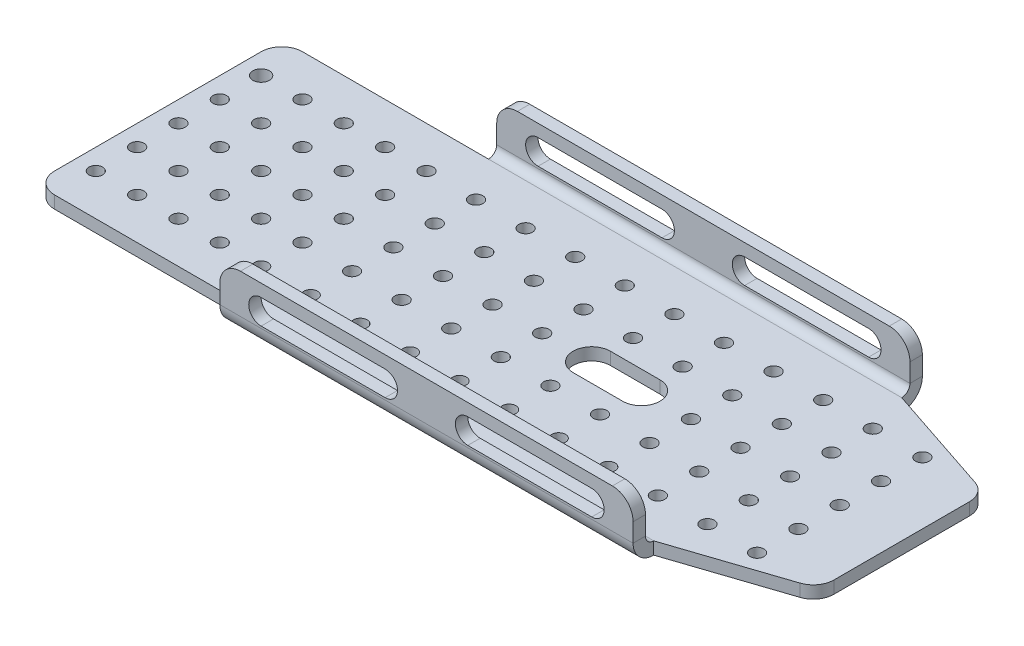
ISO-10303-21;
HEADER;
FILE_DESCRIPTION(('STEP AP214'),'2;1');
FILE_NAME('part.step','',(''),(''),'','','');
FILE_SCHEMA(('AUTOMOTIVE_DESIGN { 1 0 10303 214 1 1 1 1 }'));
ENDSEC;
DATA;
#1=APPLICATION_CONTEXT('core data for automotive mechanical design processes');
#2=APPLICATION_PROTOCOL_DEFINITION('international standard','automotive_design',2000,#1);
#3=PRODUCT_CONTEXT('',#1,'mechanical');
#4=PRODUCT('Part','Part','',(#3));
#5=PRODUCT_RELATED_PRODUCT_CATEGORY('part','',(#4));
#6=PRODUCT_DEFINITION_FORMATION('','',#4);
#7=PRODUCT_DEFINITION_CONTEXT('part definition',#1,'design');
#8=PRODUCT_DEFINITION('design','',#6,#7);
#9=PRODUCT_DEFINITION_SHAPE('','',#8);
#10=(LENGTH_UNIT() NAMED_UNIT(*) SI_UNIT(.MILLI.,.METRE.));
#11=(NAMED_UNIT(*) PLANE_ANGLE_UNIT() SI_UNIT($,.RADIAN.));
#12=(NAMED_UNIT(*) SI_UNIT($,.STERADIAN.) SOLID_ANGLE_UNIT());
#13=UNCERTAINTY_MEASURE_WITH_UNIT(LENGTH_MEASURE(1.E-05),#10,'distance_accuracy_value','');
#14=(GEOMETRIC_REPRESENTATION_CONTEXT(3) GLOBAL_UNCERTAINTY_ASSIGNED_CONTEXT((#13)) GLOBAL_UNIT_ASSIGNED_CONTEXT((#10,
#11,#12)) REPRESENTATION_CONTEXT('',''));
#15=CARTESIAN_POINT('',(0.,0.,0.));
#16=DIRECTION('',(0.,0.,1.));
#17=DIRECTION('',(1.,0.,0.));
#18=AXIS2_PLACEMENT_3D('',#15,#16,#17);
#19=CARTESIAN_POINT('',(0.,0.,0.));
#20=DIRECTION('',(0.,1.,0.));
#21=DIRECTION('',(0.,0.,1.));
#22=AXIS2_PLACEMENT_3D('',#19,#20,#21);
#23=PLANE('',#22);
#24=CARTESIAN_POINT('',(-49.9999999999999,0.,-10.));
#25=DIRECTION('',(0.,1.,0.));
#26=DIRECTION('',(0.,0.,1.));
#27=AXIS2_PLACEMENT_3D('',#24,#25,#26);
#28=CIRCLE('',#27,1.65);
#29=CARTESIAN_POINT('',(-49.9999999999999,0.,-8.35000000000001));
#30=VERTEX_POINT('',#29);
#31=EDGE_CURVE('E994',#30,#30,#28,.T.);
#32=ORIENTED_EDGE('',*,*,#31,.T.);
#33=EDGE_LOOP('',(#32));
#34=FACE_BOUND('',#33,.T.);
#35=CARTESIAN_POINT('',(54.0000000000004,0.,20.));
#36=DIRECTION('',(0.,1.,0.));
#37=DIRECTION('',(0.,0.,1.));
#38=AXIS2_PLACEMENT_3D('',#35,#36,#37);
#39=CIRCLE('',#38,1.65);
#40=CARTESIAN_POINT('',(54.0000000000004,0.,21.65));
#41=VERTEX_POINT('',#40);
#42=EDGE_CURVE('E991',#41,#41,#39,.T.);
#43=ORIENTED_EDGE('',*,*,#42,.T.);
#44=EDGE_LOOP('',(#43));
#45=FACE_BOUND('',#44,.T.);
#46=CARTESIAN_POINT('',(-30.,0.,-20.));
#47=DIRECTION('',(0.,1.,0.));
#48=DIRECTION('',(0.,0.,1.));
#49=AXIS2_PLACEMENT_3D('',#46,#47,#48);
#50=CIRCLE('',#49,1.65);
#51=CARTESIAN_POINT('',(-30.,0.,-18.35));
#52=VERTEX_POINT('',#51);
#53=EDGE_CURVE('E988',#52,#52,#50,.T.);
#54=ORIENTED_EDGE('',*,*,#53,.T.);
#55=EDGE_LOOP('',(#54));
#56=FACE_BOUND('',#55,.T.);
#57=CARTESIAN_POINT('',(-29.9999999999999,0.,-10.));
#58=DIRECTION('',(0.,1.,0.));
#59=DIRECTION('',(0.,0.,1.));
#60=AXIS2_PLACEMENT_3D('',#57,#58,#59);
#61=CIRCLE('',#60,1.65);
#62=CARTESIAN_POINT('',(-29.9999999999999,0.,-8.35000000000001));
#63=VERTEX_POINT('',#62);
#64=EDGE_CURVE('E985',#63,#63,#61,.T.);
#65=ORIENTED_EDGE('',*,*,#64,.T.);
#66=EDGE_LOOP('',(#65));
#67=FACE_BOUND('',#66,.T.);
#68=CARTESIAN_POINT('',(-50.,0.,-20.));
#69=DIRECTION('',(0.,1.,0.));
#70=DIRECTION('',(0.,0.,1.));
#71=AXIS2_PLACEMENT_3D('',#68,#69,#70);
#72=CIRCLE('',#71,1.65);
#73=CARTESIAN_POINT('',(-50.,0.,-18.35));
#74=VERTEX_POINT('',#73);
#75=EDGE_CURVE('E982',#74,#74,#72,.T.);
#76=ORIENTED_EDGE('',*,*,#75,.T.);
#77=EDGE_LOOP('',(#76));
#78=FACE_BOUND('',#77,.T.);
#79=CARTESIAN_POINT('',(42.0000000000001,0.,-10.));
#80=DIRECTION('',(0.,1.,0.));
#81=DIRECTION('',(0.,0.,1.));
#82=AXIS2_PLACEMENT_3D('',#79,#80,#81);
#83=CIRCLE('',#82,1.65);
#84=CARTESIAN_POINT('',(42.0000000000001,0.,-8.35000000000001));
#85=VERTEX_POINT('',#84);
#86=EDGE_CURVE('E979',#85,#85,#83,.T.);
#87=ORIENTED_EDGE('',*,*,#86,.T.);
#88=EDGE_LOOP('',(#87));
#89=FACE_BOUND('',#88,.T.);
#90=CARTESIAN_POINT('',(42.0000000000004,0.,20.));
#91=DIRECTION('',(0.,1.,0.));
#92=DIRECTION('',(0.,0.,1.));
#93=AXIS2_PLACEMENT_3D('',#90,#91,#92);
#94=CIRCLE('',#93,1.65);
#95=CARTESIAN_POINT('',(42.0000000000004,0.,21.65));
#96=VERTEX_POINT('',#95);
#97=EDGE_CURVE('E976',#96,#96,#94,.T.);
#98=ORIENTED_EDGE('',*,*,#97,.T.);
#99=EDGE_LOOP('',(#98));
#100=FACE_BOUND('',#99,.T.);
#101=CARTESIAN_POINT('',(54.0000000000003,0.,9.99999999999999));
#102=DIRECTION('',(0.,1.,0.));
#103=DIRECTION('',(0.,0.,1.));
#104=AXIS2_PLACEMENT_3D('',#101,#102,#103);
#105=CIRCLE('',#104,1.65);
#106=CARTESIAN_POINT('',(54.0000000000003,0.,11.65));
#107=VERTEX_POINT('',#106);
#108=EDGE_CURVE('E973',#107,#107,#105,.T.);
#109=ORIENTED_EDGE('',*,*,#108,.T.);
#110=EDGE_LOOP('',(#109));
#111=FACE_BOUND('',#110,.T.);
#112=CARTESIAN_POINT('',(-69.9999999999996,0.,20.));
#113=DIRECTION('',(0.,1.,0.));
#114=DIRECTION('',(0.,0.,1.));
#115=AXIS2_PLACEMENT_3D('',#112,#113,#114);
#116=CIRCLE('',#115,1.65);
#117=CARTESIAN_POINT('',(-69.9999999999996,0.,21.65));
#118=VERTEX_POINT('',#117);
#119=EDGE_CURVE('E970',#118,#118,#116,.T.);
#120=ORIENTED_EDGE('',*,*,#119,.T.);
#121=EDGE_LOOP('',(#120));
#122=FACE_BOUND('',#121,.T.);
#123=CARTESIAN_POINT('',(18.0000000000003,0.,9.99999999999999));
#124=DIRECTION('',(0.,1.,0.));
#125=DIRECTION('',(0.,0.,1.));
#126=AXIS2_PLACEMENT_3D('',#123,#124,#125);
#127=CIRCLE('',#126,1.65);
#128=CARTESIAN_POINT('',(18.0000000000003,0.,11.65));
#129=VERTEX_POINT('',#128);
#130=EDGE_CURVE('E967',#129,#129,#127,.T.);
#131=ORIENTED_EDGE('',*,*,#130,.T.);
#132=EDGE_LOOP('',(#131));
#133=FACE_BOUND('',#132,.T.);
#134=CARTESIAN_POINT('',(18.0000000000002,0.,0.));
#135=DIRECTION('',(0.,1.,0.));
#136=DIRECTION('',(0.,0.,1.));
#137=AXIS2_PLACEMENT_3D('',#134,#135,#136);
#138=CIRCLE('',#137,1.65);
#139=CARTESIAN_POINT('',(18.0000000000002,0.,1.64999999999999));
#140=VERTEX_POINT('',#139);
#141=EDGE_CURVE('E964',#140,#140,#138,.T.);
#142=ORIENTED_EDGE('',*,*,#141,.T.);
#143=EDGE_LOOP('',(#142));
#144=FACE_BOUND('',#143,.T.);
#145=CARTESIAN_POINT('',(6.0000000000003,0.,9.99999999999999));
#146=DIRECTION('',(0.,1.,0.));
#147=DIRECTION('',(0.,0.,1.));
#148=AXIS2_PLACEMENT_3D('',#145,#146,#147);
#149=CIRCLE('',#148,1.65);
#150=CARTESIAN_POINT('',(6.0000000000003,0.,11.65));
#151=VERTEX_POINT('',#150);
#152=EDGE_CURVE('E961',#151,#151,#149,.T.);
#153=ORIENTED_EDGE('',*,*,#152,.T.);
#154=EDGE_LOOP('',(#153));
#155=FACE_BOUND('',#154,.T.);
#156=CARTESIAN_POINT('',(-40.,0.,-20.));
#157=DIRECTION('',(0.,1.,0.));
#158=DIRECTION('',(0.,0.,1.));
#159=AXIS2_PLACEMENT_3D('',#156,#157,#158);
#160=CIRCLE('',#159,1.65);
#161=CARTESIAN_POINT('',(-40.,0.,-18.35));
#162=VERTEX_POINT('',#161);
#163=EDGE_CURVE('E958',#162,#162,#160,.T.);
#164=ORIENTED_EDGE('',*,*,#163,.T.);
#165=EDGE_LOOP('',(#164));
#166=FACE_BOUND('',#165,.T.);
#167=CARTESIAN_POINT('',(42.0000000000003,0.,9.99999999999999));
#168=DIRECTION('',(0.,1.,0.));
#169=DIRECTION('',(0.,0.,1.));
#170=AXIS2_PLACEMENT_3D('',#167,#168,#169);
#171=CIRCLE('',#170,1.65);
#172=CARTESIAN_POINT('',(42.0000000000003,0.,11.65));
#173=VERTEX_POINT('',#172);
#174=EDGE_CURVE('E955',#173,#173,#171,.T.);
#175=ORIENTED_EDGE('',*,*,#174,.T.);
#176=EDGE_LOOP('',(#175));
#177=FACE_BOUND('',#176,.T.);
#178=CARTESIAN_POINT('',(-39.9999999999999,0.,-10.));
#179=DIRECTION('',(0.,1.,0.));
#180=DIRECTION('',(0.,0.,1.));
#181=AXIS2_PLACEMENT_3D('',#178,#179,#180);
#182=CIRCLE('',#181,1.65);
#183=CARTESIAN_POINT('',(-39.9999999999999,0.,-8.35000000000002));
#184=VERTEX_POINT('',#183);
#185=EDGE_CURVE('E952',#184,#184,#182,.T.);
#186=ORIENTED_EDGE('',*,*,#185,.T.);
#187=EDGE_LOOP('',(#186));
#188=FACE_BOUND('',#187,.T.);
#189=CARTESIAN_POINT('',(30.0000000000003,0.,9.99999999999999));
#190=DIRECTION('',(0.,1.,0.));
#191=DIRECTION('',(0.,0.,1.));
#192=AXIS2_PLACEMENT_3D('',#189,#190,#191);
#193=CIRCLE('',#192,1.65);
#194=CARTESIAN_POINT('',(30.0000000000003,0.,11.65));
#195=VERTEX_POINT('',#194);
#196=EDGE_CURVE('E949',#195,#195,#193,.T.);
#197=ORIENTED_EDGE('',*,*,#196,.T.);
#198=EDGE_LOOP('',(#197));
#199=FACE_BOUND('',#198,.T.);
#200=CARTESIAN_POINT('',(18.0000000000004,0.,20.));
#201=DIRECTION('',(0.,1.,0.));
#202=DIRECTION('',(0.,0.,1.));
#203=AXIS2_PLACEMENT_3D('',#200,#201,#202);
#204=CIRCLE('',#203,1.65);
#205=CARTESIAN_POINT('',(18.0000000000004,0.,21.65));
#206=VERTEX_POINT('',#205);
#207=EDGE_CURVE('E946',#206,#206,#204,.T.);
#208=ORIENTED_EDGE('',*,*,#207,.T.);
#209=EDGE_LOOP('',(#208));
#210=FACE_BOUND('',#209,.T.);
#211=CARTESIAN_POINT('',(30.0000000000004,0.,20.));
#212=DIRECTION('',(0.,1.,0.));
#213=DIRECTION('',(0.,0.,1.));
#214=AXIS2_PLACEMENT_3D('',#211,#212,#213);
#215=CIRCLE('',#214,1.65);
#216=CARTESIAN_POINT('',(30.0000000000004,0.,21.65));
#217=VERTEX_POINT('',#216);
#218=EDGE_CURVE('E943',#217,#217,#215,.T.);
#219=ORIENTED_EDGE('',*,*,#218,.T.);
#220=EDGE_LOOP('',(#219));
#221=FACE_BOUND('',#220,.T.);
#222=CARTESIAN_POINT('',(-5.99999999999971,0.,9.99999999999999));
#223=DIRECTION('',(0.,1.,0.));
#224=DIRECTION('',(0.,0.,1.));
#225=AXIS2_PLACEMENT_3D('',#222,#223,#224);
#226=CIRCLE('',#225,1.65);
#227=CARTESIAN_POINT('',(-5.99999999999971,0.,11.65));
#228=VERTEX_POINT('',#227);
#229=EDGE_CURVE('E940',#228,#228,#226,.T.);
#230=ORIENTED_EDGE('',*,*,#229,.T.);
#231=EDGE_LOOP('',(#230));
#232=FACE_BOUND('',#231,.T.);
#233=CARTESIAN_POINT('',(54.0000000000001,0.,-10.));
#234=DIRECTION('',(0.,1.,0.));
#235=DIRECTION('',(0.,0.,1.));
#236=AXIS2_PLACEMENT_3D('',#233,#234,#235);
#237=CIRCLE('',#236,1.65);
#238=CARTESIAN_POINT('',(54.0000000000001,0.,-8.35000000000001));
#239=VERTEX_POINT('',#238);
#240=EDGE_CURVE('E937',#239,#239,#237,.T.);
#241=ORIENTED_EDGE('',*,*,#240,.T.);
#242=EDGE_LOOP('',(#241));
#243=FACE_BOUND('',#242,.T.);
#244=CARTESIAN_POINT('',(54.0000000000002,0.,0.));
#245=DIRECTION('',(0.,1.,0.));
#246=DIRECTION('',(0.,0.,1.));
#247=AXIS2_PLACEMENT_3D('',#244,#245,#246);
#248=CIRCLE('',#247,1.65);
#249=CARTESIAN_POINT('',(54.0000000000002,0.,1.64999999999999));
#250=VERTEX_POINT('',#249);
#251=EDGE_CURVE('E934',#250,#250,#248,.T.);
#252=ORIENTED_EDGE('',*,*,#251,.T.);
#253=EDGE_LOOP('',(#252));
#254=FACE_BOUND('',#253,.T.);
#255=CARTESIAN_POINT('',(30.0000000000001,0.,-10.));
#256=DIRECTION('',(0.,1.,0.));
#257=DIRECTION('',(0.,0.,1.));
#258=AXIS2_PLACEMENT_3D('',#255,#256,#257);
#259=CIRCLE('',#258,1.65);
#260=CARTESIAN_POINT('',(30.0000000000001,0.,-8.35000000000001));
#261=VERTEX_POINT('',#260);
#262=EDGE_CURVE('E931',#261,#261,#259,.T.);
#263=ORIENTED_EDGE('',*,*,#262,.T.);
#264=EDGE_LOOP('',(#263));
#265=FACE_BOUND('',#264,.T.);
#266=CARTESIAN_POINT('',(-5.99999999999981,0.,0.));
#267=DIRECTION('',(0.,1.,0.));
#268=DIRECTION('',(0.,0.,1.));
#269=AXIS2_PLACEMENT_3D('',#266,#267,#268);
#270=CIRCLE('',#269,1.65);
#271=CARTESIAN_POINT('',(-5.99999999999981,0.,1.64999999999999));
#272=VERTEX_POINT('',#271);
#273=EDGE_CURVE('E928',#272,#272,#270,.T.);
#274=ORIENTED_EDGE('',*,*,#273,.T.);
#275=EDGE_LOOP('',(#274));
#276=FACE_BOUND('',#275,.T.);
#277=CARTESIAN_POINT('',(6.00000000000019,0.,0.));
#278=DIRECTION('',(0.,1.,0.));
#279=DIRECTION('',(0.,0.,1.));
#280=AXIS2_PLACEMENT_3D('',#277,#278,#279);
#281=CIRCLE('',#280,1.65);
#282=CARTESIAN_POINT('',(6.00000000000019,0.,1.64999999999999));
#283=VERTEX_POINT('',#282);
#284=EDGE_CURVE('E925',#283,#283,#281,.T.);
#285=ORIENTED_EDGE('',*,*,#284,.T.);
#286=EDGE_LOOP('',(#285));
#287=FACE_BOUND('',#286,.T.);
#288=CARTESIAN_POINT('',(-5.9999999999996,0.,20.));
#289=DIRECTION('',(0.,1.,0.));
#290=DIRECTION('',(0.,0.,1.));
#291=AXIS2_PLACEMENT_3D('',#288,#289,#290);
#292=CIRCLE('',#291,1.65);
#293=CARTESIAN_POINT('',(-5.9999999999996,0.,21.65));
#294=VERTEX_POINT('',#293);
#295=EDGE_CURVE('E922',#294,#294,#292,.T.);
#296=ORIENTED_EDGE('',*,*,#295,.T.);
#297=EDGE_LOOP('',(#296));
#298=FACE_BOUND('',#297,.T.);
#299=CARTESIAN_POINT('',(-39.9999999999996,0.,20.));
#300=DIRECTION('',(0.,1.,0.));
#301=DIRECTION('',(0.,0.,1.));
#302=AXIS2_PLACEMENT_3D('',#299,#300,#301);
#303=CIRCLE('',#302,1.65);
#304=CARTESIAN_POINT('',(-39.9999999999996,0.,21.65));
#305=VERTEX_POINT('',#304);
#306=EDGE_CURVE('E919',#305,#305,#303,.T.);
#307=ORIENTED_EDGE('',*,*,#306,.T.);
#308=EDGE_LOOP('',(#307));
#309=FACE_BOUND('',#308,.T.);
#310=CARTESIAN_POINT('',(-49.9999999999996,0.,20.));
#311=DIRECTION('',(0.,1.,0.));
#312=DIRECTION('',(0.,0.,1.));
#313=AXIS2_PLACEMENT_3D('',#310,#311,#312);
#314=CIRCLE('',#313,1.65);
#315=CARTESIAN_POINT('',(-49.9999999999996,0.,21.65));
#316=VERTEX_POINT('',#315);
#317=EDGE_CURVE('E916',#316,#316,#314,.T.);
#318=ORIENTED_EDGE('',*,*,#317,.T.);
#319=EDGE_LOOP('',(#318));
#320=FACE_BOUND('',#319,.T.);
#321=CARTESIAN_POINT('',(-29.9999999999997,0.,9.99999999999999));
#322=DIRECTION('',(0.,1.,0.));
#323=DIRECTION('',(0.,0.,1.));
#324=AXIS2_PLACEMENT_3D('',#321,#322,#323);
#325=CIRCLE('',#324,1.65);
#326=CARTESIAN_POINT('',(-29.9999999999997,0.,11.65));
#327=VERTEX_POINT('',#326);
#328=EDGE_CURVE('E913',#327,#327,#325,.T.);
#329=ORIENTED_EDGE('',*,*,#328,.T.);
#330=EDGE_LOOP('',(#329));
#331=FACE_BOUND('',#330,.T.);
#332=CARTESIAN_POINT('',(-29.9999999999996,0.,20.));
#333=DIRECTION('',(0.,1.,0.));
#334=DIRECTION('',(0.,0.,1.));
#335=AXIS2_PLACEMENT_3D('',#332,#333,#334);
#336=CIRCLE('',#335,1.65);
#337=CARTESIAN_POINT('',(-29.9999999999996,0.,21.65));
#338=VERTEX_POINT('',#337);
#339=EDGE_CURVE('E910',#338,#338,#336,.T.);
#340=ORIENTED_EDGE('',*,*,#339,.T.);
#341=EDGE_LOOP('',(#340));
#342=FACE_BOUND('',#341,.T.);
#343=CARTESIAN_POINT('',(-17.9999999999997,0.,9.99999999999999));
#344=DIRECTION('',(0.,1.,0.));
#345=DIRECTION('',(0.,0.,1.));
#346=AXIS2_PLACEMENT_3D('',#343,#344,#345);
#347=CIRCLE('',#346,1.65);
#348=CARTESIAN_POINT('',(-17.9999999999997,0.,11.65));
#349=VERTEX_POINT('',#348);
#350=EDGE_CURVE('E907',#349,#349,#347,.T.);
#351=ORIENTED_EDGE('',*,*,#350,.T.);
#352=EDGE_LOOP('',(#351));
#353=FACE_BOUND('',#352,.T.);
#354=CARTESIAN_POINT('',(-17.9999999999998,0.,0.));
#355=DIRECTION('',(0.,1.,0.));
#356=DIRECTION('',(0.,0.,1.));
#357=AXIS2_PLACEMENT_3D('',#354,#355,#356);
#358=CIRCLE('',#357,1.65);
#359=CARTESIAN_POINT('',(-17.9999999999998,0.,1.64999999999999));
#360=VERTEX_POINT('',#359);
#361=EDGE_CURVE('E904',#360,#360,#358,.T.);
#362=ORIENTED_EDGE('',*,*,#361,.T.);
#363=EDGE_LOOP('',(#362));
#364=FACE_BOUND('',#363,.T.);
#365=CARTESIAN_POINT('',(-59.9999999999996,0.,20.));
#366=DIRECTION('',(0.,1.,0.));
#367=DIRECTION('',(0.,0.,1.));
#368=AXIS2_PLACEMENT_3D('',#365,#366,#367);
#369=CIRCLE('',#368,1.65);
#370=CARTESIAN_POINT('',(-59.9999999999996,0.,21.65));
#371=VERTEX_POINT('',#370);
#372=EDGE_CURVE('E901',#371,#371,#369,.T.);
#373=ORIENTED_EDGE('',*,*,#372,.T.);
#374=EDGE_LOOP('',(#373));
#375=FACE_BOUND('',#374,.T.);
#376=CARTESIAN_POINT('',(-17.9999999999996,0.,20.));
#377=DIRECTION('',(0.,1.,0.));
#378=DIRECTION('',(0.,0.,1.));
#379=AXIS2_PLACEMENT_3D('',#376,#377,#378);
#380=CIRCLE('',#379,1.65);
#381=CARTESIAN_POINT('',(-17.9999999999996,0.,21.65));
#382=VERTEX_POINT('',#381);
#383=EDGE_CURVE('E898',#382,#382,#380,.T.);
#384=ORIENTED_EDGE('',*,*,#383,.T.);
#385=EDGE_LOOP('',(#384));
#386=FACE_BOUND('',#385,.T.);
#387=CARTESIAN_POINT('',(-6.00000000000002,0.,-20.));
#388=DIRECTION('',(0.,1.,0.));
#389=DIRECTION('',(0.,0.,1.));
#390=AXIS2_PLACEMENT_3D('',#387,#388,#389);
#391=CIRCLE('',#390,1.65);
#392=CARTESIAN_POINT('',(-6.00000000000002,0.,-18.35));
#393=VERTEX_POINT('',#392);
#394=EDGE_CURVE('E895',#393,#393,#391,.T.);
#395=ORIENTED_EDGE('',*,*,#394,.T.);
#396=EDGE_LOOP('',(#395));
#397=FACE_BOUND('',#396,.T.);
#398=CARTESIAN_POINT('',(5.99999999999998,0.,-20.));
#399=DIRECTION('',(0.,1.,0.));
#400=DIRECTION('',(0.,0.,1.));
#401=AXIS2_PLACEMENT_3D('',#398,#399,#400);
#402=CIRCLE('',#401,1.65);
#403=CARTESIAN_POINT('',(5.99999999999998,0.,-18.35));
#404=VERTEX_POINT('',#403);
#405=EDGE_CURVE('E892',#404,#404,#402,.T.);
#406=ORIENTED_EDGE('',*,*,#405,.T.);
#407=EDGE_LOOP('',(#406));
#408=FACE_BOUND('',#407,.T.);
#409=CARTESIAN_POINT('',(-17.9999999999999,0.,-10.));
#410=DIRECTION('',(0.,1.,0.));
#411=DIRECTION('',(0.,0.,1.));
#412=AXIS2_PLACEMENT_3D('',#409,#410,#411);
#413=CIRCLE('',#412,1.65);
#414=CARTESIAN_POINT('',(-17.9999999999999,0.,-8.35000000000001));
#415=VERTEX_POINT('',#414);
#416=EDGE_CURVE('E889',#415,#415,#413,.T.);
#417=ORIENTED_EDGE('',*,*,#416,.T.);
#418=EDGE_LOOP('',(#417));
#419=FACE_BOUND('',#418,.T.);
#420=CARTESIAN_POINT('',(-18.,0.,-20.));
#421=DIRECTION('',(0.,1.,0.));
#422=DIRECTION('',(0.,0.,1.));
#423=AXIS2_PLACEMENT_3D('',#420,#421,#422);
#424=CIRCLE('',#423,1.65);
#425=CARTESIAN_POINT('',(-18.,0.,-18.35));
#426=VERTEX_POINT('',#425);
#427=EDGE_CURVE('E886',#426,#426,#424,.T.);
#428=ORIENTED_EDGE('',*,*,#427,.T.);
#429=EDGE_LOOP('',(#428));
#430=FACE_BOUND('',#429,.T.);
#431=CARTESIAN_POINT('',(-5.99999999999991,0.,-10.));
#432=DIRECTION('',(0.,1.,0.));
#433=DIRECTION('',(0.,0.,1.));
#434=AXIS2_PLACEMENT_3D('',#431,#432,#433);
#435=CIRCLE('',#434,1.65);
#436=CARTESIAN_POINT('',(-5.99999999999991,0.,-8.35000000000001));
#437=VERTEX_POINT('',#436);
#438=EDGE_CURVE('E883',#437,#437,#435,.T.);
#439=ORIENTED_EDGE('',*,*,#438,.T.);
#440=EDGE_LOOP('',(#439));
#441=FACE_BOUND('',#440,.T.);
#442=CARTESIAN_POINT('',(18.,0.,-20.));
#443=DIRECTION('',(0.,1.,0.));
#444=DIRECTION('',(0.,0.,1.));
#445=AXIS2_PLACEMENT_3D('',#442,#443,#444);
#446=CIRCLE('',#445,1.65);
#447=CARTESIAN_POINT('',(18.,0.,-18.35));
#448=VERTEX_POINT('',#447);
#449=EDGE_CURVE('E880',#448,#448,#446,.T.);
#450=ORIENTED_EDGE('',*,*,#449,.T.);
#451=EDGE_LOOP('',(#450));
#452=FACE_BOUND('',#451,.T.);
#453=CARTESIAN_POINT('',(18.0000000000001,0.,-10.));
#454=DIRECTION('',(0.,1.,0.));
#455=DIRECTION('',(0.,0.,1.));
#456=AXIS2_PLACEMENT_3D('',#453,#454,#455);
#457=CIRCLE('',#456,1.65);
#458=CARTESIAN_POINT('',(18.0000000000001,0.,-8.35000000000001));
#459=VERTEX_POINT('',#458);
#460=EDGE_CURVE('E877',#459,#459,#457,.T.);
#461=ORIENTED_EDGE('',*,*,#460,.T.);
#462=EDGE_LOOP('',(#461));
#463=FACE_BOUND('',#462,.T.);
#464=CARTESIAN_POINT('',(6.00000000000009,0.,-10.));
#465=DIRECTION('',(0.,1.,0.));
#466=DIRECTION('',(0.,0.,1.));
#467=AXIS2_PLACEMENT_3D('',#464,#465,#466);
#468=CIRCLE('',#467,1.65);
#469=CARTESIAN_POINT('',(6.00000000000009,0.,-8.35000000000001));
#470=VERTEX_POINT('',#469);
#471=EDGE_CURVE('E874',#470,#470,#468,.T.);
#472=ORIENTED_EDGE('',*,*,#471,.T.);
#473=EDGE_LOOP('',(#472));
#474=FACE_BOUND('',#473,.T.);
#475=CARTESIAN_POINT('',(42.,0.,-20.));
#476=DIRECTION('',(0.,1.,0.));
#477=DIRECTION('',(0.,0.,1.));
#478=AXIS2_PLACEMENT_3D('',#475,#476,#477);
#479=CIRCLE('',#478,1.65);
#480=CARTESIAN_POINT('',(42.,0.,-18.35));
#481=VERTEX_POINT('',#480);
#482=EDGE_CURVE('E871',#481,#481,#479,.T.);
#483=ORIENTED_EDGE('',*,*,#482,.T.);
#484=EDGE_LOOP('',(#483));
#485=FACE_BOUND('',#484,.T.);
#486=CARTESIAN_POINT('',(-59.9999999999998,0.,0.));
#487=DIRECTION('',(0.,1.,0.));
#488=DIRECTION('',(0.,0.,1.));
#489=AXIS2_PLACEMENT_3D('',#486,#487,#488);
#490=CIRCLE('',#489,1.65);
#491=CARTESIAN_POINT('',(-59.9999999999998,0.,1.64999999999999));
#492=VERTEX_POINT('',#491);
#493=EDGE_CURVE('E868',#492,#492,#490,.T.);
#494=ORIENTED_EDGE('',*,*,#493,.T.);
#495=EDGE_LOOP('',(#494));
#496=FACE_BOUND('',#495,.T.);
#497=CARTESIAN_POINT('',(-69.9999999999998,0.,0.));
#498=DIRECTION('',(0.,1.,0.));
#499=DIRECTION('',(0.,0.,1.));
#500=AXIS2_PLACEMENT_3D('',#497,#498,#499);
#501=CIRCLE('',#500,1.65);
#502=CARTESIAN_POINT('',(-69.9999999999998,0.,1.64999999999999));
#503=VERTEX_POINT('',#502);
#504=EDGE_CURVE('E865',#503,#503,#501,.T.);
#505=ORIENTED_EDGE('',*,*,#504,.T.);
#506=EDGE_LOOP('',(#505));
#507=FACE_BOUND('',#506,.T.);
#508=CARTESIAN_POINT('',(-39.9999999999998,0.,0.));
#509=DIRECTION('',(0.,1.,0.));
#510=DIRECTION('',(0.,0.,1.));
#511=AXIS2_PLACEMENT_3D('',#508,#509,#510);
#512=CIRCLE('',#511,1.65);
#513=CARTESIAN_POINT('',(-39.9999999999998,0.,1.64999999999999));
#514=VERTEX_POINT('',#513);
#515=EDGE_CURVE('E862',#514,#514,#512,.T.);
#516=ORIENTED_EDGE('',*,*,#515,.T.);
#517=EDGE_LOOP('',(#516));
#518=FACE_BOUND('',#517,.T.);
#519=CARTESIAN_POINT('',(6.0000000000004,0.,20.));
#520=DIRECTION('',(0.,1.,0.));
#521=DIRECTION('',(0.,0.,1.));
#522=AXIS2_PLACEMENT_3D('',#519,#520,#521);
#523=CIRCLE('',#522,1.65);
#524=CARTESIAN_POINT('',(6.0000000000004,0.,21.65));
#525=VERTEX_POINT('',#524);
#526=EDGE_CURVE('E859',#525,#525,#523,.T.);
#527=ORIENTED_EDGE('',*,*,#526,.T.);
#528=EDGE_LOOP('',(#527));
#529=FACE_BOUND('',#528,.T.);
#530=CARTESIAN_POINT('',(54.,0.,-20.));
#531=DIRECTION('',(0.,1.,0.));
#532=DIRECTION('',(0.,0.,1.));
#533=AXIS2_PLACEMENT_3D('',#530,#531,#532);
#534=CIRCLE('',#533,1.65);
#535=CARTESIAN_POINT('',(54.,0.,-18.35));
#536=VERTEX_POINT('',#535);
#537=EDGE_CURVE('E856',#536,#536,#534,.T.);
#538=ORIENTED_EDGE('',*,*,#537,.T.);
#539=EDGE_LOOP('',(#538));
#540=FACE_BOUND('',#539,.T.);
#541=CARTESIAN_POINT('',(-60.,0.,-20.));
#542=DIRECTION('',(0.,1.,0.));
#543=DIRECTION('',(0.,0.,1.));
#544=AXIS2_PLACEMENT_3D('',#541,#542,#543);
#545=CIRCLE('',#544,1.65);
#546=CARTESIAN_POINT('',(-60.,0.,-18.35));
#547=VERTEX_POINT('',#546);
#548=EDGE_CURVE('E853',#547,#547,#545,.T.);
#549=ORIENTED_EDGE('',*,*,#548,.T.);
#550=EDGE_LOOP('',(#549));
#551=FACE_BOUND('',#550,.T.);
#552=CARTESIAN_POINT('',(30.,0.,-20.));
#553=DIRECTION('',(0.,1.,0.));
#554=DIRECTION('',(0.,0.,1.));
#555=AXIS2_PLACEMENT_3D('',#552,#553,#554);
#556=CIRCLE('',#555,1.65);
#557=CARTESIAN_POINT('',(30.,0.,-18.35));
#558=VERTEX_POINT('',#557);
#559=EDGE_CURVE('E850',#558,#558,#556,.T.);
#560=ORIENTED_EDGE('',*,*,#559,.T.);
#561=EDGE_LOOP('',(#560));
#562=FACE_BOUND('',#561,.T.);
#563=CARTESIAN_POINT('',(-59.9999999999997,0.,9.99999999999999));
#564=DIRECTION('',(0.,1.,0.));
#565=DIRECTION('',(0.,0.,1.));
#566=AXIS2_PLACEMENT_3D('',#563,#564,#565);
#567=CIRCLE('',#566,1.65);
#568=CARTESIAN_POINT('',(-59.9999999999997,0.,11.65));
#569=VERTEX_POINT('',#568);
#570=EDGE_CURVE('E847',#569,#569,#567,.T.);
#571=ORIENTED_EDGE('',*,*,#570,.T.);
#572=EDGE_LOOP('',(#571));
#573=FACE_BOUND('',#572,.T.);
#574=CARTESIAN_POINT('',(-69.9999999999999,0.,-10.));
#575=DIRECTION('',(0.,1.,0.));
#576=DIRECTION('',(0.,0.,1.));
#577=AXIS2_PLACEMENT_3D('',#574,#575,#576);
#578=CIRCLE('',#577,1.65);
#579=CARTESIAN_POINT('',(-69.9999999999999,0.,-8.35000000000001));
#580=VERTEX_POINT('',#579);
#581=EDGE_CURVE('E844',#580,#580,#578,.T.);
#582=ORIENTED_EDGE('',*,*,#581,.T.);
#583=EDGE_LOOP('',(#582));
#584=FACE_BOUND('',#583,.T.);
#585=CARTESIAN_POINT('',(-29.9999999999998,0.,0.));
#586=DIRECTION('',(0.,1.,0.));
#587=DIRECTION('',(0.,0.,1.));
#588=AXIS2_PLACEMENT_3D('',#585,#586,#587);
#589=CIRCLE('',#588,1.65);
#590=CARTESIAN_POINT('',(-29.9999999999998,0.,1.64999999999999));
#591=VERTEX_POINT('',#590);
#592=EDGE_CURVE('E841',#591,#591,#589,.T.);
#593=ORIENTED_EDGE('',*,*,#592,.T.);
#594=EDGE_LOOP('',(#593));
#595=FACE_BOUND('',#594,.T.);
#596=CARTESIAN_POINT('',(-59.9999999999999,0.,-10.));
#597=DIRECTION('',(0.,1.,0.));
#598=DIRECTION('',(0.,0.,1.));
#599=AXIS2_PLACEMENT_3D('',#596,#597,#598);
#600=CIRCLE('',#599,1.65);
#601=CARTESIAN_POINT('',(-59.9999999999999,0.,-8.35000000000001));
#602=VERTEX_POINT('',#601);
#603=EDGE_CURVE('E838',#602,#602,#600,.T.);
#604=ORIENTED_EDGE('',*,*,#603,.T.);
#605=EDGE_LOOP('',(#604));
#606=FACE_BOUND('',#605,.T.);
#607=CARTESIAN_POINT('',(-49.9999999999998,0.,0.));
#608=DIRECTION('',(0.,1.,0.));
#609=DIRECTION('',(0.,0.,1.));
#610=AXIS2_PLACEMENT_3D('',#607,#608,#609);
#611=CIRCLE('',#610,1.65);
#612=CARTESIAN_POINT('',(-49.9999999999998,0.,1.64999999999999));
#613=VERTEX_POINT('',#612);
#614=EDGE_CURVE('E835',#613,#613,#611,.T.);
#615=ORIENTED_EDGE('',*,*,#614,.T.);
#616=EDGE_LOOP('',(#615));
#617=FACE_BOUND('',#616,.T.);
#618=CARTESIAN_POINT('',(-49.9999999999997,0.,9.99999999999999));
#619=DIRECTION('',(0.,1.,0.));
#620=DIRECTION('',(0.,0.,1.));
#621=AXIS2_PLACEMENT_3D('',#618,#619,#620);
#622=CIRCLE('',#621,1.65);
#623=CARTESIAN_POINT('',(-49.9999999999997,0.,11.65));
#624=VERTEX_POINT('',#623);
#625=EDGE_CURVE('E832',#624,#624,#622,.T.);
#626=ORIENTED_EDGE('',*,*,#625,.T.);
#627=EDGE_LOOP('',(#626));
#628=FACE_BOUND('',#627,.T.);
#629=CARTESIAN_POINT('',(-39.9999999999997,0.,9.99999999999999));
#630=DIRECTION('',(0.,1.,0.));
#631=DIRECTION('',(0.,0.,1.));
#632=AXIS2_PLACEMENT_3D('',#629,#630,#631);
#633=CIRCLE('',#632,1.65);
#634=CARTESIAN_POINT('',(-39.9999999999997,0.,11.65));
#635=VERTEX_POINT('',#634);
#636=EDGE_CURVE('E829',#635,#635,#633,.T.);
#637=ORIENTED_EDGE('',*,*,#636,.T.);
#638=EDGE_LOOP('',(#637));
#639=FACE_BOUND('',#638,.T.);
#640=CARTESIAN_POINT('',(-69.9999999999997,0.,9.99999999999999));
#641=DIRECTION('',(0.,1.,0.));
#642=DIRECTION('',(0.,0.,1.));
#643=AXIS2_PLACEMENT_3D('',#640,#641,#642);
#644=CIRCLE('',#643,1.65);
#645=CARTESIAN_POINT('',(-69.9999999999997,0.,11.65));
#646=VERTEX_POINT('',#645);
#647=EDGE_CURVE('E826',#646,#646,#644,.T.);
#648=ORIENTED_EDGE('',*,*,#647,.T.);
#649=EDGE_LOOP('',(#648));
#650=FACE_BOUND('',#649,.T.);
#651=CARTESIAN_POINT('',(-70.,0.,-20.));
#652=DIRECTION('',(0.,1.,0.));
#653=DIRECTION('',(0.,0.,1.));
#654=AXIS2_PLACEMENT_3D('',#651,#652,#653);
#655=CIRCLE('',#654,2.);
#656=CARTESIAN_POINT('',(-70.,0.,-18.));
#657=VERTEX_POINT('',#656);
#658=EDGE_CURVE('E823',#657,#657,#655,.T.);
#659=ORIENTED_EDGE('',*,*,#658,.T.);
#660=EDGE_LOOP('',(#659));
#661=FACE_BOUND('',#660,.T.);
#662=CARTESIAN_POINT('',(78.0000000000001,0.,-20.));
#663=DIRECTION('',(0.,1.,0.));
#664=DIRECTION('',(0.,0.,1.));
#665=AXIS2_PLACEMENT_3D('',#662,#663,#664);
#666=CIRCLE('',#665,1.65);
#667=CARTESIAN_POINT('',(78.0000000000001,0.,-18.35));
#668=VERTEX_POINT('',#667);
#669=EDGE_CURVE('E820',#668,#668,#666,.T.);
#670=ORIENTED_EDGE('',*,*,#669,.T.);
#671=EDGE_LOOP('',(#670));
#672=FACE_BOUND('',#671,.T.);
#673=CARTESIAN_POINT('',(78.0000000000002,0.,0.));
#674=DIRECTION('',(0.,1.,0.));
#675=DIRECTION('',(0.,0.,1.));
#676=AXIS2_PLACEMENT_3D('',#673,#674,#675);
#677=CIRCLE('',#676,1.65);
#678=CARTESIAN_POINT('',(78.0000000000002,0.,1.65));
#679=VERTEX_POINT('',#678);
#680=EDGE_CURVE('E817',#679,#679,#677,.T.);
#681=ORIENTED_EDGE('',*,*,#680,.T.);
#682=EDGE_LOOP('',(#681));
#683=FACE_BOUND('',#682,.T.);
#684=CARTESIAN_POINT('',(66.0000000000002,0.,0.));
#685=DIRECTION('',(0.,1.,0.));
#686=DIRECTION('',(0.,0.,1.));
#687=AXIS2_PLACEMENT_3D('',#684,#685,#686);
#688=CIRCLE('',#687,1.65);
#689=CARTESIAN_POINT('',(66.0000000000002,0.,1.65));
#690=VERTEX_POINT('',#689);
#691=EDGE_CURVE('E814',#690,#690,#688,.T.);
#692=ORIENTED_EDGE('',*,*,#691,.T.);
#693=EDGE_LOOP('',(#692));
#694=FACE_BOUND('',#693,.T.);
#695=CARTESIAN_POINT('',(66.0000000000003,0.,10.));
#696=DIRECTION('',(0.,1.,0.));
#697=DIRECTION('',(0.,0.,1.));
#698=AXIS2_PLACEMENT_3D('',#695,#696,#697);
#699=CIRCLE('',#698,1.65);
#700=CARTESIAN_POINT('',(66.0000000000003,0.,11.65));
#701=VERTEX_POINT('',#700);
#702=EDGE_CURVE('E811',#701,#701,#699,.T.);
#703=ORIENTED_EDGE('',*,*,#702,.T.);
#704=EDGE_LOOP('',(#703));
#705=FACE_BOUND('',#704,.T.);
#706=CARTESIAN_POINT('',(66.0000000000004,0.,20.));
#707=DIRECTION('',(0.,1.,0.));
#708=DIRECTION('',(0.,0.,1.));
#709=AXIS2_PLACEMENT_3D('',#706,#707,#708);
#710=CIRCLE('',#709,1.65);
#711=CARTESIAN_POINT('',(66.0000000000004,0.,21.65));
#712=VERTEX_POINT('',#711);
#713=EDGE_CURVE('E808',#712,#712,#710,.T.);
#714=ORIENTED_EDGE('',*,*,#713,.T.);
#715=EDGE_LOOP('',(#714));
#716=FACE_BOUND('',#715,.T.);
#717=CARTESIAN_POINT('',(78.0000000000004,0.,20.));
#718=DIRECTION('',(0.,1.,0.));
#719=DIRECTION('',(0.,0.,1.));
#720=AXIS2_PLACEMENT_3D('',#717,#718,#719);
#721=CIRCLE('',#720,1.65);
#722=CARTESIAN_POINT('',(78.0000000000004,0.,21.65));
#723=VERTEX_POINT('',#722);
#724=EDGE_CURVE('E805',#723,#723,#721,.T.);
#725=ORIENTED_EDGE('',*,*,#724,.T.);
#726=EDGE_LOOP('',(#725));
#727=FACE_BOUND('',#726,.T.);
#728=CARTESIAN_POINT('',(78.0000000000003,0.,10.));
#729=DIRECTION('',(0.,1.,0.));
#730=DIRECTION('',(0.,0.,1.));
#731=AXIS2_PLACEMENT_3D('',#728,#729,#730);
#732=CIRCLE('',#731,1.65);
#733=CARTESIAN_POINT('',(78.0000000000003,0.,11.65));
#734=VERTEX_POINT('',#733);
#735=EDGE_CURVE('E802',#734,#734,#732,.T.);
#736=ORIENTED_EDGE('',*,*,#735,.T.);
#737=EDGE_LOOP('',(#736));
#738=FACE_BOUND('',#737,.T.);
#739=CARTESIAN_POINT('',(90.0000000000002,0.,-10.));
#740=DIRECTION('',(0.,1.,0.));
#741=DIRECTION('',(0.,0.,1.));
#742=AXIS2_PLACEMENT_3D('',#739,#740,#741);
#743=CIRCLE('',#742,1.65);
#744=CARTESIAN_POINT('',(90.0000000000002,0.,-8.35));
#745=VERTEX_POINT('',#744);
#746=EDGE_CURVE('E799',#745,#745,#743,.T.);
#747=ORIENTED_EDGE('',*,*,#746,.T.);
#748=EDGE_LOOP('',(#747));
#749=FACE_BOUND('',#748,.T.);
#750=CARTESIAN_POINT('',(78.0000000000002,0.,-10.));
#751=DIRECTION('',(0.,1.,0.));
#752=DIRECTION('',(0.,0.,1.));
#753=AXIS2_PLACEMENT_3D('',#750,#751,#752);
#754=CIRCLE('',#753,1.65);
#755=CARTESIAN_POINT('',(78.0000000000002,0.,-8.35));
#756=VERTEX_POINT('',#755);
#757=EDGE_CURVE('E796',#756,#756,#754,.T.);
#758=ORIENTED_EDGE('',*,*,#757,.T.);
#759=EDGE_LOOP('',(#758));
#760=FACE_BOUND('',#759,.T.);
#761=CARTESIAN_POINT('',(66.0000000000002,0.,-10.));
#762=DIRECTION('',(0.,1.,0.));
#763=DIRECTION('',(0.,0.,1.));
#764=AXIS2_PLACEMENT_3D('',#761,#762,#763);
#765=CIRCLE('',#764,1.65);
#766=CARTESIAN_POINT('',(66.0000000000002,0.,-8.35));
#767=VERTEX_POINT('',#766);
#768=EDGE_CURVE('E793',#767,#767,#765,.T.);
#769=ORIENTED_EDGE('',*,*,#768,.T.);
#770=EDGE_LOOP('',(#769));
#771=FACE_BOUND('',#770,.T.);
#772=CARTESIAN_POINT('',(90.0000000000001,0.,-20.));
#773=DIRECTION('',(0.,1.,0.));
#774=DIRECTION('',(0.,0.,1.));
#775=AXIS2_PLACEMENT_3D('',#772,#773,#774);
#776=CIRCLE('',#775,1.65);
#777=CARTESIAN_POINT('',(90.0000000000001,0.,-18.35));
#778=VERTEX_POINT('',#777);
#779=EDGE_CURVE('E790',#778,#778,#776,.T.);
#780=ORIENTED_EDGE('',*,*,#779,.T.);
#781=EDGE_LOOP('',(#780));
#782=FACE_BOUND('',#781,.T.);
#783=CARTESIAN_POINT('',(90.0000000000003,0.,10.));
#784=DIRECTION('',(0.,1.,0.));
#785=DIRECTION('',(0.,0.,1.));
#786=AXIS2_PLACEMENT_3D('',#783,#784,#785);
#787=CIRCLE('',#786,1.65);
#788=CARTESIAN_POINT('',(90.0000000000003,0.,11.65));
#789=VERTEX_POINT('',#788);
#790=EDGE_CURVE('E787',#789,#789,#787,.T.);
#791=ORIENTED_EDGE('',*,*,#790,.T.);
#792=EDGE_LOOP('',(#791));
#793=FACE_BOUND('',#792,.T.);
#794=CARTESIAN_POINT('',(90.0000000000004,0.,20.));
#795=DIRECTION('',(0.,1.,0.));
#796=DIRECTION('',(0.,0.,1.));
#797=AXIS2_PLACEMENT_3D('',#794,#795,#796);
#798=CIRCLE('',#797,1.65);
#799=CARTESIAN_POINT('',(90.0000000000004,0.,21.65));
#800=VERTEX_POINT('',#799);
#801=EDGE_CURVE('E784',#800,#800,#798,.T.);
#802=ORIENTED_EDGE('',*,*,#801,.T.);
#803=EDGE_LOOP('',(#802));
#804=FACE_BOUND('',#803,.T.);
#805=CARTESIAN_POINT('',(66.0000000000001,0.,-20.));
#806=DIRECTION('',(0.,1.,0.));
#807=DIRECTION('',(0.,0.,1.));
#808=AXIS2_PLACEMENT_3D('',#805,#806,#807);
#809=CIRCLE('',#808,1.65);
#810=CARTESIAN_POINT('',(66.0000000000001,0.,-18.35));
#811=VERTEX_POINT('',#810);
#812=EDGE_CURVE('E781',#811,#811,#809,.T.);
#813=ORIENTED_EDGE('',*,*,#812,.T.);
#814=EDGE_LOOP('',(#813));
#815=FACE_BOUND('',#814,.T.);
#816=CARTESIAN_POINT('',(90.0000000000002,0.,0.));
#817=DIRECTION('',(0.,1.,0.));
#818=DIRECTION('',(0.,0.,1.));
#819=AXIS2_PLACEMENT_3D('',#816,#817,#818);
#820=CIRCLE('',#819,1.65);
#821=CARTESIAN_POINT('',(90.0000000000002,0.,1.65));
#822=VERTEX_POINT('',#821);
#823=EDGE_CURVE('E773',#822,#822,#820,.T.);
#824=ORIENTED_EDGE('',*,*,#823,.T.);
#825=EDGE_LOOP('',(#824));
#826=FACE_BOUND('',#825,.T.);
#827=CARTESIAN_POINT('',(30.0000000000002,0.,0.));
#828=DIRECTION('',(0.,-1.,0.));
#829=DIRECTION('',(0.,0.,-1.));
#830=AXIS2_PLACEMENT_3D('',#827,#828,#829);
#831=CIRCLE('',#830,4.5);
#832=CARTESIAN_POINT('',(30.0000000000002,0.,4.5));
#833=VERTEX_POINT('',#832);
#834=CARTESIAN_POINT('',(30.0000000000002,0.,-4.5));
#835=VERTEX_POINT('',#834);
#836=EDGE_CURVE('E500',#833,#835,#831,.T.);
#837=ORIENTED_EDGE('',*,*,#836,.F.);
#838=DIRECTION('',(1.,0.,0.));
#839=VECTOR('',#838,1.);
#840=CARTESIAN_POINT('',(0.,0.,4.5));
#841=LINE('',#840,#839);
#842=CARTESIAN_POINT('',(42.0000000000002,0.,4.5));
#843=VERTEX_POINT('',#842);
#844=EDGE_CURVE('E770',#843,#833,#841,.F.);
#845=ORIENTED_EDGE('',*,*,#844,.F.);
#846=CARTESIAN_POINT('',(42.0000000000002,0.,0.));
#847=DIRECTION('',(0.,-1.,0.));
#848=DIRECTION('',(0.,0.,-1.));
#849=AXIS2_PLACEMENT_3D('',#846,#847,#848);
#850=CIRCLE('',#849,4.5);
#851=CARTESIAN_POINT('',(42.0000000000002,0.,-4.5));
#852=VERTEX_POINT('',#851);
#853=EDGE_CURVE('E774',#852,#843,#850,.T.);
#854=ORIENTED_EDGE('',*,*,#853,.F.);
#855=DIRECTION('',(1.,0.,0.));
#856=VECTOR('',#855,1.);
#857=CARTESIAN_POINT('',(0.,0.,-4.5));
#858=LINE('',#857,#856);
#859=EDGE_CURVE('E769',#835,#852,#858,.T.);
#860=ORIENTED_EDGE('',*,*,#859,.F.);
#861=EDGE_LOOP('',(#837,#845,#854,#860));
#862=FACE_BOUND('',#861,.T.);
#863=DIRECTION('',(-0.948683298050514,0.,0.316227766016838));
#864=VECTOR('',#863,1.);
#865=CARTESIAN_POINT('',(16.5,0.,49.5));
#866=LINE('',#865,#864);
#867=CARTESIAN_POINT('',(101.581138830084,0.,21.1396203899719));
#868=VERTEX_POINT('',#867);
#869=CARTESIAN_POINT('',(75.,0.,30.));
#870=VERTEX_POINT('',#869);
#871=EDGE_CURVE('E69',#868,#870,#866,.T.);
#872=ORIENTED_EDGE('',*,*,#871,.T.);
#873=DIRECTION('',(-1.,0.,0.));
#874=VECTOR('',#873,1.);
#875=CARTESIAN_POINT('',(0.,0.,30.));
#876=LINE('',#875,#874);
#877=CARTESIAN_POINT('',(-24.9999999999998,0.,30.));
#878=VERTEX_POINT('',#877);
#879=EDGE_CURVE('E62',#870,#878,#876,.T.);
#880=ORIENTED_EDGE('',*,*,#879,.T.);
#881=DIRECTION('',(1.,0.,0.));
#882=VECTOR('',#881,1.);
#883=CARTESIAN_POINT('',(0.,0.,30.));
#884=LINE('',#883,#882);
#885=CARTESIAN_POINT('',(-70.,0.,30.));
#886=VERTEX_POINT('',#885);
#887=EDGE_CURVE('E77',#878,#886,#884,.F.);
#888=ORIENTED_EDGE('',*,*,#887,.T.);
#889=CARTESIAN_POINT('',(-70.,0.,25.));
#890=DIRECTION('',(0.,1.,0.));
#891=DIRECTION('',(0.,0.,1.));
#892=AXIS2_PLACEMENT_3D('',#889,#890,#891);
#893=CIRCLE('',#892,5.);
#894=CARTESIAN_POINT('',(-75.,0.,25.));
#895=VERTEX_POINT('',#894);
#896=EDGE_CURVE('E1000',#895,#886,#893,.T.);
#897=ORIENTED_EDGE('',*,*,#896,.F.);
#898=DIRECTION('',(0.,0.,1.));
#899=VECTOR('',#898,1.);
#900=CARTESIAN_POINT('',(-75.,0.,0.));
#901=LINE('',#900,#899);
#902=CARTESIAN_POINT('',(-75.,0.,-25.));
#903=VERTEX_POINT('',#902);
#904=EDGE_CURVE('E997',#895,#903,#901,.F.);
#905=ORIENTED_EDGE('',*,*,#904,.T.);
#906=CARTESIAN_POINT('',(-70.,0.,-25.));
#907=DIRECTION('',(0.,1.,0.));
#908=DIRECTION('',(0.,0.,1.));
#909=AXIS2_PLACEMENT_3D('',#906,#907,#908);
#910=CIRCLE('',#909,5.);
#911=CARTESIAN_POINT('',(-70.,0.,-30.));
#912=VERTEX_POINT('',#911);
#913=EDGE_CURVE('E509',#912,#903,#910,.T.);
#914=ORIENTED_EDGE('',*,*,#913,.F.);
#915=DIRECTION('',(1.,0.,0.));
#916=VECTOR('',#915,1.);
#917=CARTESIAN_POINT('',(0.,0.,-30.));
#918=LINE('',#917,#916);
#919=CARTESIAN_POINT('',(-24.9999999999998,0.,-30.));
#920=VERTEX_POINT('',#919);
#921=EDGE_CURVE('E1003',#920,#912,#918,.F.);
#922=ORIENTED_EDGE('',*,*,#921,.F.);
#923=DIRECTION('',(-1.,0.,0.));
#924=VECTOR('',#923,1.);
#925=CARTESIAN_POINT('',(0.,0.,-30.));
#926=LINE('',#925,#924);
#927=CARTESIAN_POINT('',(75.,0.,-30.));
#928=VERTEX_POINT('',#927);
#929=EDGE_CURVE('E1051',#928,#920,#926,.T.);
#930=ORIENTED_EDGE('',*,*,#929,.F.);
#931=DIRECTION('',(0.948683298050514,0.,0.316227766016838));
#932=VECTOR('',#931,1.);
#933=CARTESIAN_POINT('',(16.5,0.,-49.5));
#934=LINE('',#933,#932);
#935=CARTESIAN_POINT('',(101.581138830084,0.,-21.1396203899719));
#936=VERTEX_POINT('',#935);
#937=EDGE_CURVE('E1006',#928,#936,#934,.T.);
#938=ORIENTED_EDGE('',*,*,#937,.T.);
#939=CARTESIAN_POINT('',(100.,0.,-16.3962038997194));
#940=DIRECTION('',(0.,1.,0.));
#941=DIRECTION('',(0.,0.,1.));
#942=AXIS2_PLACEMENT_3D('',#939,#940,#941);
#943=CIRCLE('',#942,5.);
#944=CARTESIAN_POINT('',(105.,0.,-16.3962038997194));
#945=VERTEX_POINT('',#944);
#946=EDGE_CURVE('E1009',#945,#936,#943,.T.);
#947=ORIENTED_EDGE('',*,*,#946,.F.);
#948=DIRECTION('',(0.,0.,1.));
#949=VECTOR('',#948,1.);
#950=CARTESIAN_POINT('',(105.,0.,0.));
#951=LINE('',#950,#949);
#952=CARTESIAN_POINT('',(105.,0.,16.3962038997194));
#953=VERTEX_POINT('',#952);
#954=EDGE_CURVE('E1012',#945,#953,#951,.T.);
#955=ORIENTED_EDGE('',*,*,#954,.T.);
#956=CARTESIAN_POINT('',(100.,0.,16.3962038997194));
#957=DIRECTION('',(0.,1.,0.));
#958=DIRECTION('',(0.,0.,1.));
#959=AXIS2_PLACEMENT_3D('',#956,#957,#958);
#960=CIRCLE('',#959,5.);
#961=EDGE_CURVE('E1015',#868,#953,#960,.T.);
#962=ORIENTED_EDGE('',*,*,#961,.F.);
#963=EDGE_LOOP('',(#872,#880,#888,#897,#905,#914,#922,#930,#938,#947,#955,#962));
#964=FACE_BOUND('',#963,.T.);
#965=ADVANCED_FACE('F55',(#34,#45,#56,#67,#78,#89,#100,#111,#122,#133,#144,#155,#166,#177,#188,
#199,#210,#221,#232,#243,#254,#265,#276,#287,#298,#309,#320,#331,#342,#353,#364,#375,#386,#397,
#408,#419,#430,#441,#452,#463,#474,#485,#496,#507,#518,#529,#540,#551,#562,#573,#584,#595,#606,
#617,#628,#639,#650,#661,#672,#683,#694,#705,#716,#727,#738,#749,#760,#771,#782,#793,#804,#815,
#826,#862,#964),#23,.F.);
#966=CARTESIAN_POINT('',(0.,3.,0.));
#967=DIRECTION('',(0.,1.,0.));
#968=DIRECTION('',(0.,0.,1.));
#969=AXIS2_PLACEMENT_3D('',#966,#967,#968);
#970=PLANE('',#969);
#971=DIRECTION('',(-1.,0.,0.));
#972=VECTOR('',#971,1.);
#973=CARTESIAN_POINT('',(0.,3.,30.));
#974=LINE('',#973,#972);
#975=CARTESIAN_POINT('',(75.,3.,30.));
#976=VERTEX_POINT('',#975);
#977=CARTESIAN_POINT('',(-24.9999999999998,3.,30.));
#978=VERTEX_POINT('',#977);
#979=EDGE_CURVE('E1057',#976,#978,#974,.T.);
#980=ORIENTED_EDGE('',*,*,#979,.F.);
#981=DIRECTION('',(-0.948683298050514,0.,0.316227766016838));
#982=VECTOR('',#981,1.);
#983=CARTESIAN_POINT('',(16.5,3.,49.5));
#984=LINE('',#983,#982);
#985=CARTESIAN_POINT('',(101.581138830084,3.,21.1396203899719));
#986=VERTEX_POINT('',#985);
#987=EDGE_CURVE('E746',#986,#976,#984,.T.);
#988=ORIENTED_EDGE('',*,*,#987,.F.);
#989=CARTESIAN_POINT('',(100.,3.,16.3962038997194));
#990=DIRECTION('',(0.,1.,0.));
#991=DIRECTION('',(0.,0.,1.));
#992=AXIS2_PLACEMENT_3D('',#989,#990,#991);
#993=CIRCLE('',#992,5.);
#994=CARTESIAN_POINT('',(105.,3.,16.3962038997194));
#995=VERTEX_POINT('',#994);
#996=EDGE_CURVE('E748',#986,#995,#993,.T.);
#997=ORIENTED_EDGE('',*,*,#996,.T.);
#998=DIRECTION('',(0.,0.,1.));
#999=VECTOR('',#998,1.);
#1000=CARTESIAN_POINT('',(105.,3.,0.));
#1001=LINE('',#1000,#999);
#1002=CARTESIAN_POINT('',(105.,3.,-16.3962038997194));
#1003=VERTEX_POINT('',#1002);
#1004=EDGE_CURVE('E751',#1003,#995,#1001,.T.);
#1005=ORIENTED_EDGE('',*,*,#1004,.F.);
#1006=CARTESIAN_POINT('',(100.,3.,-16.3962038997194));
#1007=DIRECTION('',(0.,1.,0.));
#1008=DIRECTION('',(0.,0.,1.));
#1009=AXIS2_PLACEMENT_3D('',#1006,#1007,#1008);
#1010=CIRCLE('',#1009,5.);
#1011=CARTESIAN_POINT('',(101.581138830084,3.,-21.1396203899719));
#1012=VERTEX_POINT('',#1011);
#1013=EDGE_CURVE('E754',#1003,#1012,#1010,.T.);
#1014=ORIENTED_EDGE('',*,*,#1013,.T.);
#1015=DIRECTION('',(0.948683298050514,0.,0.316227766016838));
#1016=VECTOR('',#1015,1.);
#1017=CARTESIAN_POINT('',(16.5,3.,-49.5));
#1018=LINE('',#1017,#1016);
#1019=CARTESIAN_POINT('',(75.,3.,-30.));
#1020=VERTEX_POINT('',#1019);
#1021=EDGE_CURVE('E757',#1020,#1012,#1018,.T.);
#1022=ORIENTED_EDGE('',*,*,#1021,.F.);
#1023=DIRECTION('',(-1.,0.,0.));
#1024=VECTOR('',#1023,1.);
#1025=CARTESIAN_POINT('',(0.,3.,-30.));
#1026=LINE('',#1025,#1024);
#1027=CARTESIAN_POINT('',(-24.9999999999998,3.,-30.));
#1028=VERTEX_POINT('',#1027);
#1029=EDGE_CURVE('E1044',#1020,#1028,#1026,.T.);
#1030=ORIENTED_EDGE('',*,*,#1029,.T.);
#1031=DIRECTION('',(-1.,0.,0.));
#1032=VECTOR('',#1031,1.);
#1033=CARTESIAN_POINT('',(0.,3.,-30.));
#1034=LINE('',#1033,#1032);
#1035=CARTESIAN_POINT('',(-70.,3.,-30.));
#1036=VERTEX_POINT('',#1035);
#1037=EDGE_CURVE('E760',#1028,#1036,#1034,.T.);
#1038=ORIENTED_EDGE('',*,*,#1037,.T.);
#1039=CARTESIAN_POINT('',(-70.,3.,-25.));
#1040=DIRECTION('',(0.,1.,0.));
#1041=DIRECTION('',(0.,0.,1.));
#1042=AXIS2_PLACEMENT_3D('',#1039,#1040,#1041);
#1043=CIRCLE('',#1042,5.);
#1044=CARTESIAN_POINT('',(-75.,3.,-25.));
#1045=VERTEX_POINT('',#1044);
#1046=EDGE_CURVE('E763',#1036,#1045,#1043,.T.);
#1047=ORIENTED_EDGE('',*,*,#1046,.T.);
#1048=DIRECTION('',(0.,0.,-1.));
#1049=VECTOR('',#1048,1.);
#1050=CARTESIAN_POINT('',(-75.,3.,0.));
#1051=LINE('',#1050,#1049);
#1052=CARTESIAN_POINT('',(-75.,3.,25.));
#1053=VERTEX_POINT('',#1052);
#1054=EDGE_CURVE('E737',#1053,#1045,#1051,.T.);
#1055=ORIENTED_EDGE('',*,*,#1054,.F.);
#1056=CARTESIAN_POINT('',(-70.,3.,25.));
#1057=DIRECTION('',(0.,1.,0.));
#1058=DIRECTION('',(0.,0.,1.));
#1059=AXIS2_PLACEMENT_3D('',#1056,#1057,#1058);
#1060=CIRCLE('',#1059,5.);
#1061=CARTESIAN_POINT('',(-70.,3.,30.));
#1062=VERTEX_POINT('',#1061);
#1063=EDGE_CURVE('E740',#1053,#1062,#1060,.T.);
#1064=ORIENTED_EDGE('',*,*,#1063,.T.);
#1065=DIRECTION('',(-1.,0.,0.));
#1066=VECTOR('',#1065,1.);
#1067=CARTESIAN_POINT('',(0.,3.,30.));
#1068=LINE('',#1067,#1066);
#1069=EDGE_CURVE('E743',#978,#1062,#1068,.T.);
#1070=ORIENTED_EDGE('',*,*,#1069,.F.);
#1071=EDGE_LOOP('',(#980,#988,#997,#1005,#1014,#1022,#1030,#1038,#1047,#1055,#1064,#1070));
#1072=FACE_BOUND('',#1071,.T.);
#1073=CARTESIAN_POINT('',(-49.9999999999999,3.,-10.));
#1074=DIRECTION('',(0.,1.,0.));
#1075=DIRECTION('',(0.,0.,1.));
#1076=AXIS2_PLACEMENT_3D('',#1073,#1074,#1075);
#1077=CIRCLE('',#1076,1.65);
#1078=CARTESIAN_POINT('',(-49.9999999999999,3.,-8.35000000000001));
#1079=VERTEX_POINT('',#1078);
#1080=EDGE_CURVE('E734',#1079,#1079,#1077,.T.);
#1081=ORIENTED_EDGE('',*,*,#1080,.F.);
#1082=EDGE_LOOP('',(#1081));
#1083=FACE_BOUND('',#1082,.T.);
#1084=CARTESIAN_POINT('',(54.0000000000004,3.,20.));
#1085=DIRECTION('',(0.,1.,0.));
#1086=DIRECTION('',(0.,0.,1.));
#1087=AXIS2_PLACEMENT_3D('',#1084,#1085,#1086);
#1088=CIRCLE('',#1087,1.65);
#1089=CARTESIAN_POINT('',(54.0000000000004,3.,21.65));
#1090=VERTEX_POINT('',#1089);
#1091=EDGE_CURVE('E731',#1090,#1090,#1088,.T.);
#1092=ORIENTED_EDGE('',*,*,#1091,.F.);
#1093=EDGE_LOOP('',(#1092));
#1094=FACE_BOUND('',#1093,.T.);
#1095=CARTESIAN_POINT('',(-30.,3.,-20.));
#1096=DIRECTION('',(0.,1.,0.));
#1097=DIRECTION('',(0.,0.,1.));
#1098=AXIS2_PLACEMENT_3D('',#1095,#1096,#1097);
#1099=CIRCLE('',#1098,1.65);
#1100=CARTESIAN_POINT('',(-30.,3.,-18.35));
#1101=VERTEX_POINT('',#1100);
#1102=EDGE_CURVE('E728',#1101,#1101,#1099,.T.);
#1103=ORIENTED_EDGE('',*,*,#1102,.F.);
#1104=EDGE_LOOP('',(#1103));
#1105=FACE_BOUND('',#1104,.T.);
#1106=CARTESIAN_POINT('',(-29.9999999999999,3.,-10.));
#1107=DIRECTION('',(0.,1.,0.));
#1108=DIRECTION('',(0.,0.,1.));
#1109=AXIS2_PLACEMENT_3D('',#1106,#1107,#1108);
#1110=CIRCLE('',#1109,1.65);
#1111=CARTESIAN_POINT('',(-29.9999999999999,3.,-8.35000000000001));
#1112=VERTEX_POINT('',#1111);
#1113=EDGE_CURVE('E725',#1112,#1112,#1110,.T.);
#1114=ORIENTED_EDGE('',*,*,#1113,.F.);
#1115=EDGE_LOOP('',(#1114));
#1116=FACE_BOUND('',#1115,.T.);
#1117=CARTESIAN_POINT('',(-50.,3.,-20.));
#1118=DIRECTION('',(0.,1.,0.));
#1119=DIRECTION('',(0.,0.,1.));
#1120=AXIS2_PLACEMENT_3D('',#1117,#1118,#1119);
#1121=CIRCLE('',#1120,1.65);
#1122=CARTESIAN_POINT('',(-50.,3.,-18.35));
#1123=VERTEX_POINT('',#1122);
#1124=EDGE_CURVE('E722',#1123,#1123,#1121,.T.);
#1125=ORIENTED_EDGE('',*,*,#1124,.F.);
#1126=EDGE_LOOP('',(#1125));
#1127=FACE_BOUND('',#1126,.T.);
#1128=CARTESIAN_POINT('',(42.0000000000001,3.,-10.));
#1129=DIRECTION('',(0.,1.,0.));
#1130=DIRECTION('',(0.,0.,1.));
#1131=AXIS2_PLACEMENT_3D('',#1128,#1129,#1130);
#1132=CIRCLE('',#1131,1.65);
#1133=CARTESIAN_POINT('',(42.0000000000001,3.,-8.35000000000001));
#1134=VERTEX_POINT('',#1133);
#1135=EDGE_CURVE('E719',#1134,#1134,#1132,.T.);
#1136=ORIENTED_EDGE('',*,*,#1135,.F.);
#1137=EDGE_LOOP('',(#1136));
#1138=FACE_BOUND('',#1137,.T.);
#1139=CARTESIAN_POINT('',(42.0000000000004,3.,20.));
#1140=DIRECTION('',(0.,1.,0.));
#1141=DIRECTION('',(0.,0.,1.));
#1142=AXIS2_PLACEMENT_3D('',#1139,#1140,#1141);
#1143=CIRCLE('',#1142,1.65);
#1144=CARTESIAN_POINT('',(42.0000000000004,3.,21.65));
#1145=VERTEX_POINT('',#1144);
#1146=EDGE_CURVE('E716',#1145,#1145,#1143,.T.);
#1147=ORIENTED_EDGE('',*,*,#1146,.F.);
#1148=EDGE_LOOP('',(#1147));
#1149=FACE_BOUND('',#1148,.T.);
#1150=CARTESIAN_POINT('',(54.0000000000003,3.,9.99999999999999));
#1151=DIRECTION('',(0.,1.,0.));
#1152=DIRECTION('',(0.,0.,1.));
#1153=AXIS2_PLACEMENT_3D('',#1150,#1151,#1152);
#1154=CIRCLE('',#1153,1.65);
#1155=CARTESIAN_POINT('',(54.0000000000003,3.,11.65));
#1156=VERTEX_POINT('',#1155);
#1157=EDGE_CURVE('E713',#1156,#1156,#1154,.T.);
#1158=ORIENTED_EDGE('',*,*,#1157,.F.);
#1159=EDGE_LOOP('',(#1158));
#1160=FACE_BOUND('',#1159,.T.);
#1161=CARTESIAN_POINT('',(-69.9999999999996,3.,20.));
#1162=DIRECTION('',(0.,1.,0.));
#1163=DIRECTION('',(0.,0.,1.));
#1164=AXIS2_PLACEMENT_3D('',#1161,#1162,#1163);
#1165=CIRCLE('',#1164,1.65);
#1166=CARTESIAN_POINT('',(-69.9999999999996,3.,21.65));
#1167=VERTEX_POINT('',#1166);
#1168=EDGE_CURVE('E710',#1167,#1167,#1165,.T.);
#1169=ORIENTED_EDGE('',*,*,#1168,.F.);
#1170=EDGE_LOOP('',(#1169));
#1171=FACE_BOUND('',#1170,.T.);
#1172=CARTESIAN_POINT('',(18.0000000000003,3.,9.99999999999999));
#1173=DIRECTION('',(0.,1.,0.));
#1174=DIRECTION('',(0.,0.,1.));
#1175=AXIS2_PLACEMENT_3D('',#1172,#1173,#1174);
#1176=CIRCLE('',#1175,1.65);
#1177=CARTESIAN_POINT('',(18.0000000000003,3.,11.65));
#1178=VERTEX_POINT('',#1177);
#1179=EDGE_CURVE('E707',#1178,#1178,#1176,.T.);
#1180=ORIENTED_EDGE('',*,*,#1179,.F.);
#1181=EDGE_LOOP('',(#1180));
#1182=FACE_BOUND('',#1181,.T.);
#1183=CARTESIAN_POINT('',(18.0000000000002,3.,0.));
#1184=DIRECTION('',(0.,1.,0.));
#1185=DIRECTION('',(0.,0.,1.));
#1186=AXIS2_PLACEMENT_3D('',#1183,#1184,#1185);
#1187=CIRCLE('',#1186,1.65);
#1188=CARTESIAN_POINT('',(18.0000000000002,3.,1.64999999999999));
#1189=VERTEX_POINT('',#1188);
#1190=EDGE_CURVE('E704',#1189,#1189,#1187,.T.);
#1191=ORIENTED_EDGE('',*,*,#1190,.F.);
#1192=EDGE_LOOP('',(#1191));
#1193=FACE_BOUND('',#1192,.T.);
#1194=CARTESIAN_POINT('',(6.0000000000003,3.,9.99999999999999));
#1195=DIRECTION('',(0.,1.,0.));
#1196=DIRECTION('',(0.,0.,1.));
#1197=AXIS2_PLACEMENT_3D('',#1194,#1195,#1196);
#1198=CIRCLE('',#1197,1.65);
#1199=CARTESIAN_POINT('',(6.0000000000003,3.,11.65));
#1200=VERTEX_POINT('',#1199);
#1201=EDGE_CURVE('E701',#1200,#1200,#1198,.T.);
#1202=ORIENTED_EDGE('',*,*,#1201,.F.);
#1203=EDGE_LOOP('',(#1202));
#1204=FACE_BOUND('',#1203,.T.);
#1205=CARTESIAN_POINT('',(-40.,3.,-20.));
#1206=DIRECTION('',(0.,1.,0.));
#1207=DIRECTION('',(0.,0.,1.));
#1208=AXIS2_PLACEMENT_3D('',#1205,#1206,#1207);
#1209=CIRCLE('',#1208,1.65);
#1210=CARTESIAN_POINT('',(-40.,3.,-18.35));
#1211=VERTEX_POINT('',#1210);
#1212=EDGE_CURVE('E698',#1211,#1211,#1209,.T.);
#1213=ORIENTED_EDGE('',*,*,#1212,.F.);
#1214=EDGE_LOOP('',(#1213));
#1215=FACE_BOUND('',#1214,.T.);
#1216=CARTESIAN_POINT('',(42.0000000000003,3.,9.99999999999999));
#1217=DIRECTION('',(0.,1.,0.));
#1218=DIRECTION('',(0.,0.,1.));
#1219=AXIS2_PLACEMENT_3D('',#1216,#1217,#1218);
#1220=CIRCLE('',#1219,1.65);
#1221=CARTESIAN_POINT('',(42.0000000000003,3.,11.65));
#1222=VERTEX_POINT('',#1221);
#1223=EDGE_CURVE('E695',#1222,#1222,#1220,.T.);
#1224=ORIENTED_EDGE('',*,*,#1223,.F.);
#1225=EDGE_LOOP('',(#1224));
#1226=FACE_BOUND('',#1225,.T.);
#1227=CARTESIAN_POINT('',(-39.9999999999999,3.,-10.));
#1228=DIRECTION('',(0.,1.,0.));
#1229=DIRECTION('',(0.,0.,1.));
#1230=AXIS2_PLACEMENT_3D('',#1227,#1228,#1229);
#1231=CIRCLE('',#1230,1.65);
#1232=CARTESIAN_POINT('',(-39.9999999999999,3.,-8.35000000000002));
#1233=VERTEX_POINT('',#1232);
#1234=EDGE_CURVE('E692',#1233,#1233,#1231,.T.);
#1235=ORIENTED_EDGE('',*,*,#1234,.F.);
#1236=EDGE_LOOP('',(#1235));
#1237=FACE_BOUND('',#1236,.T.);
#1238=CARTESIAN_POINT('',(30.0000000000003,3.,9.99999999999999));
#1239=DIRECTION('',(0.,1.,0.));
#1240=DIRECTION('',(0.,0.,1.));
#1241=AXIS2_PLACEMENT_3D('',#1238,#1239,#1240);
#1242=CIRCLE('',#1241,1.65);
#1243=CARTESIAN_POINT('',(30.0000000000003,3.,11.65));
#1244=VERTEX_POINT('',#1243);
#1245=EDGE_CURVE('E689',#1244,#1244,#1242,.T.);
#1246=ORIENTED_EDGE('',*,*,#1245,.F.);
#1247=EDGE_LOOP('',(#1246));
#1248=FACE_BOUND('',#1247,.T.);
#1249=CARTESIAN_POINT('',(18.0000000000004,3.,20.));
#1250=DIRECTION('',(0.,1.,0.));
#1251=DIRECTION('',(0.,0.,1.));
#1252=AXIS2_PLACEMENT_3D('',#1249,#1250,#1251);
#1253=CIRCLE('',#1252,1.65);
#1254=CARTESIAN_POINT('',(18.0000000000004,3.,21.65));
#1255=VERTEX_POINT('',#1254);
#1256=EDGE_CURVE('E686',#1255,#1255,#1253,.T.);
#1257=ORIENTED_EDGE('',*,*,#1256,.F.);
#1258=EDGE_LOOP('',(#1257));
#1259=FACE_BOUND('',#1258,.T.);
#1260=CARTESIAN_POINT('',(30.0000000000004,3.,20.));
#1261=DIRECTION('',(0.,1.,0.));
#1262=DIRECTION('',(0.,0.,1.));
#1263=AXIS2_PLACEMENT_3D('',#1260,#1261,#1262);
#1264=CIRCLE('',#1263,1.65);
#1265=CARTESIAN_POINT('',(30.0000000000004,3.,21.65));
#1266=VERTEX_POINT('',#1265);
#1267=EDGE_CURVE('E683',#1266,#1266,#1264,.T.);
#1268=ORIENTED_EDGE('',*,*,#1267,.F.);
#1269=EDGE_LOOP('',(#1268));
#1270=FACE_BOUND('',#1269,.T.);
#1271=CARTESIAN_POINT('',(-5.99999999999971,3.,9.99999999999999));
#1272=DIRECTION('',(0.,1.,0.));
#1273=DIRECTION('',(0.,0.,1.));
#1274=AXIS2_PLACEMENT_3D('',#1271,#1272,#1273);
#1275=CIRCLE('',#1274,1.65);
#1276=CARTESIAN_POINT('',(-5.99999999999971,3.,11.65));
#1277=VERTEX_POINT('',#1276);
#1278=EDGE_CURVE('E680',#1277,#1277,#1275,.T.);
#1279=ORIENTED_EDGE('',*,*,#1278,.F.);
#1280=EDGE_LOOP('',(#1279));
#1281=FACE_BOUND('',#1280,.T.);
#1282=CARTESIAN_POINT('',(54.0000000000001,3.,-10.));
#1283=DIRECTION('',(0.,1.,0.));
#1284=DIRECTION('',(0.,0.,1.));
#1285=AXIS2_PLACEMENT_3D('',#1282,#1283,#1284);
#1286=CIRCLE('',#1285,1.65);
#1287=CARTESIAN_POINT('',(54.0000000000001,3.,-8.35000000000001));
#1288=VERTEX_POINT('',#1287);
#1289=EDGE_CURVE('E677',#1288,#1288,#1286,.T.);
#1290=ORIENTED_EDGE('',*,*,#1289,.F.);
#1291=EDGE_LOOP('',(#1290));
#1292=FACE_BOUND('',#1291,.T.);
#1293=CARTESIAN_POINT('',(54.0000000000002,3.,0.));
#1294=DIRECTION('',(0.,1.,0.));
#1295=DIRECTION('',(0.,0.,1.));
#1296=AXIS2_PLACEMENT_3D('',#1293,#1294,#1295);
#1297=CIRCLE('',#1296,1.65);
#1298=CARTESIAN_POINT('',(54.0000000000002,3.,1.64999999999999));
#1299=VERTEX_POINT('',#1298);
#1300=EDGE_CURVE('E674',#1299,#1299,#1297,.T.);
#1301=ORIENTED_EDGE('',*,*,#1300,.F.);
#1302=EDGE_LOOP('',(#1301));
#1303=FACE_BOUND('',#1302,.T.);
#1304=CARTESIAN_POINT('',(30.0000000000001,3.,-10.));
#1305=DIRECTION('',(0.,1.,0.));
#1306=DIRECTION('',(0.,0.,1.));
#1307=AXIS2_PLACEMENT_3D('',#1304,#1305,#1306);
#1308=CIRCLE('',#1307,1.65);
#1309=CARTESIAN_POINT('',(30.0000000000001,3.,-8.35000000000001));
#1310=VERTEX_POINT('',#1309);
#1311=EDGE_CURVE('E671',#1310,#1310,#1308,.T.);
#1312=ORIENTED_EDGE('',*,*,#1311,.F.);
#1313=EDGE_LOOP('',(#1312));
#1314=FACE_BOUND('',#1313,.T.);
#1315=CARTESIAN_POINT('',(-5.99999999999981,3.,0.));
#1316=DIRECTION('',(0.,1.,0.));
#1317=DIRECTION('',(0.,0.,1.));
#1318=AXIS2_PLACEMENT_3D('',#1315,#1316,#1317);
#1319=CIRCLE('',#1318,1.65);
#1320=CARTESIAN_POINT('',(-5.99999999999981,3.,1.64999999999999));
#1321=VERTEX_POINT('',#1320);
#1322=EDGE_CURVE('E668',#1321,#1321,#1319,.T.);
#1323=ORIENTED_EDGE('',*,*,#1322,.F.);
#1324=EDGE_LOOP('',(#1323));
#1325=FACE_BOUND('',#1324,.T.);
#1326=CARTESIAN_POINT('',(6.00000000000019,3.,0.));
#1327=DIRECTION('',(0.,1.,0.));
#1328=DIRECTION('',(0.,0.,1.));
#1329=AXIS2_PLACEMENT_3D('',#1326,#1327,#1328);
#1330=CIRCLE('',#1329,1.65);
#1331=CARTESIAN_POINT('',(6.00000000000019,3.,1.64999999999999));
#1332=VERTEX_POINT('',#1331);
#1333=EDGE_CURVE('E665',#1332,#1332,#1330,.T.);
#1334=ORIENTED_EDGE('',*,*,#1333,.F.);
#1335=EDGE_LOOP('',(#1334));
#1336=FACE_BOUND('',#1335,.T.);
#1337=CARTESIAN_POINT('',(-5.9999999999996,3.,20.));
#1338=DIRECTION('',(0.,1.,0.));
#1339=DIRECTION('',(0.,0.,1.));
#1340=AXIS2_PLACEMENT_3D('',#1337,#1338,#1339);
#1341=CIRCLE('',#1340,1.65);
#1342=CARTESIAN_POINT('',(-5.9999999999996,3.,21.65));
#1343=VERTEX_POINT('',#1342);
#1344=EDGE_CURVE('E662',#1343,#1343,#1341,.T.);
#1345=ORIENTED_EDGE('',*,*,#1344,.F.);
#1346=EDGE_LOOP('',(#1345));
#1347=FACE_BOUND('',#1346,.T.);
#1348=CARTESIAN_POINT('',(-39.9999999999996,3.,20.));
#1349=DIRECTION('',(0.,1.,0.));
#1350=DIRECTION('',(0.,0.,1.));
#1351=AXIS2_PLACEMENT_3D('',#1348,#1349,#1350);
#1352=CIRCLE('',#1351,1.65);
#1353=CARTESIAN_POINT('',(-39.9999999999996,3.,21.65));
#1354=VERTEX_POINT('',#1353);
#1355=EDGE_CURVE('E659',#1354,#1354,#1352,.T.);
#1356=ORIENTED_EDGE('',*,*,#1355,.F.);
#1357=EDGE_LOOP('',(#1356));
#1358=FACE_BOUND('',#1357,.T.);
#1359=CARTESIAN_POINT('',(-49.9999999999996,3.,20.));
#1360=DIRECTION('',(0.,1.,0.));
#1361=DIRECTION('',(0.,0.,1.));
#1362=AXIS2_PLACEMENT_3D('',#1359,#1360,#1361);
#1363=CIRCLE('',#1362,1.65);
#1364=CARTESIAN_POINT('',(-49.9999999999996,3.,21.65));
#1365=VERTEX_POINT('',#1364);
#1366=EDGE_CURVE('E656',#1365,#1365,#1363,.T.);
#1367=ORIENTED_EDGE('',*,*,#1366,.F.);
#1368=EDGE_LOOP('',(#1367));
#1369=FACE_BOUND('',#1368,.T.);
#1370=CARTESIAN_POINT('',(-29.9999999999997,3.,9.99999999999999));
#1371=DIRECTION('',(0.,1.,0.));
#1372=DIRECTION('',(0.,0.,1.));
#1373=AXIS2_PLACEMENT_3D('',#1370,#1371,#1372);
#1374=CIRCLE('',#1373,1.65);
#1375=CARTESIAN_POINT('',(-29.9999999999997,3.,11.65));
#1376=VERTEX_POINT('',#1375);
#1377=EDGE_CURVE('E653',#1376,#1376,#1374,.T.);
#1378=ORIENTED_EDGE('',*,*,#1377,.F.);
#1379=EDGE_LOOP('',(#1378));
#1380=FACE_BOUND('',#1379,.T.);
#1381=CARTESIAN_POINT('',(-29.9999999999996,3.,20.));
#1382=DIRECTION('',(0.,1.,0.));
#1383=DIRECTION('',(0.,0.,1.));
#1384=AXIS2_PLACEMENT_3D('',#1381,#1382,#1383);
#1385=CIRCLE('',#1384,1.65);
#1386=CARTESIAN_POINT('',(-29.9999999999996,3.,21.65));
#1387=VERTEX_POINT('',#1386);
#1388=EDGE_CURVE('E650',#1387,#1387,#1385,.T.);
#1389=ORIENTED_EDGE('',*,*,#1388,.F.);
#1390=EDGE_LOOP('',(#1389));
#1391=FACE_BOUND('',#1390,.T.);
#1392=CARTESIAN_POINT('',(-17.9999999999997,3.,9.99999999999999));
#1393=DIRECTION('',(0.,1.,0.));
#1394=DIRECTION('',(0.,0.,1.));
#1395=AXIS2_PLACEMENT_3D('',#1392,#1393,#1394);
#1396=CIRCLE('',#1395,1.65);
#1397=CARTESIAN_POINT('',(-17.9999999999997,3.,11.65));
#1398=VERTEX_POINT('',#1397);
#1399=EDGE_CURVE('E647',#1398,#1398,#1396,.T.);
#1400=ORIENTED_EDGE('',*,*,#1399,.F.);
#1401=EDGE_LOOP('',(#1400));
#1402=FACE_BOUND('',#1401,.T.);
#1403=CARTESIAN_POINT('',(-17.9999999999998,3.,0.));
#1404=DIRECTION('',(0.,1.,0.));
#1405=DIRECTION('',(0.,0.,1.));
#1406=AXIS2_PLACEMENT_3D('',#1403,#1404,#1405);
#1407=CIRCLE('',#1406,1.65);
#1408=CARTESIAN_POINT('',(-17.9999999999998,3.,1.64999999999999));
#1409=VERTEX_POINT('',#1408);
#1410=EDGE_CURVE('E644',#1409,#1409,#1407,.T.);
#1411=ORIENTED_EDGE('',*,*,#1410,.F.);
#1412=EDGE_LOOP('',(#1411));
#1413=FACE_BOUND('',#1412,.T.);
#1414=CARTESIAN_POINT('',(-59.9999999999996,3.,20.));
#1415=DIRECTION('',(0.,1.,0.));
#1416=DIRECTION('',(0.,0.,1.));
#1417=AXIS2_PLACEMENT_3D('',#1414,#1415,#1416);
#1418=CIRCLE('',#1417,1.65);
#1419=CARTESIAN_POINT('',(-59.9999999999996,3.,21.65));
#1420=VERTEX_POINT('',#1419);
#1421=EDGE_CURVE('E641',#1420,#1420,#1418,.T.);
#1422=ORIENTED_EDGE('',*,*,#1421,.F.);
#1423=EDGE_LOOP('',(#1422));
#1424=FACE_BOUND('',#1423,.T.);
#1425=CARTESIAN_POINT('',(-17.9999999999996,3.,20.));
#1426=DIRECTION('',(0.,1.,0.));
#1427=DIRECTION('',(0.,0.,1.));
#1428=AXIS2_PLACEMENT_3D('',#1425,#1426,#1427);
#1429=CIRCLE('',#1428,1.65);
#1430=CARTESIAN_POINT('',(-17.9999999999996,3.,21.65));
#1431=VERTEX_POINT('',#1430);
#1432=EDGE_CURVE('E638',#1431,#1431,#1429,.T.);
#1433=ORIENTED_EDGE('',*,*,#1432,.F.);
#1434=EDGE_LOOP('',(#1433));
#1435=FACE_BOUND('',#1434,.T.);
#1436=CARTESIAN_POINT('',(-6.00000000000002,3.,-20.));
#1437=DIRECTION('',(0.,1.,0.));
#1438=DIRECTION('',(0.,0.,1.));
#1439=AXIS2_PLACEMENT_3D('',#1436,#1437,#1438);
#1440=CIRCLE('',#1439,1.65);
#1441=CARTESIAN_POINT('',(-6.00000000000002,3.,-18.35));
#1442=VERTEX_POINT('',#1441);
#1443=EDGE_CURVE('E635',#1442,#1442,#1440,.T.);
#1444=ORIENTED_EDGE('',*,*,#1443,.F.);
#1445=EDGE_LOOP('',(#1444));
#1446=FACE_BOUND('',#1445,.T.);
#1447=CARTESIAN_POINT('',(5.99999999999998,3.,-20.));
#1448=DIRECTION('',(0.,1.,0.));
#1449=DIRECTION('',(0.,0.,1.));
#1450=AXIS2_PLACEMENT_3D('',#1447,#1448,#1449);
#1451=CIRCLE('',#1450,1.65);
#1452=CARTESIAN_POINT('',(5.99999999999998,3.,-18.35));
#1453=VERTEX_POINT('',#1452);
#1454=EDGE_CURVE('E632',#1453,#1453,#1451,.T.);
#1455=ORIENTED_EDGE('',*,*,#1454,.F.);
#1456=EDGE_LOOP('',(#1455));
#1457=FACE_BOUND('',#1456,.T.);
#1458=CARTESIAN_POINT('',(-17.9999999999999,3.,-10.));
#1459=DIRECTION('',(0.,1.,0.));
#1460=DIRECTION('',(0.,0.,1.));
#1461=AXIS2_PLACEMENT_3D('',#1458,#1459,#1460);
#1462=CIRCLE('',#1461,1.65);
#1463=CARTESIAN_POINT('',(-17.9999999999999,3.,-8.35000000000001));
#1464=VERTEX_POINT('',#1463);
#1465=EDGE_CURVE('E629',#1464,#1464,#1462,.T.);
#1466=ORIENTED_EDGE('',*,*,#1465,.F.);
#1467=EDGE_LOOP('',(#1466));
#1468=FACE_BOUND('',#1467,.T.);
#1469=CARTESIAN_POINT('',(-18.,3.,-20.));
#1470=DIRECTION('',(0.,1.,0.));
#1471=DIRECTION('',(0.,0.,1.));
#1472=AXIS2_PLACEMENT_3D('',#1469,#1470,#1471);
#1473=CIRCLE('',#1472,1.65);
#1474=CARTESIAN_POINT('',(-18.,3.,-18.35));
#1475=VERTEX_POINT('',#1474);
#1476=EDGE_CURVE('E626',#1475,#1475,#1473,.T.);
#1477=ORIENTED_EDGE('',*,*,#1476,.F.);
#1478=EDGE_LOOP('',(#1477));
#1479=FACE_BOUND('',#1478,.T.);
#1480=CARTESIAN_POINT('',(-5.99999999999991,3.,-10.));
#1481=DIRECTION('',(0.,1.,0.));
#1482=DIRECTION('',(0.,0.,1.));
#1483=AXIS2_PLACEMENT_3D('',#1480,#1481,#1482);
#1484=CIRCLE('',#1483,1.65);
#1485=CARTESIAN_POINT('',(-5.99999999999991,3.,-8.35000000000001));
#1486=VERTEX_POINT('',#1485);
#1487=EDGE_CURVE('E623',#1486,#1486,#1484,.T.);
#1488=ORIENTED_EDGE('',*,*,#1487,.F.);
#1489=EDGE_LOOP('',(#1488));
#1490=FACE_BOUND('',#1489,.T.);
#1491=CARTESIAN_POINT('',(18.,3.,-20.));
#1492=DIRECTION('',(0.,1.,0.));
#1493=DIRECTION('',(0.,0.,1.));
#1494=AXIS2_PLACEMENT_3D('',#1491,#1492,#1493);
#1495=CIRCLE('',#1494,1.65);
#1496=CARTESIAN_POINT('',(18.,3.,-18.35));
#1497=VERTEX_POINT('',#1496);
#1498=EDGE_CURVE('E620',#1497,#1497,#1495,.T.);
#1499=ORIENTED_EDGE('',*,*,#1498,.F.);
#1500=EDGE_LOOP('',(#1499));
#1501=FACE_BOUND('',#1500,.T.);
#1502=CARTESIAN_POINT('',(18.0000000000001,3.,-10.));
#1503=DIRECTION('',(0.,1.,0.));
#1504=DIRECTION('',(0.,0.,1.));
#1505=AXIS2_PLACEMENT_3D('',#1502,#1503,#1504);
#1506=CIRCLE('',#1505,1.65);
#1507=CARTESIAN_POINT('',(18.0000000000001,3.,-8.35000000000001));
#1508=VERTEX_POINT('',#1507);
#1509=EDGE_CURVE('E617',#1508,#1508,#1506,.T.);
#1510=ORIENTED_EDGE('',*,*,#1509,.F.);
#1511=EDGE_LOOP('',(#1510));
#1512=FACE_BOUND('',#1511,.T.);
#1513=CARTESIAN_POINT('',(6.00000000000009,3.,-10.));
#1514=DIRECTION('',(0.,1.,0.));
#1515=DIRECTION('',(0.,0.,1.));
#1516=AXIS2_PLACEMENT_3D('',#1513,#1514,#1515);
#1517=CIRCLE('',#1516,1.65);
#1518=CARTESIAN_POINT('',(6.00000000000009,3.,-8.35000000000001));
#1519=VERTEX_POINT('',#1518);
#1520=EDGE_CURVE('E614',#1519,#1519,#1517,.T.);
#1521=ORIENTED_EDGE('',*,*,#1520,.F.);
#1522=EDGE_LOOP('',(#1521));
#1523=FACE_BOUND('',#1522,.T.);
#1524=CARTESIAN_POINT('',(42.,3.,-20.));
#1525=DIRECTION('',(0.,1.,0.));
#1526=DIRECTION('',(0.,0.,1.));
#1527=AXIS2_PLACEMENT_3D('',#1524,#1525,#1526);
#1528=CIRCLE('',#1527,1.65);
#1529=CARTESIAN_POINT('',(42.,3.,-18.35));
#1530=VERTEX_POINT('',#1529);
#1531=EDGE_CURVE('E611',#1530,#1530,#1528,.T.);
#1532=ORIENTED_EDGE('',*,*,#1531,.F.);
#1533=EDGE_LOOP('',(#1532));
#1534=FACE_BOUND('',#1533,.T.);
#1535=CARTESIAN_POINT('',(-59.9999999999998,3.,0.));
#1536=DIRECTION('',(0.,1.,0.));
#1537=DIRECTION('',(0.,0.,1.));
#1538=AXIS2_PLACEMENT_3D('',#1535,#1536,#1537);
#1539=CIRCLE('',#1538,1.65);
#1540=CARTESIAN_POINT('',(-59.9999999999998,3.,1.64999999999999));
#1541=VERTEX_POINT('',#1540);
#1542=EDGE_CURVE('E608',#1541,#1541,#1539,.T.);
#1543=ORIENTED_EDGE('',*,*,#1542,.F.);
#1544=EDGE_LOOP('',(#1543));
#1545=FACE_BOUND('',#1544,.T.);
#1546=CARTESIAN_POINT('',(-69.9999999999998,3.,0.));
#1547=DIRECTION('',(0.,1.,0.));
#1548=DIRECTION('',(0.,0.,1.));
#1549=AXIS2_PLACEMENT_3D('',#1546,#1547,#1548);
#1550=CIRCLE('',#1549,1.65);
#1551=CARTESIAN_POINT('',(-69.9999999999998,3.,1.64999999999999));
#1552=VERTEX_POINT('',#1551);
#1553=EDGE_CURVE('E605',#1552,#1552,#1550,.T.);
#1554=ORIENTED_EDGE('',*,*,#1553,.F.);
#1555=EDGE_LOOP('',(#1554));
#1556=FACE_BOUND('',#1555,.T.);
#1557=CARTESIAN_POINT('',(-39.9999999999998,3.,0.));
#1558=DIRECTION('',(0.,1.,0.));
#1559=DIRECTION('',(0.,0.,1.));
#1560=AXIS2_PLACEMENT_3D('',#1557,#1558,#1559);
#1561=CIRCLE('',#1560,1.65);
#1562=CARTESIAN_POINT('',(-39.9999999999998,3.,1.64999999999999));
#1563=VERTEX_POINT('',#1562);
#1564=EDGE_CURVE('E602',#1563,#1563,#1561,.T.);
#1565=ORIENTED_EDGE('',*,*,#1564,.F.);
#1566=EDGE_LOOP('',(#1565));
#1567=FACE_BOUND('',#1566,.T.);
#1568=CARTESIAN_POINT('',(6.0000000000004,3.,20.));
#1569=DIRECTION('',(0.,1.,0.));
#1570=DIRECTION('',(0.,0.,1.));
#1571=AXIS2_PLACEMENT_3D('',#1568,#1569,#1570);
#1572=CIRCLE('',#1571,1.65);
#1573=CARTESIAN_POINT('',(6.0000000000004,3.,21.65));
#1574=VERTEX_POINT('',#1573);
#1575=EDGE_CURVE('E599',#1574,#1574,#1572,.T.);
#1576=ORIENTED_EDGE('',*,*,#1575,.F.);
#1577=EDGE_LOOP('',(#1576));
#1578=FACE_BOUND('',#1577,.T.);
#1579=CARTESIAN_POINT('',(54.,3.,-20.));
#1580=DIRECTION('',(0.,1.,0.));
#1581=DIRECTION('',(0.,0.,1.));
#1582=AXIS2_PLACEMENT_3D('',#1579,#1580,#1581);
#1583=CIRCLE('',#1582,1.65);
#1584=CARTESIAN_POINT('',(54.,3.,-18.35));
#1585=VERTEX_POINT('',#1584);
#1586=EDGE_CURVE('E596',#1585,#1585,#1583,.T.);
#1587=ORIENTED_EDGE('',*,*,#1586,.F.);
#1588=EDGE_LOOP('',(#1587));
#1589=FACE_BOUND('',#1588,.T.);
#1590=CARTESIAN_POINT('',(-60.,3.,-20.));
#1591=DIRECTION('',(0.,1.,0.));
#1592=DIRECTION('',(0.,0.,1.));
#1593=AXIS2_PLACEMENT_3D('',#1590,#1591,#1592);
#1594=CIRCLE('',#1593,1.65);
#1595=CARTESIAN_POINT('',(-60.,3.,-18.35));
#1596=VERTEX_POINT('',#1595);
#1597=EDGE_CURVE('E593',#1596,#1596,#1594,.T.);
#1598=ORIENTED_EDGE('',*,*,#1597,.F.);
#1599=EDGE_LOOP('',(#1598));
#1600=FACE_BOUND('',#1599,.T.);
#1601=CARTESIAN_POINT('',(30.,3.,-20.));
#1602=DIRECTION('',(0.,1.,0.));
#1603=DIRECTION('',(0.,0.,1.));
#1604=AXIS2_PLACEMENT_3D('',#1601,#1602,#1603);
#1605=CIRCLE('',#1604,1.65);
#1606=CARTESIAN_POINT('',(30.,3.,-18.35));
#1607=VERTEX_POINT('',#1606);
#1608=EDGE_CURVE('E590',#1607,#1607,#1605,.T.);
#1609=ORIENTED_EDGE('',*,*,#1608,.F.);
#1610=EDGE_LOOP('',(#1609));
#1611=FACE_BOUND('',#1610,.T.);
#1612=CARTESIAN_POINT('',(-59.9999999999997,3.,9.99999999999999));
#1613=DIRECTION('',(0.,1.,0.));
#1614=DIRECTION('',(0.,0.,1.));
#1615=AXIS2_PLACEMENT_3D('',#1612,#1613,#1614);
#1616=CIRCLE('',#1615,1.65);
#1617=CARTESIAN_POINT('',(-59.9999999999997,3.,11.65));
#1618=VERTEX_POINT('',#1617);
#1619=EDGE_CURVE('E587',#1618,#1618,#1616,.T.);
#1620=ORIENTED_EDGE('',*,*,#1619,.F.);
#1621=EDGE_LOOP('',(#1620));
#1622=FACE_BOUND('',#1621,.T.);
#1623=CARTESIAN_POINT('',(-69.9999999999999,3.,-10.));
#1624=DIRECTION('',(0.,1.,0.));
#1625=DIRECTION('',(0.,0.,1.));
#1626=AXIS2_PLACEMENT_3D('',#1623,#1624,#1625);
#1627=CIRCLE('',#1626,1.65);
#1628=CARTESIAN_POINT('',(-69.9999999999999,3.,-8.35000000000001));
#1629=VERTEX_POINT('',#1628);
#1630=EDGE_CURVE('E584',#1629,#1629,#1627,.T.);
#1631=ORIENTED_EDGE('',*,*,#1630,.F.);
#1632=EDGE_LOOP('',(#1631));
#1633=FACE_BOUND('',#1632,.T.);
#1634=CARTESIAN_POINT('',(-29.9999999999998,3.,0.));
#1635=DIRECTION('',(0.,1.,0.));
#1636=DIRECTION('',(0.,0.,1.));
#1637=AXIS2_PLACEMENT_3D('',#1634,#1635,#1636);
#1638=CIRCLE('',#1637,1.65);
#1639=CARTESIAN_POINT('',(-29.9999999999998,3.,1.64999999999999));
#1640=VERTEX_POINT('',#1639);
#1641=EDGE_CURVE('E581',#1640,#1640,#1638,.T.);
#1642=ORIENTED_EDGE('',*,*,#1641,.F.);
#1643=EDGE_LOOP('',(#1642));
#1644=FACE_BOUND('',#1643,.T.);
#1645=CARTESIAN_POINT('',(-59.9999999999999,3.,-10.));
#1646=DIRECTION('',(0.,1.,0.));
#1647=DIRECTION('',(0.,0.,1.));
#1648=AXIS2_PLACEMENT_3D('',#1645,#1646,#1647);
#1649=CIRCLE('',#1648,1.65);
#1650=CARTESIAN_POINT('',(-59.9999999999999,3.,-8.35000000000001));
#1651=VERTEX_POINT('',#1650);
#1652=EDGE_CURVE('E578',#1651,#1651,#1649,.T.);
#1653=ORIENTED_EDGE('',*,*,#1652,.F.);
#1654=EDGE_LOOP('',(#1653));
#1655=FACE_BOUND('',#1654,.T.);
#1656=CARTESIAN_POINT('',(-49.9999999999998,3.,0.));
#1657=DIRECTION('',(0.,1.,0.));
#1658=DIRECTION('',(0.,0.,1.));
#1659=AXIS2_PLACEMENT_3D('',#1656,#1657,#1658);
#1660=CIRCLE('',#1659,1.65);
#1661=CARTESIAN_POINT('',(-49.9999999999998,3.,1.64999999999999));
#1662=VERTEX_POINT('',#1661);
#1663=EDGE_CURVE('E575',#1662,#1662,#1660,.T.);
#1664=ORIENTED_EDGE('',*,*,#1663,.F.);
#1665=EDGE_LOOP('',(#1664));
#1666=FACE_BOUND('',#1665,.T.);
#1667=CARTESIAN_POINT('',(-49.9999999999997,3.,9.99999999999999));
#1668=DIRECTION('',(0.,1.,0.));
#1669=DIRECTION('',(0.,0.,1.));
#1670=AXIS2_PLACEMENT_3D('',#1667,#1668,#1669);
#1671=CIRCLE('',#1670,1.65);
#1672=CARTESIAN_POINT('',(-49.9999999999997,3.,11.65));
#1673=VERTEX_POINT('',#1672);
#1674=EDGE_CURVE('E572',#1673,#1673,#1671,.T.);
#1675=ORIENTED_EDGE('',*,*,#1674,.F.);
#1676=EDGE_LOOP('',(#1675));
#1677=FACE_BOUND('',#1676,.T.);
#1678=CARTESIAN_POINT('',(-39.9999999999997,3.,9.99999999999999));
#1679=DIRECTION('',(0.,1.,0.));
#1680=DIRECTION('',(0.,0.,1.));
#1681=AXIS2_PLACEMENT_3D('',#1678,#1679,#1680);
#1682=CIRCLE('',#1681,1.65);
#1683=CARTESIAN_POINT('',(-39.9999999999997,3.,11.65));
#1684=VERTEX_POINT('',#1683);
#1685=EDGE_CURVE('E569',#1684,#1684,#1682,.T.);
#1686=ORIENTED_EDGE('',*,*,#1685,.F.);
#1687=EDGE_LOOP('',(#1686));
#1688=FACE_BOUND('',#1687,.T.);
#1689=CARTESIAN_POINT('',(-69.9999999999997,3.,9.99999999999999));
#1690=DIRECTION('',(0.,1.,0.));
#1691=DIRECTION('',(0.,0.,1.));
#1692=AXIS2_PLACEMENT_3D('',#1689,#1690,#1691);
#1693=CIRCLE('',#1692,1.65);
#1694=CARTESIAN_POINT('',(-69.9999999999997,3.,11.65));
#1695=VERTEX_POINT('',#1694);
#1696=EDGE_CURVE('E566',#1695,#1695,#1693,.T.);
#1697=ORIENTED_EDGE('',*,*,#1696,.F.);
#1698=EDGE_LOOP('',(#1697));
#1699=FACE_BOUND('',#1698,.T.);
#1700=CARTESIAN_POINT('',(-70.,3.,-20.));
#1701=DIRECTION('',(0.,1.,0.));
#1702=DIRECTION('',(0.,0.,1.));
#1703=AXIS2_PLACEMENT_3D('',#1700,#1701,#1702);
#1704=CIRCLE('',#1703,2.);
#1705=CARTESIAN_POINT('',(-70.,3.,-18.));
#1706=VERTEX_POINT('',#1705);
#1707=EDGE_CURVE('E563',#1706,#1706,#1704,.T.);
#1708=ORIENTED_EDGE('',*,*,#1707,.F.);
#1709=EDGE_LOOP('',(#1708));
#1710=FACE_BOUND('',#1709,.T.);
#1711=CARTESIAN_POINT('',(78.0000000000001,3.,-20.));
#1712=DIRECTION('',(0.,1.,0.));
#1713=DIRECTION('',(0.,0.,1.));
#1714=AXIS2_PLACEMENT_3D('',#1711,#1712,#1713);
#1715=CIRCLE('',#1714,1.65);
#1716=CARTESIAN_POINT('',(78.0000000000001,3.,-18.35));
#1717=VERTEX_POINT('',#1716);
#1718=EDGE_CURVE('E560',#1717,#1717,#1715,.T.);
#1719=ORIENTED_EDGE('',*,*,#1718,.F.);
#1720=EDGE_LOOP('',(#1719));
#1721=FACE_BOUND('',#1720,.T.);
#1722=CARTESIAN_POINT('',(78.0000000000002,3.,0.));
#1723=DIRECTION('',(0.,1.,0.));
#1724=DIRECTION('',(0.,0.,1.));
#1725=AXIS2_PLACEMENT_3D('',#1722,#1723,#1724);
#1726=CIRCLE('',#1725,1.65);
#1727=CARTESIAN_POINT('',(78.0000000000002,3.,1.65));
#1728=VERTEX_POINT('',#1727);
#1729=EDGE_CURVE('E557',#1728,#1728,#1726,.T.);
#1730=ORIENTED_EDGE('',*,*,#1729,.F.);
#1731=EDGE_LOOP('',(#1730));
#1732=FACE_BOUND('',#1731,.T.);
#1733=CARTESIAN_POINT('',(66.0000000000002,3.,0.));
#1734=DIRECTION('',(0.,1.,0.));
#1735=DIRECTION('',(0.,0.,1.));
#1736=AXIS2_PLACEMENT_3D('',#1733,#1734,#1735);
#1737=CIRCLE('',#1736,1.65);
#1738=CARTESIAN_POINT('',(66.0000000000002,3.,1.65));
#1739=VERTEX_POINT('',#1738);
#1740=EDGE_CURVE('E554',#1739,#1739,#1737,.T.);
#1741=ORIENTED_EDGE('',*,*,#1740,.F.);
#1742=EDGE_LOOP('',(#1741));
#1743=FACE_BOUND('',#1742,.T.);
#1744=CARTESIAN_POINT('',(66.0000000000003,3.,10.));
#1745=DIRECTION('',(0.,1.,0.));
#1746=DIRECTION('',(0.,0.,1.));
#1747=AXIS2_PLACEMENT_3D('',#1744,#1745,#1746);
#1748=CIRCLE('',#1747,1.65);
#1749=CARTESIAN_POINT('',(66.0000000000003,3.,11.65));
#1750=VERTEX_POINT('',#1749);
#1751=EDGE_CURVE('E551',#1750,#1750,#1748,.T.);
#1752=ORIENTED_EDGE('',*,*,#1751,.F.);
#1753=EDGE_LOOP('',(#1752));
#1754=FACE_BOUND('',#1753,.T.);
#1755=CARTESIAN_POINT('',(66.0000000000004,3.,20.));
#1756=DIRECTION('',(0.,1.,0.));
#1757=DIRECTION('',(0.,0.,1.));
#1758=AXIS2_PLACEMENT_3D('',#1755,#1756,#1757);
#1759=CIRCLE('',#1758,1.65);
#1760=CARTESIAN_POINT('',(66.0000000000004,3.,21.65));
#1761=VERTEX_POINT('',#1760);
#1762=EDGE_CURVE('E548',#1761,#1761,#1759,.T.);
#1763=ORIENTED_EDGE('',*,*,#1762,.F.);
#1764=EDGE_LOOP('',(#1763));
#1765=FACE_BOUND('',#1764,.T.);
#1766=CARTESIAN_POINT('',(78.0000000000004,3.,20.));
#1767=DIRECTION('',(0.,1.,0.));
#1768=DIRECTION('',(0.,0.,1.));
#1769=AXIS2_PLACEMENT_3D('',#1766,#1767,#1768);
#1770=CIRCLE('',#1769,1.65);
#1771=CARTESIAN_POINT('',(78.0000000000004,3.,21.65));
#1772=VERTEX_POINT('',#1771);
#1773=EDGE_CURVE('E545',#1772,#1772,#1770,.T.);
#1774=ORIENTED_EDGE('',*,*,#1773,.F.);
#1775=EDGE_LOOP('',(#1774));
#1776=FACE_BOUND('',#1775,.T.);
#1777=CARTESIAN_POINT('',(78.0000000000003,3.,10.));
#1778=DIRECTION('',(0.,1.,0.));
#1779=DIRECTION('',(0.,0.,1.));
#1780=AXIS2_PLACEMENT_3D('',#1777,#1778,#1779);
#1781=CIRCLE('',#1780,1.65);
#1782=CARTESIAN_POINT('',(78.0000000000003,3.,11.65));
#1783=VERTEX_POINT('',#1782);
#1784=EDGE_CURVE('E542',#1783,#1783,#1781,.T.);
#1785=ORIENTED_EDGE('',*,*,#1784,.F.);
#1786=EDGE_LOOP('',(#1785));
#1787=FACE_BOUND('',#1786,.T.);
#1788=CARTESIAN_POINT('',(90.0000000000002,3.,-10.));
#1789=DIRECTION('',(0.,1.,0.));
#1790=DIRECTION('',(0.,0.,1.));
#1791=AXIS2_PLACEMENT_3D('',#1788,#1789,#1790);
#1792=CIRCLE('',#1791,1.65);
#1793=CARTESIAN_POINT('',(90.0000000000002,3.,-8.35));
#1794=VERTEX_POINT('',#1793);
#1795=EDGE_CURVE('E539',#1794,#1794,#1792,.T.);
#1796=ORIENTED_EDGE('',*,*,#1795,.F.);
#1797=EDGE_LOOP('',(#1796));
#1798=FACE_BOUND('',#1797,.T.);
#1799=CARTESIAN_POINT('',(78.0000000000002,3.,-10.));
#1800=DIRECTION('',(0.,1.,0.));
#1801=DIRECTION('',(0.,0.,1.));
#1802=AXIS2_PLACEMENT_3D('',#1799,#1800,#1801);
#1803=CIRCLE('',#1802,1.65);
#1804=CARTESIAN_POINT('',(78.0000000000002,3.,-8.35));
#1805=VERTEX_POINT('',#1804);
#1806=EDGE_CURVE('E536',#1805,#1805,#1803,.T.);
#1807=ORIENTED_EDGE('',*,*,#1806,.F.);
#1808=EDGE_LOOP('',(#1807));
#1809=FACE_BOUND('',#1808,.T.);
#1810=CARTESIAN_POINT('',(66.0000000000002,3.,-10.));
#1811=DIRECTION('',(0.,1.,0.));
#1812=DIRECTION('',(0.,0.,1.));
#1813=AXIS2_PLACEMENT_3D('',#1810,#1811,#1812);
#1814=CIRCLE('',#1813,1.65);
#1815=CARTESIAN_POINT('',(66.0000000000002,3.,-8.35));
#1816=VERTEX_POINT('',#1815);
#1817=EDGE_CURVE('E533',#1816,#1816,#1814,.T.);
#1818=ORIENTED_EDGE('',*,*,#1817,.F.);
#1819=EDGE_LOOP('',(#1818));
#1820=FACE_BOUND('',#1819,.T.);
#1821=CARTESIAN_POINT('',(90.0000000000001,3.,-20.));
#1822=DIRECTION('',(0.,1.,0.));
#1823=DIRECTION('',(0.,0.,1.));
#1824=AXIS2_PLACEMENT_3D('',#1821,#1822,#1823);
#1825=CIRCLE('',#1824,1.65);
#1826=CARTESIAN_POINT('',(90.0000000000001,3.,-18.35));
#1827=VERTEX_POINT('',#1826);
#1828=EDGE_CURVE('E530',#1827,#1827,#1825,.T.);
#1829=ORIENTED_EDGE('',*,*,#1828,.F.);
#1830=EDGE_LOOP('',(#1829));
#1831=FACE_BOUND('',#1830,.T.);
#1832=CARTESIAN_POINT('',(90.0000000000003,3.,10.));
#1833=DIRECTION('',(0.,1.,0.));
#1834=DIRECTION('',(0.,0.,1.));
#1835=AXIS2_PLACEMENT_3D('',#1832,#1833,#1834);
#1836=CIRCLE('',#1835,1.65);
#1837=CARTESIAN_POINT('',(90.0000000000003,3.,11.65));
#1838=VERTEX_POINT('',#1837);
#1839=EDGE_CURVE('E527',#1838,#1838,#1836,.T.);
#1840=ORIENTED_EDGE('',*,*,#1839,.F.);
#1841=EDGE_LOOP('',(#1840));
#1842=FACE_BOUND('',#1841,.T.);
#1843=CARTESIAN_POINT('',(90.0000000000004,3.,20.));
#1844=DIRECTION('',(0.,1.,0.));
#1845=DIRECTION('',(0.,0.,1.));
#1846=AXIS2_PLACEMENT_3D('',#1843,#1844,#1845);
#1847=CIRCLE('',#1846,1.65);
#1848=CARTESIAN_POINT('',(90.0000000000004,3.,21.65));
#1849=VERTEX_POINT('',#1848);
#1850=EDGE_CURVE('E524',#1849,#1849,#1847,.T.);
#1851=ORIENTED_EDGE('',*,*,#1850,.F.);
#1852=EDGE_LOOP('',(#1851));
#1853=FACE_BOUND('',#1852,.T.);
#1854=CARTESIAN_POINT('',(66.0000000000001,3.,-20.));
#1855=DIRECTION('',(0.,1.,0.));
#1856=DIRECTION('',(0.,0.,1.));
#1857=AXIS2_PLACEMENT_3D('',#1854,#1855,#1856);
#1858=CIRCLE('',#1857,1.65);
#1859=CARTESIAN_POINT('',(66.0000000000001,3.,-18.35));
#1860=VERTEX_POINT('',#1859);
#1861=EDGE_CURVE('E521',#1860,#1860,#1858,.T.);
#1862=ORIENTED_EDGE('',*,*,#1861,.F.);
#1863=EDGE_LOOP('',(#1862));
#1864=FACE_BOUND('',#1863,.T.);
#1865=CARTESIAN_POINT('',(90.0000000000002,3.,0.));
#1866=DIRECTION('',(0.,1.,0.));
#1867=DIRECTION('',(0.,0.,1.));
#1868=AXIS2_PLACEMENT_3D('',#1865,#1866,#1867);
#1869=CIRCLE('',#1868,1.65);
#1870=CARTESIAN_POINT('',(90.0000000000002,3.,1.65));
#1871=VERTEX_POINT('',#1870);
#1872=EDGE_CURVE('E518',#1871,#1871,#1869,.T.);
#1873=ORIENTED_EDGE('',*,*,#1872,.F.);
#1874=EDGE_LOOP('',(#1873));
#1875=FACE_BOUND('',#1874,.T.);
#1876=CARTESIAN_POINT('',(30.0000000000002,3.,0.));
#1877=DIRECTION('',(0.,-1.,0.));
#1878=DIRECTION('',(0.,0.,-1.));
#1879=AXIS2_PLACEMENT_3D('',#1876,#1877,#1878);
#1880=CIRCLE('',#1879,4.5);
#1881=CARTESIAN_POINT('',(30.0000000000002,3.,4.5));
#1882=VERTEX_POINT('',#1881);
#1883=CARTESIAN_POINT('',(30.0000000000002,3.,-4.5));
#1884=VERTEX_POINT('',#1883);
#1885=EDGE_CURVE('E505',#1882,#1884,#1880,.T.);
#1886=ORIENTED_EDGE('',*,*,#1885,.T.);
#1887=DIRECTION('',(1.,0.,0.));
#1888=VECTOR('',#1887,1.);
#1889=CARTESIAN_POINT('',(30.0000000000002,3.,-4.5));
#1890=LINE('',#1889,#1888);
#1891=CARTESIAN_POINT('',(42.0000000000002,3.,-4.5));
#1892=VERTEX_POINT('',#1891);
#1893=EDGE_CURVE('E508',#1884,#1892,#1890,.T.);
#1894=ORIENTED_EDGE('',*,*,#1893,.T.);
#1895=CARTESIAN_POINT('',(42.0000000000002,3.,0.));
#1896=DIRECTION('',(0.,-1.,0.));
#1897=DIRECTION('',(0.,0.,-1.));
#1898=AXIS2_PLACEMENT_3D('',#1895,#1896,#1897);
#1899=CIRCLE('',#1898,4.5);
#1900=CARTESIAN_POINT('',(42.0000000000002,3.,4.5));
#1901=VERTEX_POINT('',#1900);
#1902=EDGE_CURVE('E512',#1892,#1901,#1899,.T.);
#1903=ORIENTED_EDGE('',*,*,#1902,.T.);
#1904=DIRECTION('',(-1.,0.,0.));
#1905=VECTOR('',#1904,1.);
#1906=CARTESIAN_POINT('',(30.0000000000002,3.,4.5));
#1907=LINE('',#1906,#1905);
#1908=EDGE_CURVE('E515',#1901,#1882,#1907,.T.);
#1909=ORIENTED_EDGE('',*,*,#1908,.T.);
#1910=EDGE_LOOP('',(#1886,#1894,#1903,#1909));
#1911=FACE_BOUND('',#1910,.T.);
#1912=ADVANCED_FACE('F1185',(#1072,#1083,#1094,#1105,#1116,#1127,#1138,#1149,#1160,#1171,#1182,
#1193,#1204,#1215,#1226,#1237,#1248,#1259,#1270,#1281,#1292,#1303,#1314,#1325,#1336,#1347,#1358,
#1369,#1380,#1391,#1402,#1413,#1424,#1435,#1446,#1457,#1468,#1479,#1490,#1501,#1512,#1523,#1534,
#1545,#1556,#1567,#1578,#1589,#1600,#1611,#1622,#1633,#1644,#1655,#1666,#1677,#1688,#1699,#1710,
#1721,#1732,#1743,#1754,#1765,#1776,#1787,#1798,#1809,#1820,#1831,#1842,#1853,#1864,#1875,
#1911),#970,.T.);
#1913=CARTESIAN_POINT('',(0.,3.,30.));
#1914=DIRECTION('',(0.,0.,-1.));
#1915=DIRECTION('',(-1.,0.,0.));
#1916=AXIS2_PLACEMENT_3D('',#1913,#1914,#1915);
#1917=PLANE('',#1916);
#1918=DIRECTION('',(0.,1.,0.));
#1919=VECTOR('',#1918,1.);
#1920=CARTESIAN_POINT('',(-70.,3.,30.));
#1921=LINE('',#1920,#1919);
#1922=EDGE_CURVE('E1042',#886,#1062,#1921,.T.);
#1923=ORIENTED_EDGE('',*,*,#1922,.F.);
#1924=ORIENTED_EDGE('',*,*,#887,.F.);
#1925=DIRECTION('',(0.,1.,0.));
#1926=VECTOR('',#1925,1.);
#1927=CARTESIAN_POINT('',(-24.9999999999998,3.,30.));
#1928=LINE('',#1927,#1926);
#1929=EDGE_CURVE('E1060',#878,#978,#1928,.T.);
#1930=ORIENTED_EDGE('',*,*,#1929,.T.);
#1931=ORIENTED_EDGE('',*,*,#1069,.T.);
#1932=EDGE_LOOP('',(#1923,#1924,#1930,#1931));
#1933=FACE_BOUND('',#1932,.T.);
#1934=ADVANCED_FACE('F1190',(#1933),#1917,.F.);
#1935=CARTESIAN_POINT('',(16.5,3.,49.5));
#1936=DIRECTION('',(-0.316227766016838,0.,-0.948683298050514));
#1937=DIRECTION('',(-0.948683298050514,0.,0.316227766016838));
#1938=AXIS2_PLACEMENT_3D('',#1935,#1936,#1937);
#1939=PLANE('',#1938);
#1940=DIRECTION('',(0.,1.,0.));
#1941=VECTOR('',#1940,1.);
#1942=CARTESIAN_POINT('',(75.,3.,30.));
#1943=LINE('',#1942,#1941);
#1944=EDGE_CURVE('E12',#870,#976,#1943,.T.);
#1945=ORIENTED_EDGE('',*,*,#1944,.F.);
#1946=ORIENTED_EDGE('',*,*,#871,.F.);
#1947=DIRECTION('',(0.,1.,0.));
#1948=VECTOR('',#1947,1.);
#1949=CARTESIAN_POINT('',(101.581138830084,3.,21.1396203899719));
#1950=LINE('',#1949,#1948);
#1951=EDGE_CURVE('E1040',#868,#986,#1950,.T.);
#1952=ORIENTED_EDGE('',*,*,#1951,.T.);
#1953=ORIENTED_EDGE('',*,*,#987,.T.);
#1954=EDGE_LOOP('',(#1945,#1946,#1952,#1953));
#1955=FACE_BOUND('',#1954,.T.);
#1956=ADVANCED_FACE('F1231',(#1955),#1939,.F.);
#1957=CARTESIAN_POINT('',(100.,3.,16.3962038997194));
#1958=DIRECTION('',(0.,1.,0.));
#1959=DIRECTION('',(0.,0.,1.));
#1960=AXIS2_PLACEMENT_3D('',#1957,#1958,#1959);
#1961=CYLINDRICAL_SURFACE('',#1960,5.);
#1962=ORIENTED_EDGE('',*,*,#1951,.F.);
#1963=ORIENTED_EDGE('',*,*,#961,.T.);
#1964=DIRECTION('',(0.,1.,0.));
#1965=VECTOR('',#1964,1.);
#1966=CARTESIAN_POINT('',(105.,3.,16.3962038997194));
#1967=LINE('',#1966,#1965);
#1968=EDGE_CURVE('E1038',#953,#995,#1967,.T.);
#1969=ORIENTED_EDGE('',*,*,#1968,.T.);
#1970=ORIENTED_EDGE('',*,*,#996,.F.);
#1971=EDGE_LOOP('',(#1962,#1963,#1969,#1970));
#1972=FACE_BOUND('',#1971,.T.);
#1973=ADVANCED_FACE('F1229',(#1972),#1961,.T.);
#1974=CARTESIAN_POINT('',(105.,3.,0.));
#1975=DIRECTION('',(-1.,0.,0.));
#1976=DIRECTION('',(0.,0.,1.));
#1977=AXIS2_PLACEMENT_3D('',#1974,#1975,#1976);
#1978=PLANE('',#1977);
#1979=ORIENTED_EDGE('',*,*,#1968,.F.);
#1980=ORIENTED_EDGE('',*,*,#954,.F.);
#1981=DIRECTION('',(0.,1.,0.));
#1982=VECTOR('',#1981,1.);
#1983=CARTESIAN_POINT('',(105.,3.,-16.3962038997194));
#1984=LINE('',#1983,#1982);
#1985=EDGE_CURVE('E1036',#945,#1003,#1984,.T.);
#1986=ORIENTED_EDGE('',*,*,#1985,.T.);
#1987=ORIENTED_EDGE('',*,*,#1004,.T.);
#1988=EDGE_LOOP('',(#1979,#1980,#1986,#1987));
#1989=FACE_BOUND('',#1988,.T.);
#1990=ADVANCED_FACE('F1227',(#1989),#1978,.F.);
#1991=CARTESIAN_POINT('',(100.,3.,-16.3962038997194));
#1992=DIRECTION('',(0.,1.,0.));
#1993=DIRECTION('',(0.,0.,1.));
#1994=AXIS2_PLACEMENT_3D('',#1991,#1992,#1993);
#1995=CYLINDRICAL_SURFACE('',#1994,5.);
#1996=ORIENTED_EDGE('',*,*,#1985,.F.);
#1997=ORIENTED_EDGE('',*,*,#946,.T.);
#1998=DIRECTION('',(0.,1.,0.));
#1999=VECTOR('',#1998,1.);
#2000=CARTESIAN_POINT('',(101.581138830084,3.,-21.1396203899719));
#2001=LINE('',#2000,#1999);
#2002=EDGE_CURVE('E1034',#936,#1012,#2001,.T.);
#2003=ORIENTED_EDGE('',*,*,#2002,.T.);
#2004=ORIENTED_EDGE('',*,*,#1013,.F.);
#2005=EDGE_LOOP('',(#1996,#1997,#2003,#2004));
#2006=FACE_BOUND('',#2005,.T.);
#2007=ADVANCED_FACE('F1223',(#2006),#1995,.T.);
#2008=CARTESIAN_POINT('',(16.5,3.,-49.5));
#2009=DIRECTION('',(-0.316227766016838,0.,0.948683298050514));
#2010=DIRECTION('',(0.948683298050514,0.,0.316227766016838));
#2011=AXIS2_PLACEMENT_3D('',#2008,#2009,#2010);
#2012=PLANE('',#2011);
#2013=ORIENTED_EDGE('',*,*,#2002,.F.);
#2014=ORIENTED_EDGE('',*,*,#937,.F.);
#2015=DIRECTION('',(0.,1.,0.));
#2016=VECTOR('',#2015,1.);
#2017=CARTESIAN_POINT('',(75.,3.,-30.));
#2018=LINE('',#2017,#2016);
#2019=EDGE_CURVE('E1048',#928,#1020,#2018,.T.);
#2020=ORIENTED_EDGE('',*,*,#2019,.T.);
#2021=ORIENTED_EDGE('',*,*,#1021,.T.);
#2022=EDGE_LOOP('',(#2013,#2014,#2020,#2021));
#2023=FACE_BOUND('',#2022,.T.);
#2024=ADVANCED_FACE('F1219',(#2023),#2012,.F.);
#2025=CARTESIAN_POINT('',(0.,3.,-30.));
#2026=DIRECTION('',(0.,0.,-1.));
#2027=DIRECTION('',(-1.,0.,0.));
#2028=AXIS2_PLACEMENT_3D('',#2025,#2026,#2027);
#2029=PLANE('',#2028);
#2030=DIRECTION('',(0.,1.,0.));
#2031=VECTOR('',#2030,1.);
#2032=CARTESIAN_POINT('',(-24.9999999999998,3.,-30.));
#2033=LINE('',#2032,#2031);
#2034=EDGE_CURVE('E1054',#920,#1028,#2033,.T.);
#2035=ORIENTED_EDGE('',*,*,#2034,.F.);
#2036=ORIENTED_EDGE('',*,*,#921,.T.);
#2037=DIRECTION('',(0.,1.,0.));
#2038=VECTOR('',#2037,1.);
#2039=CARTESIAN_POINT('',(-70.,3.,-30.));
#2040=LINE('',#2039,#2038);
#2041=EDGE_CURVE('E1032',#912,#1036,#2040,.T.);
#2042=ORIENTED_EDGE('',*,*,#2041,.T.);
#2043=ORIENTED_EDGE('',*,*,#1037,.F.);
#2044=EDGE_LOOP('',(#2035,#2036,#2042,#2043));
#2045=FACE_BOUND('',#2044,.T.);
#2046=ADVANCED_FACE('F1204',(#2045),#2029,.T.);
#2047=CARTESIAN_POINT('',(-70.,3.,-25.));
#2048=DIRECTION('',(0.,1.,0.));
#2049=DIRECTION('',(0.,0.,1.));
#2050=AXIS2_PLACEMENT_3D('',#2047,#2048,#2049);
#2051=CYLINDRICAL_SURFACE('',#2050,5.);
#2052=ORIENTED_EDGE('',*,*,#2041,.F.);
#2053=ORIENTED_EDGE('',*,*,#913,.T.);
#2054=DIRECTION('',(0.,1.,0.));
#2055=VECTOR('',#2054,1.);
#2056=CARTESIAN_POINT('',(-75.,3.,-25.));
#2057=LINE('',#2056,#2055);
#2058=EDGE_CURVE('E1030',#903,#1045,#2057,.T.);
#2059=ORIENTED_EDGE('',*,*,#2058,.T.);
#2060=ORIENTED_EDGE('',*,*,#1046,.F.);
#2061=EDGE_LOOP('',(#2052,#2053,#2059,#2060));
#2062=FACE_BOUND('',#2061,.T.);
#2063=ADVANCED_FACE('F1199',(#2062),#2051,.T.);
#2064=CARTESIAN_POINT('',(-75.,3.,0.));
#2065=DIRECTION('',(1.,0.,0.));
#2066=DIRECTION('',(0.,0.,-1.));
#2067=AXIS2_PLACEMENT_3D('',#2064,#2065,#2066);
#2068=PLANE('',#2067);
#2069=ORIENTED_EDGE('',*,*,#2058,.F.);
#2070=ORIENTED_EDGE('',*,*,#904,.F.);
#2071=DIRECTION('',(0.,1.,0.));
#2072=VECTOR('',#2071,1.);
#2073=CARTESIAN_POINT('',(-75.,3.,25.));
#2074=LINE('',#2073,#2072);
#2075=EDGE_CURVE('E1028',#895,#1053,#2074,.T.);
#2076=ORIENTED_EDGE('',*,*,#2075,.T.);
#2077=ORIENTED_EDGE('',*,*,#1054,.T.);
#2078=EDGE_LOOP('',(#2069,#2070,#2076,#2077));
#2079=FACE_BOUND('',#2078,.T.);
#2080=ADVANCED_FACE('F1196',(#2079),#2068,.F.);
#2081=CARTESIAN_POINT('',(42.0000000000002,3.,0.));
#2082=DIRECTION('',(0.,1.,0.));
#2083=DIRECTION('',(0.,0.,1.));
#2084=AXIS2_PLACEMENT_3D('',#2081,#2082,#2083);
#2085=CYLINDRICAL_SURFACE('',#2084,4.5);
#2086=DIRECTION('',(0.,1.,0.));
#2087=VECTOR('',#2086,1.);
#2088=CARTESIAN_POINT('',(42.0000000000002,3.,-4.5));
#2089=LINE('',#2088,#2087);
#2090=EDGE_CURVE('E1026',#852,#1892,#2089,.T.);
#2091=ORIENTED_EDGE('',*,*,#2090,.F.);
#2092=ORIENTED_EDGE('',*,*,#853,.T.);
#2093=DIRECTION('',(0.,1.,0.));
#2094=VECTOR('',#2093,1.);
#2095=CARTESIAN_POINT('',(42.0000000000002,3.,4.5));
#2096=LINE('',#2095,#2094);
#2097=EDGE_CURVE('E1024',#843,#1901,#2096,.T.);
#2098=ORIENTED_EDGE('',*,*,#2097,.T.);
#2099=ORIENTED_EDGE('',*,*,#1902,.F.);
#2100=EDGE_LOOP('',(#2091,#2092,#2098,#2099));
#2101=FACE_BOUND('',#2100,.T.);
#2102=ADVANCED_FACE('F1404',(#2101),#2085,.F.);
#2103=CARTESIAN_POINT('',(30.0000000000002,3.,4.5));
#2104=DIRECTION('',(0.,0.,-1.));
#2105=DIRECTION('',(-1.,0.,0.));
#2106=AXIS2_PLACEMENT_3D('',#2103,#2104,#2105);
#2107=PLANE('',#2106);
#2108=ORIENTED_EDGE('',*,*,#2097,.F.);
#2109=ORIENTED_EDGE('',*,*,#844,.T.);
#2110=DIRECTION('',(0.,1.,0.));
#2111=VECTOR('',#2110,1.);
#2112=CARTESIAN_POINT('',(30.0000000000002,3.,4.5));
#2113=LINE('',#2112,#2111);
#2114=EDGE_CURVE('E1022',#833,#1882,#2113,.T.);
#2115=ORIENTED_EDGE('',*,*,#2114,.T.);
#2116=ORIENTED_EDGE('',*,*,#1908,.F.);
#2117=EDGE_LOOP('',(#2108,#2109,#2115,#2116));
#2118=FACE_BOUND('',#2117,.T.);
#2119=ADVANCED_FACE('F1399',(#2118),#2107,.T.);
#2120=CARTESIAN_POINT('',(30.0000000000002,3.,0.));
#2121=DIRECTION('',(0.,1.,0.));
#2122=DIRECTION('',(0.,0.,1.));
#2123=AXIS2_PLACEMENT_3D('',#2120,#2121,#2122);
#2124=CYLINDRICAL_SURFACE('',#2123,4.5);
#2125=ORIENTED_EDGE('',*,*,#2114,.F.);
#2126=ORIENTED_EDGE('',*,*,#836,.T.);
#2127=DIRECTION('',(0.,1.,0.));
#2128=VECTOR('',#2127,1.);
#2129=CARTESIAN_POINT('',(30.0000000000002,3.,-4.5));
#2130=LINE('',#2129,#2128);
#2131=EDGE_CURVE('E766',#835,#1884,#2130,.T.);
#2132=ORIENTED_EDGE('',*,*,#2131,.T.);
#2133=ORIENTED_EDGE('',*,*,#1885,.F.);
#2134=EDGE_LOOP('',(#2125,#2126,#2132,#2133));
#2135=FACE_BOUND('',#2134,.T.);
#2136=ADVANCED_FACE('F1408',(#2135),#2124,.F.);
#2137=CARTESIAN_POINT('',(30.0000000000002,3.,-4.5));
#2138=DIRECTION('',(0.,0.,1.));
#2139=DIRECTION('',(1.,0.,0.));
#2140=AXIS2_PLACEMENT_3D('',#2137,#2138,#2139);
#2141=PLANE('',#2140);
#2142=ORIENTED_EDGE('',*,*,#859,.T.);
#2143=ORIENTED_EDGE('',*,*,#2090,.T.);
#2144=ORIENTED_EDGE('',*,*,#1893,.F.);
#2145=ORIENTED_EDGE('',*,*,#2131,.F.);
#2146=EDGE_LOOP('',(#2142,#2143,#2144,#2145));
#2147=FACE_BOUND('',#2146,.T.);
#2148=ADVANCED_FACE('F1406',(#2147),#2141,.T.);
#2149=CARTESIAN_POINT('',(90.0000000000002,3.,0.));
#2150=DIRECTION('',(0.,1.,0.));
#2151=DIRECTION('',(0.,0.,1.));
#2152=AXIS2_PLACEMENT_3D('',#2149,#2150,#2151);
#2153=CYLINDRICAL_SURFACE('',#2152,1.65);
#2154=ORIENTED_EDGE('',*,*,#1872,.T.);
#2155=EDGE_LOOP('',(#2154));
#2156=FACE_BOUND('',#2155,.T.);
#2157=ORIENTED_EDGE('',*,*,#823,.F.);
#2158=EDGE_LOOP('',(#2157));
#2159=FACE_BOUND('',#2158,.T.);
#2160=ADVANCED_FACE('F1416',(#2156,#2159),#2153,.F.);
#2161=CARTESIAN_POINT('',(66.0000000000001,3.,-20.));
#2162=DIRECTION('',(0.,1.,0.));
#2163=DIRECTION('',(0.,0.,1.));
#2164=AXIS2_PLACEMENT_3D('',#2161,#2162,#2163);
#2165=CYLINDRICAL_SURFACE('',#2164,1.65);
#2166=ORIENTED_EDGE('',*,*,#1861,.T.);
#2167=EDGE_LOOP('',(#2166));
#2168=FACE_BOUND('',#2167,.T.);
#2169=ORIENTED_EDGE('',*,*,#812,.F.);
#2170=EDGE_LOOP('',(#2169));
#2171=FACE_BOUND('',#2170,.T.);
#2172=ADVANCED_FACE('F1426',(#2168,#2171),#2165,.F.);
#2173=CARTESIAN_POINT('',(90.0000000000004,3.,20.));
#2174=DIRECTION('',(0.,1.,0.));
#2175=DIRECTION('',(0.,0.,1.));
#2176=AXIS2_PLACEMENT_3D('',#2173,#2174,#2175);
#2177=CYLINDRICAL_SURFACE('',#2176,1.65);
#2178=ORIENTED_EDGE('',*,*,#1850,.T.);
#2179=EDGE_LOOP('',(#2178));
#2180=FACE_BOUND('',#2179,.T.);
#2181=ORIENTED_EDGE('',*,*,#801,.F.);
#2182=EDGE_LOOP('',(#2181));
#2183=FACE_BOUND('',#2182,.T.);
#2184=ADVANCED_FACE('F1430',(#2180,#2183),#2177,.F.);
#2185=CARTESIAN_POINT('',(90.0000000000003,3.,10.));
#2186=DIRECTION('',(0.,1.,0.));
#2187=DIRECTION('',(0.,0.,1.));
#2188=AXIS2_PLACEMENT_3D('',#2185,#2186,#2187);
#2189=CYLINDRICAL_SURFACE('',#2188,1.65);
#2190=ORIENTED_EDGE('',*,*,#1839,.T.);
#2191=EDGE_LOOP('',(#2190));
#2192=FACE_BOUND('',#2191,.T.);
#2193=ORIENTED_EDGE('',*,*,#790,.F.);
#2194=EDGE_LOOP('',(#2193));
#2195=FACE_BOUND('',#2194,.T.);
#2196=ADVANCED_FACE('F1434',(#2192,#2195),#2189,.F.);
#2197=CARTESIAN_POINT('',(90.0000000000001,3.,-20.));
#2198=DIRECTION('',(0.,1.,0.));
#2199=DIRECTION('',(0.,0.,1.));
#2200=AXIS2_PLACEMENT_3D('',#2197,#2198,#2199);
#2201=CYLINDRICAL_SURFACE('',#2200,1.65);
#2202=ORIENTED_EDGE('',*,*,#1828,.T.);
#2203=EDGE_LOOP('',(#2202));
#2204=FACE_BOUND('',#2203,.T.);
#2205=ORIENTED_EDGE('',*,*,#779,.F.);
#2206=EDGE_LOOP('',(#2205));
#2207=FACE_BOUND('',#2206,.T.);
#2208=ADVANCED_FACE('F1438',(#2204,#2207),#2201,.F.);
#2209=CARTESIAN_POINT('',(66.0000000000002,3.,-10.));
#2210=DIRECTION('',(0.,1.,0.));
#2211=DIRECTION('',(0.,0.,1.));
#2212=AXIS2_PLACEMENT_3D('',#2209,#2210,#2211);
#2213=CYLINDRICAL_SURFACE('',#2212,1.65);
#2214=ORIENTED_EDGE('',*,*,#1817,.T.);
#2215=EDGE_LOOP('',(#2214));
#2216=FACE_BOUND('',#2215,.T.);
#2217=ORIENTED_EDGE('',*,*,#768,.F.);
#2218=EDGE_LOOP('',(#2217));
#2219=FACE_BOUND('',#2218,.T.);
#2220=ADVANCED_FACE('F1442',(#2216,#2219),#2213,.F.);
#2221=CARTESIAN_POINT('',(78.0000000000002,3.,-10.));
#2222=DIRECTION('',(0.,1.,0.));
#2223=DIRECTION('',(0.,0.,1.));
#2224=AXIS2_PLACEMENT_3D('',#2221,#2222,#2223);
#2225=CYLINDRICAL_SURFACE('',#2224,1.65);
#2226=ORIENTED_EDGE('',*,*,#1806,.T.);
#2227=EDGE_LOOP('',(#2226));
#2228=FACE_BOUND('',#2227,.T.);
#2229=ORIENTED_EDGE('',*,*,#757,.F.);
#2230=EDGE_LOOP('',(#2229));
#2231=FACE_BOUND('',#2230,.T.);
#2232=ADVANCED_FACE('F1446',(#2228,#2231),#2225,.F.);
#2233=CARTESIAN_POINT('',(90.0000000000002,3.,-10.));
#2234=DIRECTION('',(0.,1.,0.));
#2235=DIRECTION('',(0.,0.,1.));
#2236=AXIS2_PLACEMENT_3D('',#2233,#2234,#2235);
#2237=CYLINDRICAL_SURFACE('',#2236,1.65);
#2238=ORIENTED_EDGE('',*,*,#1795,.T.);
#2239=EDGE_LOOP('',(#2238));
#2240=FACE_BOUND('',#2239,.T.);
#2241=ORIENTED_EDGE('',*,*,#746,.F.);
#2242=EDGE_LOOP('',(#2241));
#2243=FACE_BOUND('',#2242,.T.);
#2244=ADVANCED_FACE('F1450',(#2240,#2243),#2237,.F.);
#2245=CARTESIAN_POINT('',(78.0000000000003,3.,10.));
#2246=DIRECTION('',(0.,1.,0.));
#2247=DIRECTION('',(0.,0.,1.));
#2248=AXIS2_PLACEMENT_3D('',#2245,#2246,#2247);
#2249=CYLINDRICAL_SURFACE('',#2248,1.65);
#2250=ORIENTED_EDGE('',*,*,#1784,.T.);
#2251=EDGE_LOOP('',(#2250));
#2252=FACE_BOUND('',#2251,.T.);
#2253=ORIENTED_EDGE('',*,*,#735,.F.);
#2254=EDGE_LOOP('',(#2253));
#2255=FACE_BOUND('',#2254,.T.);
#2256=ADVANCED_FACE('F1454',(#2252,#2255),#2249,.F.);
#2257=CARTESIAN_POINT('',(78.0000000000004,3.,20.));
#2258=DIRECTION('',(0.,1.,0.));
#2259=DIRECTION('',(0.,0.,1.));
#2260=AXIS2_PLACEMENT_3D('',#2257,#2258,#2259);
#2261=CYLINDRICAL_SURFACE('',#2260,1.65);
#2262=ORIENTED_EDGE('',*,*,#1773,.T.);
#2263=EDGE_LOOP('',(#2262));
#2264=FACE_BOUND('',#2263,.T.);
#2265=ORIENTED_EDGE('',*,*,#724,.F.);
#2266=EDGE_LOOP('',(#2265));
#2267=FACE_BOUND('',#2266,.T.);
#2268=ADVANCED_FACE('F1458',(#2264,#2267),#2261,.F.);
#2269=CARTESIAN_POINT('',(66.0000000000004,3.,20.));
#2270=DIRECTION('',(0.,1.,0.));
#2271=DIRECTION('',(0.,0.,1.));
#2272=AXIS2_PLACEMENT_3D('',#2269,#2270,#2271);
#2273=CYLINDRICAL_SURFACE('',#2272,1.65);
#2274=ORIENTED_EDGE('',*,*,#1762,.T.);
#2275=EDGE_LOOP('',(#2274));
#2276=FACE_BOUND('',#2275,.T.);
#2277=ORIENTED_EDGE('',*,*,#713,.F.);
#2278=EDGE_LOOP('',(#2277));
#2279=FACE_BOUND('',#2278,.T.);
#2280=ADVANCED_FACE('F1462',(#2276,#2279),#2273,.F.);
#2281=CARTESIAN_POINT('',(66.0000000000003,3.,10.));
#2282=DIRECTION('',(0.,1.,0.));
#2283=DIRECTION('',(0.,0.,1.));
#2284=AXIS2_PLACEMENT_3D('',#2281,#2282,#2283);
#2285=CYLINDRICAL_SURFACE('',#2284,1.65);
#2286=ORIENTED_EDGE('',*,*,#1751,.T.);
#2287=EDGE_LOOP('',(#2286));
#2288=FACE_BOUND('',#2287,.T.);
#2289=ORIENTED_EDGE('',*,*,#702,.F.);
#2290=EDGE_LOOP('',(#2289));
#2291=FACE_BOUND('',#2290,.T.);
#2292=ADVANCED_FACE('F1466',(#2288,#2291),#2285,.F.);
#2293=CARTESIAN_POINT('',(66.0000000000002,3.,0.));
#2294=DIRECTION('',(0.,1.,0.));
#2295=DIRECTION('',(0.,0.,1.));
#2296=AXIS2_PLACEMENT_3D('',#2293,#2294,#2295);
#2297=CYLINDRICAL_SURFACE('',#2296,1.65);
#2298=ORIENTED_EDGE('',*,*,#1740,.T.);
#2299=EDGE_LOOP('',(#2298));
#2300=FACE_BOUND('',#2299,.T.);
#2301=ORIENTED_EDGE('',*,*,#691,.F.);
#2302=EDGE_LOOP('',(#2301));
#2303=FACE_BOUND('',#2302,.T.);
#2304=ADVANCED_FACE('F1470',(#2300,#2303),#2297,.F.);
#2305=CARTESIAN_POINT('',(78.0000000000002,3.,0.));
#2306=DIRECTION('',(0.,1.,0.));
#2307=DIRECTION('',(0.,0.,1.));
#2308=AXIS2_PLACEMENT_3D('',#2305,#2306,#2307);
#2309=CYLINDRICAL_SURFACE('',#2308,1.65);
#2310=ORIENTED_EDGE('',*,*,#1729,.T.);
#2311=EDGE_LOOP('',(#2310));
#2312=FACE_BOUND('',#2311,.T.);
#2313=ORIENTED_EDGE('',*,*,#680,.F.);
#2314=EDGE_LOOP('',(#2313));
#2315=FACE_BOUND('',#2314,.T.);
#2316=ADVANCED_FACE('F1474',(#2312,#2315),#2309,.F.);
#2317=CARTESIAN_POINT('',(78.0000000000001,3.,-20.));
#2318=DIRECTION('',(0.,1.,0.));
#2319=DIRECTION('',(0.,0.,1.));
#2320=AXIS2_PLACEMENT_3D('',#2317,#2318,#2319);
#2321=CYLINDRICAL_SURFACE('',#2320,1.65);
#2322=ORIENTED_EDGE('',*,*,#1718,.T.);
#2323=EDGE_LOOP('',(#2322));
#2324=FACE_BOUND('',#2323,.T.);
#2325=ORIENTED_EDGE('',*,*,#669,.F.);
#2326=EDGE_LOOP('',(#2325));
#2327=FACE_BOUND('',#2326,.T.);
#2328=ADVANCED_FACE('F1478',(#2324,#2327),#2321,.F.);
#2329=CARTESIAN_POINT('',(-70.,3.,-20.));
#2330=DIRECTION('',(0.,1.,0.));
#2331=DIRECTION('',(0.,0.,1.));
#2332=AXIS2_PLACEMENT_3D('',#2329,#2330,#2331);
#2333=CYLINDRICAL_SURFACE('',#2332,2.);
#2334=ORIENTED_EDGE('',*,*,#1707,.T.);
#2335=EDGE_LOOP('',(#2334));
#2336=FACE_BOUND('',#2335,.T.);
#2337=ORIENTED_EDGE('',*,*,#658,.F.);
#2338=EDGE_LOOP('',(#2337));
#2339=FACE_BOUND('',#2338,.T.);
#2340=ADVANCED_FACE('F1482',(#2336,#2339),#2333,.F.);
#2341=CARTESIAN_POINT('',(-69.9999999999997,3.,9.99999999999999));
#2342=DIRECTION('',(0.,1.,0.));
#2343=DIRECTION('',(0.,0.,1.));
#2344=AXIS2_PLACEMENT_3D('',#2341,#2342,#2343);
#2345=CYLINDRICAL_SURFACE('',#2344,1.65);
#2346=ORIENTED_EDGE('',*,*,#1696,.T.);
#2347=EDGE_LOOP('',(#2346));
#2348=FACE_BOUND('',#2347,.T.);
#2349=ORIENTED_EDGE('',*,*,#647,.F.);
#2350=EDGE_LOOP('',(#2349));
#2351=FACE_BOUND('',#2350,.T.);
#2352=ADVANCED_FACE('F1486',(#2348,#2351),#2345,.F.);
#2353=CARTESIAN_POINT('',(-39.9999999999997,3.,9.99999999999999));
#2354=DIRECTION('',(0.,1.,0.));
#2355=DIRECTION('',(0.,0.,1.));
#2356=AXIS2_PLACEMENT_3D('',#2353,#2354,#2355);
#2357=CYLINDRICAL_SURFACE('',#2356,1.65);
#2358=ORIENTED_EDGE('',*,*,#1685,.T.);
#2359=EDGE_LOOP('',(#2358));
#2360=FACE_BOUND('',#2359,.T.);
#2361=ORIENTED_EDGE('',*,*,#636,.F.);
#2362=EDGE_LOOP('',(#2361));
#2363=FACE_BOUND('',#2362,.T.);
#2364=ADVANCED_FACE('F1490',(#2360,#2363),#2357,.F.);
#2365=CARTESIAN_POINT('',(-49.9999999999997,3.,9.99999999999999));
#2366=DIRECTION('',(0.,1.,0.));
#2367=DIRECTION('',(0.,0.,1.));
#2368=AXIS2_PLACEMENT_3D('',#2365,#2366,#2367);
#2369=CYLINDRICAL_SURFACE('',#2368,1.65);
#2370=ORIENTED_EDGE('',*,*,#1674,.T.);
#2371=EDGE_LOOP('',(#2370));
#2372=FACE_BOUND('',#2371,.T.);
#2373=ORIENTED_EDGE('',*,*,#625,.F.);
#2374=EDGE_LOOP('',(#2373));
#2375=FACE_BOUND('',#2374,.T.);
#2376=ADVANCED_FACE('F1494',(#2372,#2375),#2369,.F.);
#2377=CARTESIAN_POINT('',(-49.9999999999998,3.,0.));
#2378=DIRECTION('',(0.,1.,0.));
#2379=DIRECTION('',(0.,0.,1.));
#2380=AXIS2_PLACEMENT_3D('',#2377,#2378,#2379);
#2381=CYLINDRICAL_SURFACE('',#2380,1.65);
#2382=ORIENTED_EDGE('',*,*,#1663,.T.);
#2383=EDGE_LOOP('',(#2382));
#2384=FACE_BOUND('',#2383,.T.);
#2385=ORIENTED_EDGE('',*,*,#614,.F.);
#2386=EDGE_LOOP('',(#2385));
#2387=FACE_BOUND('',#2386,.T.);
#2388=ADVANCED_FACE('F1498',(#2384,#2387),#2381,.F.);
#2389=CARTESIAN_POINT('',(-59.9999999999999,3.,-10.));
#2390=DIRECTION('',(0.,1.,0.));
#2391=DIRECTION('',(0.,0.,1.));
#2392=AXIS2_PLACEMENT_3D('',#2389,#2390,#2391);
#2393=CYLINDRICAL_SURFACE('',#2392,1.65);
#2394=ORIENTED_EDGE('',*,*,#1652,.T.);
#2395=EDGE_LOOP('',(#2394));
#2396=FACE_BOUND('',#2395,.T.);
#2397=ORIENTED_EDGE('',*,*,#603,.F.);
#2398=EDGE_LOOP('',(#2397));
#2399=FACE_BOUND('',#2398,.T.);
#2400=ADVANCED_FACE('F1502',(#2396,#2399),#2393,.F.);
#2401=CARTESIAN_POINT('',(-29.9999999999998,3.,0.));
#2402=DIRECTION('',(0.,1.,0.));
#2403=DIRECTION('',(0.,0.,1.));
#2404=AXIS2_PLACEMENT_3D('',#2401,#2402,#2403);
#2405=CYLINDRICAL_SURFACE('',#2404,1.65);
#2406=ORIENTED_EDGE('',*,*,#1641,.T.);
#2407=EDGE_LOOP('',(#2406));
#2408=FACE_BOUND('',#2407,.T.);
#2409=ORIENTED_EDGE('',*,*,#592,.F.);
#2410=EDGE_LOOP('',(#2409));
#2411=FACE_BOUND('',#2410,.T.);
#2412=ADVANCED_FACE('F1506',(#2408,#2411),#2405,.F.);
#2413=CARTESIAN_POINT('',(-69.9999999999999,3.,-10.));
#2414=DIRECTION('',(0.,1.,0.));
#2415=DIRECTION('',(0.,0.,1.));
#2416=AXIS2_PLACEMENT_3D('',#2413,#2414,#2415);
#2417=CYLINDRICAL_SURFACE('',#2416,1.65);
#2418=ORIENTED_EDGE('',*,*,#1630,.T.);
#2419=EDGE_LOOP('',(#2418));
#2420=FACE_BOUND('',#2419,.T.);
#2421=ORIENTED_EDGE('',*,*,#581,.F.);
#2422=EDGE_LOOP('',(#2421));
#2423=FACE_BOUND('',#2422,.T.);
#2424=ADVANCED_FACE('F1510',(#2420,#2423),#2417,.F.);
#2425=CARTESIAN_POINT('',(-59.9999999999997,3.,9.99999999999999));
#2426=DIRECTION('',(0.,1.,0.));
#2427=DIRECTION('',(0.,0.,1.));
#2428=AXIS2_PLACEMENT_3D('',#2425,#2426,#2427);
#2429=CYLINDRICAL_SURFACE('',#2428,1.65);
#2430=ORIENTED_EDGE('',*,*,#1619,.T.);
#2431=EDGE_LOOP('',(#2430));
#2432=FACE_BOUND('',#2431,.T.);
#2433=ORIENTED_EDGE('',*,*,#570,.F.);
#2434=EDGE_LOOP('',(#2433));
#2435=FACE_BOUND('',#2434,.T.);
#2436=ADVANCED_FACE('F1514',(#2432,#2435),#2429,.F.);
#2437=CARTESIAN_POINT('',(30.,3.,-20.));
#2438=DIRECTION('',(0.,1.,0.));
#2439=DIRECTION('',(0.,0.,1.));
#2440=AXIS2_PLACEMENT_3D('',#2437,#2438,#2439);
#2441=CYLINDRICAL_SURFACE('',#2440,1.65);
#2442=ORIENTED_EDGE('',*,*,#1608,.T.);
#2443=EDGE_LOOP('',(#2442));
#2444=FACE_BOUND('',#2443,.T.);
#2445=ORIENTED_EDGE('',*,*,#559,.F.);
#2446=EDGE_LOOP('',(#2445));
#2447=FACE_BOUND('',#2446,.T.);
#2448=ADVANCED_FACE('F1518',(#2444,#2447),#2441,.F.);
#2449=CARTESIAN_POINT('',(-60.,3.,-20.));
#2450=DIRECTION('',(0.,1.,0.));
#2451=DIRECTION('',(0.,0.,1.));
#2452=AXIS2_PLACEMENT_3D('',#2449,#2450,#2451);
#2453=CYLINDRICAL_SURFACE('',#2452,1.65);
#2454=ORIENTED_EDGE('',*,*,#1597,.T.);
#2455=EDGE_LOOP('',(#2454));
#2456=FACE_BOUND('',#2455,.T.);
#2457=ORIENTED_EDGE('',*,*,#548,.F.);
#2458=EDGE_LOOP('',(#2457));
#2459=FACE_BOUND('',#2458,.T.);
#2460=ADVANCED_FACE('F1522',(#2456,#2459),#2453,.F.);
#2461=CARTESIAN_POINT('',(54.,3.,-20.));
#2462=DIRECTION('',(0.,1.,0.));
#2463=DIRECTION('',(0.,0.,1.));
#2464=AXIS2_PLACEMENT_3D('',#2461,#2462,#2463);
#2465=CYLINDRICAL_SURFACE('',#2464,1.65);
#2466=ORIENTED_EDGE('',*,*,#1586,.T.);
#2467=EDGE_LOOP('',(#2466));
#2468=FACE_BOUND('',#2467,.T.);
#2469=ORIENTED_EDGE('',*,*,#537,.F.);
#2470=EDGE_LOOP('',(#2469));
#2471=FACE_BOUND('',#2470,.T.);
#2472=ADVANCED_FACE('F1526',(#2468,#2471),#2465,.F.);
#2473=CARTESIAN_POINT('',(6.0000000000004,3.,20.));
#2474=DIRECTION('',(0.,1.,0.));
#2475=DIRECTION('',(0.,0.,1.));
#2476=AXIS2_PLACEMENT_3D('',#2473,#2474,#2475);
#2477=CYLINDRICAL_SURFACE('',#2476,1.65);
#2478=ORIENTED_EDGE('',*,*,#1575,.T.);
#2479=EDGE_LOOP('',(#2478));
#2480=FACE_BOUND('',#2479,.T.);
#2481=ORIENTED_EDGE('',*,*,#526,.F.);
#2482=EDGE_LOOP('',(#2481));
#2483=FACE_BOUND('',#2482,.T.);
#2484=ADVANCED_FACE('F1530',(#2480,#2483),#2477,.F.);
#2485=CARTESIAN_POINT('',(-39.9999999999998,3.,0.));
#2486=DIRECTION('',(0.,1.,0.));
#2487=DIRECTION('',(0.,0.,1.));
#2488=AXIS2_PLACEMENT_3D('',#2485,#2486,#2487);
#2489=CYLINDRICAL_SURFACE('',#2488,1.65);
#2490=ORIENTED_EDGE('',*,*,#1564,.T.);
#2491=EDGE_LOOP('',(#2490));
#2492=FACE_BOUND('',#2491,.T.);
#2493=ORIENTED_EDGE('',*,*,#515,.F.);
#2494=EDGE_LOOP('',(#2493));
#2495=FACE_BOUND('',#2494,.T.);
#2496=ADVANCED_FACE('F1534',(#2492,#2495),#2489,.F.);
#2497=CARTESIAN_POINT('',(-69.9999999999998,3.,0.));
#2498=DIRECTION('',(0.,1.,0.));
#2499=DIRECTION('',(0.,0.,1.));
#2500=AXIS2_PLACEMENT_3D('',#2497,#2498,#2499);
#2501=CYLINDRICAL_SURFACE('',#2500,1.65);
#2502=ORIENTED_EDGE('',*,*,#1553,.T.);
#2503=EDGE_LOOP('',(#2502));
#2504=FACE_BOUND('',#2503,.T.);
#2505=ORIENTED_EDGE('',*,*,#504,.F.);
#2506=EDGE_LOOP('',(#2505));
#2507=FACE_BOUND('',#2506,.T.);
#2508=ADVANCED_FACE('F1538',(#2504,#2507),#2501,.F.);
#2509=CARTESIAN_POINT('',(-59.9999999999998,3.,0.));
#2510=DIRECTION('',(0.,1.,0.));
#2511=DIRECTION('',(0.,0.,1.));
#2512=AXIS2_PLACEMENT_3D('',#2509,#2510,#2511);
#2513=CYLINDRICAL_SURFACE('',#2512,1.65);
#2514=ORIENTED_EDGE('',*,*,#1542,.T.);
#2515=EDGE_LOOP('',(#2514));
#2516=FACE_BOUND('',#2515,.T.);
#2517=ORIENTED_EDGE('',*,*,#493,.F.);
#2518=EDGE_LOOP('',(#2517));
#2519=FACE_BOUND('',#2518,.T.);
#2520=ADVANCED_FACE('F1542',(#2516,#2519),#2513,.F.);
#2521=CARTESIAN_POINT('',(42.,3.,-20.));
#2522=DIRECTION('',(0.,1.,0.));
#2523=DIRECTION('',(0.,0.,1.));
#2524=AXIS2_PLACEMENT_3D('',#2521,#2522,#2523);
#2525=CYLINDRICAL_SURFACE('',#2524,1.65);
#2526=ORIENTED_EDGE('',*,*,#1531,.T.);
#2527=EDGE_LOOP('',(#2526));
#2528=FACE_BOUND('',#2527,.T.);
#2529=ORIENTED_EDGE('',*,*,#482,.F.);
#2530=EDGE_LOOP('',(#2529));
#2531=FACE_BOUND('',#2530,.T.);
#2532=ADVANCED_FACE('F1546',(#2528,#2531),#2525,.F.);
#2533=CARTESIAN_POINT('',(6.00000000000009,3.,-10.));
#2534=DIRECTION('',(0.,1.,0.));
#2535=DIRECTION('',(0.,0.,1.));
#2536=AXIS2_PLACEMENT_3D('',#2533,#2534,#2535);
#2537=CYLINDRICAL_SURFACE('',#2536,1.65);
#2538=ORIENTED_EDGE('',*,*,#1520,.T.);
#2539=EDGE_LOOP('',(#2538));
#2540=FACE_BOUND('',#2539,.T.);
#2541=ORIENTED_EDGE('',*,*,#471,.F.);
#2542=EDGE_LOOP('',(#2541));
#2543=FACE_BOUND('',#2542,.T.);
#2544=ADVANCED_FACE('F1550',(#2540,#2543),#2537,.F.);
#2545=CARTESIAN_POINT('',(18.0000000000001,3.,-10.));
#2546=DIRECTION('',(0.,1.,0.));
#2547=DIRECTION('',(0.,0.,1.));
#2548=AXIS2_PLACEMENT_3D('',#2545,#2546,#2547);
#2549=CYLINDRICAL_SURFACE('',#2548,1.65);
#2550=ORIENTED_EDGE('',*,*,#1509,.T.);
#2551=EDGE_LOOP('',(#2550));
#2552=FACE_BOUND('',#2551,.T.);
#2553=ORIENTED_EDGE('',*,*,#460,.F.);
#2554=EDGE_LOOP('',(#2553));
#2555=FACE_BOUND('',#2554,.T.);
#2556=ADVANCED_FACE('F1554',(#2552,#2555),#2549,.F.);
#2557=CARTESIAN_POINT('',(18.,3.,-20.));
#2558=DIRECTION('',(0.,1.,0.));
#2559=DIRECTION('',(0.,0.,1.));
#2560=AXIS2_PLACEMENT_3D('',#2557,#2558,#2559);
#2561=CYLINDRICAL_SURFACE('',#2560,1.65);
#2562=ORIENTED_EDGE('',*,*,#1498,.T.);
#2563=EDGE_LOOP('',(#2562));
#2564=FACE_BOUND('',#2563,.T.);
#2565=ORIENTED_EDGE('',*,*,#449,.F.);
#2566=EDGE_LOOP('',(#2565));
#2567=FACE_BOUND('',#2566,.T.);
#2568=ADVANCED_FACE('F1558',(#2564,#2567),#2561,.F.);
#2569=CARTESIAN_POINT('',(-5.99999999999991,3.,-10.));
#2570=DIRECTION('',(0.,1.,0.));
#2571=DIRECTION('',(0.,0.,1.));
#2572=AXIS2_PLACEMENT_3D('',#2569,#2570,#2571);
#2573=CYLINDRICAL_SURFACE('',#2572,1.65);
#2574=ORIENTED_EDGE('',*,*,#1487,.T.);
#2575=EDGE_LOOP('',(#2574));
#2576=FACE_BOUND('',#2575,.T.);
#2577=ORIENTED_EDGE('',*,*,#438,.F.);
#2578=EDGE_LOOP('',(#2577));
#2579=FACE_BOUND('',#2578,.T.);
#2580=ADVANCED_FACE('F1562',(#2576,#2579),#2573,.F.);
#2581=CARTESIAN_POINT('',(-18.,3.,-20.));
#2582=DIRECTION('',(0.,1.,0.));
#2583=DIRECTION('',(0.,0.,1.));
#2584=AXIS2_PLACEMENT_3D('',#2581,#2582,#2583);
#2585=CYLINDRICAL_SURFACE('',#2584,1.65);
#2586=ORIENTED_EDGE('',*,*,#1476,.T.);
#2587=EDGE_LOOP('',(#2586));
#2588=FACE_BOUND('',#2587,.T.);
#2589=ORIENTED_EDGE('',*,*,#427,.F.);
#2590=EDGE_LOOP('',(#2589));
#2591=FACE_BOUND('',#2590,.T.);
#2592=ADVANCED_FACE('F1566',(#2588,#2591),#2585,.F.);
#2593=CARTESIAN_POINT('',(-17.9999999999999,3.,-10.));
#2594=DIRECTION('',(0.,1.,0.));
#2595=DIRECTION('',(0.,0.,1.));
#2596=AXIS2_PLACEMENT_3D('',#2593,#2594,#2595);
#2597=CYLINDRICAL_SURFACE('',#2596,1.65);
#2598=ORIENTED_EDGE('',*,*,#1465,.T.);
#2599=EDGE_LOOP('',(#2598));
#2600=FACE_BOUND('',#2599,.T.);
#2601=ORIENTED_EDGE('',*,*,#416,.F.);
#2602=EDGE_LOOP('',(#2601));
#2603=FACE_BOUND('',#2602,.T.);
#2604=ADVANCED_FACE('F1570',(#2600,#2603),#2597,.F.);
#2605=CARTESIAN_POINT('',(5.99999999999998,3.,-20.));
#2606=DIRECTION('',(0.,1.,0.));
#2607=DIRECTION('',(0.,0.,1.));
#2608=AXIS2_PLACEMENT_3D('',#2605,#2606,#2607);
#2609=CYLINDRICAL_SURFACE('',#2608,1.65);
#2610=ORIENTED_EDGE('',*,*,#1454,.T.);
#2611=EDGE_LOOP('',(#2610));
#2612=FACE_BOUND('',#2611,.T.);
#2613=ORIENTED_EDGE('',*,*,#405,.F.);
#2614=EDGE_LOOP('',(#2613));
#2615=FACE_BOUND('',#2614,.T.);
#2616=ADVANCED_FACE('F1574',(#2612,#2615),#2609,.F.);
#2617=CARTESIAN_POINT('',(-6.00000000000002,3.,-20.));
#2618=DIRECTION('',(0.,1.,0.));
#2619=DIRECTION('',(0.,0.,1.));
#2620=AXIS2_PLACEMENT_3D('',#2617,#2618,#2619);
#2621=CYLINDRICAL_SURFACE('',#2620,1.65);
#2622=ORIENTED_EDGE('',*,*,#1443,.T.);
#2623=EDGE_LOOP('',(#2622));
#2624=FACE_BOUND('',#2623,.T.);
#2625=ORIENTED_EDGE('',*,*,#394,.F.);
#2626=EDGE_LOOP('',(#2625));
#2627=FACE_BOUND('',#2626,.T.);
#2628=ADVANCED_FACE('F1578',(#2624,#2627),#2621,.F.);
#2629=CARTESIAN_POINT('',(-17.9999999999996,3.,20.));
#2630=DIRECTION('',(0.,1.,0.));
#2631=DIRECTION('',(0.,0.,1.));
#2632=AXIS2_PLACEMENT_3D('',#2629,#2630,#2631);
#2633=CYLINDRICAL_SURFACE('',#2632,1.65);
#2634=ORIENTED_EDGE('',*,*,#1432,.T.);
#2635=EDGE_LOOP('',(#2634));
#2636=FACE_BOUND('',#2635,.T.);
#2637=ORIENTED_EDGE('',*,*,#383,.F.);
#2638=EDGE_LOOP('',(#2637));
#2639=FACE_BOUND('',#2638,.T.);
#2640=ADVANCED_FACE('F1582',(#2636,#2639),#2633,.F.);
#2641=CARTESIAN_POINT('',(-59.9999999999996,3.,20.));
#2642=DIRECTION('',(0.,1.,0.));
#2643=DIRECTION('',(0.,0.,1.));
#2644=AXIS2_PLACEMENT_3D('',#2641,#2642,#2643);
#2645=CYLINDRICAL_SURFACE('',#2644,1.65);
#2646=ORIENTED_EDGE('',*,*,#1421,.T.);
#2647=EDGE_LOOP('',(#2646));
#2648=FACE_BOUND('',#2647,.T.);
#2649=ORIENTED_EDGE('',*,*,#372,.F.);
#2650=EDGE_LOOP('',(#2649));
#2651=FACE_BOUND('',#2650,.T.);
#2652=ADVANCED_FACE('F1586',(#2648,#2651),#2645,.F.);
#2653=CARTESIAN_POINT('',(-17.9999999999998,3.,0.));
#2654=DIRECTION('',(0.,1.,0.));
#2655=DIRECTION('',(0.,0.,1.));
#2656=AXIS2_PLACEMENT_3D('',#2653,#2654,#2655);
#2657=CYLINDRICAL_SURFACE('',#2656,1.65);
#2658=ORIENTED_EDGE('',*,*,#1410,.T.);
#2659=EDGE_LOOP('',(#2658));
#2660=FACE_BOUND('',#2659,.T.);
#2661=ORIENTED_EDGE('',*,*,#361,.F.);
#2662=EDGE_LOOP('',(#2661));
#2663=FACE_BOUND('',#2662,.T.);
#2664=ADVANCED_FACE('F1590',(#2660,#2663),#2657,.F.);
#2665=CARTESIAN_POINT('',(-17.9999999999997,3.,9.99999999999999));
#2666=DIRECTION('',(0.,1.,0.));
#2667=DIRECTION('',(0.,0.,1.));
#2668=AXIS2_PLACEMENT_3D('',#2665,#2666,#2667);
#2669=CYLINDRICAL_SURFACE('',#2668,1.65);
#2670=ORIENTED_EDGE('',*,*,#1399,.T.);
#2671=EDGE_LOOP('',(#2670));
#2672=FACE_BOUND('',#2671,.T.);
#2673=ORIENTED_EDGE('',*,*,#350,.F.);
#2674=EDGE_LOOP('',(#2673));
#2675=FACE_BOUND('',#2674,.T.);
#2676=ADVANCED_FACE('F1594',(#2672,#2675),#2669,.F.);
#2677=CARTESIAN_POINT('',(-29.9999999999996,3.,20.));
#2678=DIRECTION('',(0.,1.,0.));
#2679=DIRECTION('',(0.,0.,1.));
#2680=AXIS2_PLACEMENT_3D('',#2677,#2678,#2679);
#2681=CYLINDRICAL_SURFACE('',#2680,1.65);
#2682=ORIENTED_EDGE('',*,*,#1388,.T.);
#2683=EDGE_LOOP('',(#2682));
#2684=FACE_BOUND('',#2683,.T.);
#2685=ORIENTED_EDGE('',*,*,#339,.F.);
#2686=EDGE_LOOP('',(#2685));
#2687=FACE_BOUND('',#2686,.T.);
#2688=ADVANCED_FACE('F1598',(#2684,#2687),#2681,.F.);
#2689=CARTESIAN_POINT('',(-29.9999999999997,3.,9.99999999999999));
#2690=DIRECTION('',(0.,1.,0.));
#2691=DIRECTION('',(0.,0.,1.));
#2692=AXIS2_PLACEMENT_3D('',#2689,#2690,#2691);
#2693=CYLINDRICAL_SURFACE('',#2692,1.65);
#2694=ORIENTED_EDGE('',*,*,#1377,.T.);
#2695=EDGE_LOOP('',(#2694));
#2696=FACE_BOUND('',#2695,.T.);
#2697=ORIENTED_EDGE('',*,*,#328,.F.);
#2698=EDGE_LOOP('',(#2697));
#2699=FACE_BOUND('',#2698,.T.);
#2700=ADVANCED_FACE('F1602',(#2696,#2699),#2693,.F.);
#2701=CARTESIAN_POINT('',(-49.9999999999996,3.,20.));
#2702=DIRECTION('',(0.,1.,0.));
#2703=DIRECTION('',(0.,0.,1.));
#2704=AXIS2_PLACEMENT_3D('',#2701,#2702,#2703);
#2705=CYLINDRICAL_SURFACE('',#2704,1.65);
#2706=ORIENTED_EDGE('',*,*,#1366,.T.);
#2707=EDGE_LOOP('',(#2706));
#2708=FACE_BOUND('',#2707,.T.);
#2709=ORIENTED_EDGE('',*,*,#317,.F.);
#2710=EDGE_LOOP('',(#2709));
#2711=FACE_BOUND('',#2710,.T.);
#2712=ADVANCED_FACE('F1606',(#2708,#2711),#2705,.F.);
#2713=CARTESIAN_POINT('',(-39.9999999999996,3.,20.));
#2714=DIRECTION('',(0.,1.,0.));
#2715=DIRECTION('',(0.,0.,1.));
#2716=AXIS2_PLACEMENT_3D('',#2713,#2714,#2715);
#2717=CYLINDRICAL_SURFACE('',#2716,1.65);
#2718=ORIENTED_EDGE('',*,*,#1355,.T.);
#2719=EDGE_LOOP('',(#2718));
#2720=FACE_BOUND('',#2719,.T.);
#2721=ORIENTED_EDGE('',*,*,#306,.F.);
#2722=EDGE_LOOP('',(#2721));
#2723=FACE_BOUND('',#2722,.T.);
#2724=ADVANCED_FACE('F1610',(#2720,#2723),#2717,.F.);
#2725=CARTESIAN_POINT('',(-5.9999999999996,3.,20.));
#2726=DIRECTION('',(0.,1.,0.));
#2727=DIRECTION('',(0.,0.,1.));
#2728=AXIS2_PLACEMENT_3D('',#2725,#2726,#2727);
#2729=CYLINDRICAL_SURFACE('',#2728,1.65);
#2730=ORIENTED_EDGE('',*,*,#1344,.T.);
#2731=EDGE_LOOP('',(#2730));
#2732=FACE_BOUND('',#2731,.T.);
#2733=ORIENTED_EDGE('',*,*,#295,.F.);
#2734=EDGE_LOOP('',(#2733));
#2735=FACE_BOUND('',#2734,.T.);
#2736=ADVANCED_FACE('F1614',(#2732,#2735),#2729,.F.);
#2737=CARTESIAN_POINT('',(6.00000000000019,3.,0.));
#2738=DIRECTION('',(0.,1.,0.));
#2739=DIRECTION('',(0.,0.,1.));
#2740=AXIS2_PLACEMENT_3D('',#2737,#2738,#2739);
#2741=CYLINDRICAL_SURFACE('',#2740,1.65);
#2742=ORIENTED_EDGE('',*,*,#1333,.T.);
#2743=EDGE_LOOP('',(#2742));
#2744=FACE_BOUND('',#2743,.T.);
#2745=ORIENTED_EDGE('',*,*,#284,.F.);
#2746=EDGE_LOOP('',(#2745));
#2747=FACE_BOUND('',#2746,.T.);
#2748=ADVANCED_FACE('F1618',(#2744,#2747),#2741,.F.);
#2749=CARTESIAN_POINT('',(-5.99999999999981,3.,0.));
#2750=DIRECTION('',(0.,1.,0.));
#2751=DIRECTION('',(0.,0.,1.));
#2752=AXIS2_PLACEMENT_3D('',#2749,#2750,#2751);
#2753=CYLINDRICAL_SURFACE('',#2752,1.65);
#2754=ORIENTED_EDGE('',*,*,#1322,.T.);
#2755=EDGE_LOOP('',(#2754));
#2756=FACE_BOUND('',#2755,.T.);
#2757=ORIENTED_EDGE('',*,*,#273,.F.);
#2758=EDGE_LOOP('',(#2757));
#2759=FACE_BOUND('',#2758,.T.);
#2760=ADVANCED_FACE('F1622',(#2756,#2759),#2753,.F.);
#2761=CARTESIAN_POINT('',(30.0000000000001,3.,-10.));
#2762=DIRECTION('',(0.,1.,0.));
#2763=DIRECTION('',(0.,0.,1.));
#2764=AXIS2_PLACEMENT_3D('',#2761,#2762,#2763);
#2765=CYLINDRICAL_SURFACE('',#2764,1.65);
#2766=ORIENTED_EDGE('',*,*,#1311,.T.);
#2767=EDGE_LOOP('',(#2766));
#2768=FACE_BOUND('',#2767,.T.);
#2769=ORIENTED_EDGE('',*,*,#262,.F.);
#2770=EDGE_LOOP('',(#2769));
#2771=FACE_BOUND('',#2770,.T.);
#2772=ADVANCED_FACE('F1626',(#2768,#2771),#2765,.F.);
#2773=CARTESIAN_POINT('',(54.0000000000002,3.,0.));
#2774=DIRECTION('',(0.,1.,0.));
#2775=DIRECTION('',(0.,0.,1.));
#2776=AXIS2_PLACEMENT_3D('',#2773,#2774,#2775);
#2777=CYLINDRICAL_SURFACE('',#2776,1.65);
#2778=ORIENTED_EDGE('',*,*,#1300,.T.);
#2779=EDGE_LOOP('',(#2778));
#2780=FACE_BOUND('',#2779,.T.);
#2781=ORIENTED_EDGE('',*,*,#251,.F.);
#2782=EDGE_LOOP('',(#2781));
#2783=FACE_BOUND('',#2782,.T.);
#2784=ADVANCED_FACE('F1630',(#2780,#2783),#2777,.F.);
#2785=CARTESIAN_POINT('',(54.0000000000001,3.,-10.));
#2786=DIRECTION('',(0.,1.,0.));
#2787=DIRECTION('',(0.,0.,1.));
#2788=AXIS2_PLACEMENT_3D('',#2785,#2786,#2787);
#2789=CYLINDRICAL_SURFACE('',#2788,1.65);
#2790=ORIENTED_EDGE('',*,*,#1289,.T.);
#2791=EDGE_LOOP('',(#2790));
#2792=FACE_BOUND('',#2791,.T.);
#2793=ORIENTED_EDGE('',*,*,#240,.F.);
#2794=EDGE_LOOP('',(#2793));
#2795=FACE_BOUND('',#2794,.T.);
#2796=ADVANCED_FACE('F1634',(#2792,#2795),#2789,.F.);
#2797=CARTESIAN_POINT('',(-5.99999999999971,3.,9.99999999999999));
#2798=DIRECTION('',(0.,1.,0.));
#2799=DIRECTION('',(0.,0.,1.));
#2800=AXIS2_PLACEMENT_3D('',#2797,#2798,#2799);
#2801=CYLINDRICAL_SURFACE('',#2800,1.65);
#2802=ORIENTED_EDGE('',*,*,#1278,.T.);
#2803=EDGE_LOOP('',(#2802));
#2804=FACE_BOUND('',#2803,.T.);
#2805=ORIENTED_EDGE('',*,*,#229,.F.);
#2806=EDGE_LOOP('',(#2805));
#2807=FACE_BOUND('',#2806,.T.);
#2808=ADVANCED_FACE('F1638',(#2804,#2807),#2801,.F.);
#2809=CARTESIAN_POINT('',(30.0000000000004,3.,20.));
#2810=DIRECTION('',(0.,1.,0.));
#2811=DIRECTION('',(0.,0.,1.));
#2812=AXIS2_PLACEMENT_3D('',#2809,#2810,#2811);
#2813=CYLINDRICAL_SURFACE('',#2812,1.65);
#2814=ORIENTED_EDGE('',*,*,#1267,.T.);
#2815=EDGE_LOOP('',(#2814));
#2816=FACE_BOUND('',#2815,.T.);
#2817=ORIENTED_EDGE('',*,*,#218,.F.);
#2818=EDGE_LOOP('',(#2817));
#2819=FACE_BOUND('',#2818,.T.);
#2820=ADVANCED_FACE('F1642',(#2816,#2819),#2813,.F.);
#2821=CARTESIAN_POINT('',(18.0000000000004,3.,20.));
#2822=DIRECTION('',(0.,1.,0.));
#2823=DIRECTION('',(0.,0.,1.));
#2824=AXIS2_PLACEMENT_3D('',#2821,#2822,#2823);
#2825=CYLINDRICAL_SURFACE('',#2824,1.65);
#2826=ORIENTED_EDGE('',*,*,#1256,.T.);
#2827=EDGE_LOOP('',(#2826));
#2828=FACE_BOUND('',#2827,.T.);
#2829=ORIENTED_EDGE('',*,*,#207,.F.);
#2830=EDGE_LOOP('',(#2829));
#2831=FACE_BOUND('',#2830,.T.);
#2832=ADVANCED_FACE('F1646',(#2828,#2831),#2825,.F.);
#2833=CARTESIAN_POINT('',(30.0000000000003,3.,9.99999999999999));
#2834=DIRECTION('',(0.,1.,0.));
#2835=DIRECTION('',(0.,0.,1.));
#2836=AXIS2_PLACEMENT_3D('',#2833,#2834,#2835);
#2837=CYLINDRICAL_SURFACE('',#2836,1.65);
#2838=ORIENTED_EDGE('',*,*,#1245,.T.);
#2839=EDGE_LOOP('',(#2838));
#2840=FACE_BOUND('',#2839,.T.);
#2841=ORIENTED_EDGE('',*,*,#196,.F.);
#2842=EDGE_LOOP('',(#2841));
#2843=FACE_BOUND('',#2842,.T.);
#2844=ADVANCED_FACE('F1650',(#2840,#2843),#2837,.F.);
#2845=CARTESIAN_POINT('',(-39.9999999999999,3.,-10.));
#2846=DIRECTION('',(0.,1.,0.));
#2847=DIRECTION('',(0.,0.,1.));
#2848=AXIS2_PLACEMENT_3D('',#2845,#2846,#2847);
#2849=CYLINDRICAL_SURFACE('',#2848,1.65);
#2850=ORIENTED_EDGE('',*,*,#1234,.T.);
#2851=EDGE_LOOP('',(#2850));
#2852=FACE_BOUND('',#2851,.T.);
#2853=ORIENTED_EDGE('',*,*,#185,.F.);
#2854=EDGE_LOOP('',(#2853));
#2855=FACE_BOUND('',#2854,.T.);
#2856=ADVANCED_FACE('F1654',(#2852,#2855),#2849,.F.);
#2857=CARTESIAN_POINT('',(42.0000000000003,3.,9.99999999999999));
#2858=DIRECTION('',(0.,1.,0.));
#2859=DIRECTION('',(0.,0.,1.));
#2860=AXIS2_PLACEMENT_3D('',#2857,#2858,#2859);
#2861=CYLINDRICAL_SURFACE('',#2860,1.65);
#2862=ORIENTED_EDGE('',*,*,#1223,.T.);
#2863=EDGE_LOOP('',(#2862));
#2864=FACE_BOUND('',#2863,.T.);
#2865=ORIENTED_EDGE('',*,*,#174,.F.);
#2866=EDGE_LOOP('',(#2865));
#2867=FACE_BOUND('',#2866,.T.);
#2868=ADVANCED_FACE('F1658',(#2864,#2867),#2861,.F.);
#2869=CARTESIAN_POINT('',(-40.,3.,-20.));
#2870=DIRECTION('',(0.,1.,0.));
#2871=DIRECTION('',(0.,0.,1.));
#2872=AXIS2_PLACEMENT_3D('',#2869,#2870,#2871);
#2873=CYLINDRICAL_SURFACE('',#2872,1.65);
#2874=ORIENTED_EDGE('',*,*,#1212,.T.);
#2875=EDGE_LOOP('',(#2874));
#2876=FACE_BOUND('',#2875,.T.);
#2877=ORIENTED_EDGE('',*,*,#163,.F.);
#2878=EDGE_LOOP('',(#2877));
#2879=FACE_BOUND('',#2878,.T.);
#2880=ADVANCED_FACE('F1662',(#2876,#2879),#2873,.F.);
#2881=CARTESIAN_POINT('',(6.0000000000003,3.,9.99999999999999));
#2882=DIRECTION('',(0.,1.,0.));
#2883=DIRECTION('',(0.,0.,1.));
#2884=AXIS2_PLACEMENT_3D('',#2881,#2882,#2883);
#2885=CYLINDRICAL_SURFACE('',#2884,1.65);
#2886=ORIENTED_EDGE('',*,*,#1201,.T.);
#2887=EDGE_LOOP('',(#2886));
#2888=FACE_BOUND('',#2887,.T.);
#2889=ORIENTED_EDGE('',*,*,#152,.F.);
#2890=EDGE_LOOP('',(#2889));
#2891=FACE_BOUND('',#2890,.T.);
#2892=ADVANCED_FACE('F1666',(#2888,#2891),#2885,.F.);
#2893=CARTESIAN_POINT('',(18.0000000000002,3.,0.));
#2894=DIRECTION('',(0.,1.,0.));
#2895=DIRECTION('',(0.,0.,1.));
#2896=AXIS2_PLACEMENT_3D('',#2893,#2894,#2895);
#2897=CYLINDRICAL_SURFACE('',#2896,1.65);
#2898=ORIENTED_EDGE('',*,*,#1190,.T.);
#2899=EDGE_LOOP('',(#2898));
#2900=FACE_BOUND('',#2899,.T.);
#2901=ORIENTED_EDGE('',*,*,#141,.F.);
#2902=EDGE_LOOP('',(#2901));
#2903=FACE_BOUND('',#2902,.T.);
#2904=ADVANCED_FACE('F1670',(#2900,#2903),#2897,.F.);
#2905=CARTESIAN_POINT('',(18.0000000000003,3.,9.99999999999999));
#2906=DIRECTION('',(0.,1.,0.));
#2907=DIRECTION('',(0.,0.,1.));
#2908=AXIS2_PLACEMENT_3D('',#2905,#2906,#2907);
#2909=CYLINDRICAL_SURFACE('',#2908,1.65);
#2910=ORIENTED_EDGE('',*,*,#1179,.T.);
#2911=EDGE_LOOP('',(#2910));
#2912=FACE_BOUND('',#2911,.T.);
#2913=ORIENTED_EDGE('',*,*,#130,.F.);
#2914=EDGE_LOOP('',(#2913));
#2915=FACE_BOUND('',#2914,.T.);
#2916=ADVANCED_FACE('F1674',(#2912,#2915),#2909,.F.);
#2917=CARTESIAN_POINT('',(-69.9999999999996,3.,20.));
#2918=DIRECTION('',(0.,1.,0.));
#2919=DIRECTION('',(0.,0.,1.));
#2920=AXIS2_PLACEMENT_3D('',#2917,#2918,#2919);
#2921=CYLINDRICAL_SURFACE('',#2920,1.65);
#2922=ORIENTED_EDGE('',*,*,#1168,.T.);
#2923=EDGE_LOOP('',(#2922));
#2924=FACE_BOUND('',#2923,.T.);
#2925=ORIENTED_EDGE('',*,*,#119,.F.);
#2926=EDGE_LOOP('',(#2925));
#2927=FACE_BOUND('',#2926,.T.);
#2928=ADVANCED_FACE('F1678',(#2924,#2927),#2921,.F.);
#2929=CARTESIAN_POINT('',(54.0000000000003,3.,9.99999999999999));
#2930=DIRECTION('',(0.,1.,0.));
#2931=DIRECTION('',(0.,0.,1.));
#2932=AXIS2_PLACEMENT_3D('',#2929,#2930,#2931);
#2933=CYLINDRICAL_SURFACE('',#2932,1.65);
#2934=ORIENTED_EDGE('',*,*,#1157,.T.);
#2935=EDGE_LOOP('',(#2934));
#2936=FACE_BOUND('',#2935,.T.);
#2937=ORIENTED_EDGE('',*,*,#108,.F.);
#2938=EDGE_LOOP('',(#2937));
#2939=FACE_BOUND('',#2938,.T.);
#2940=ADVANCED_FACE('F1682',(#2936,#2939),#2933,.F.);
#2941=CARTESIAN_POINT('',(42.0000000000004,3.,20.));
#2942=DIRECTION('',(0.,1.,0.));
#2943=DIRECTION('',(0.,0.,1.));
#2944=AXIS2_PLACEMENT_3D('',#2941,#2942,#2943);
#2945=CYLINDRICAL_SURFACE('',#2944,1.65);
#2946=ORIENTED_EDGE('',*,*,#1146,.T.);
#2947=EDGE_LOOP('',(#2946));
#2948=FACE_BOUND('',#2947,.T.);
#2949=ORIENTED_EDGE('',*,*,#97,.F.);
#2950=EDGE_LOOP('',(#2949));
#2951=FACE_BOUND('',#2950,.T.);
#2952=ADVANCED_FACE('F1686',(#2948,#2951),#2945,.F.);
#2953=CARTESIAN_POINT('',(42.0000000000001,3.,-10.));
#2954=DIRECTION('',(0.,1.,0.));
#2955=DIRECTION('',(0.,0.,1.));
#2956=AXIS2_PLACEMENT_3D('',#2953,#2954,#2955);
#2957=CYLINDRICAL_SURFACE('',#2956,1.65);
#2958=ORIENTED_EDGE('',*,*,#1135,.T.);
#2959=EDGE_LOOP('',(#2958));
#2960=FACE_BOUND('',#2959,.T.);
#2961=ORIENTED_EDGE('',*,*,#86,.F.);
#2962=EDGE_LOOP('',(#2961));
#2963=FACE_BOUND('',#2962,.T.);
#2964=ADVANCED_FACE('F1690',(#2960,#2963),#2957,.F.);
#2965=CARTESIAN_POINT('',(-50.,3.,-20.));
#2966=DIRECTION('',(0.,1.,0.));
#2967=DIRECTION('',(0.,0.,1.));
#2968=AXIS2_PLACEMENT_3D('',#2965,#2966,#2967);
#2969=CYLINDRICAL_SURFACE('',#2968,1.65);
#2970=ORIENTED_EDGE('',*,*,#1124,.T.);
#2971=EDGE_LOOP('',(#2970));
#2972=FACE_BOUND('',#2971,.T.);
#2973=ORIENTED_EDGE('',*,*,#75,.F.);
#2974=EDGE_LOOP('',(#2973));
#2975=FACE_BOUND('',#2974,.T.);
#2976=ADVANCED_FACE('F1694',(#2972,#2975),#2969,.F.);
#2977=CARTESIAN_POINT('',(-29.9999999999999,3.,-10.));
#2978=DIRECTION('',(0.,1.,0.));
#2979=DIRECTION('',(0.,0.,1.));
#2980=AXIS2_PLACEMENT_3D('',#2977,#2978,#2979);
#2981=CYLINDRICAL_SURFACE('',#2980,1.65);
#2982=ORIENTED_EDGE('',*,*,#1113,.T.);
#2983=EDGE_LOOP('',(#2982));
#2984=FACE_BOUND('',#2983,.T.);
#2985=ORIENTED_EDGE('',*,*,#64,.F.);
#2986=EDGE_LOOP('',(#2985));
#2987=FACE_BOUND('',#2986,.T.);
#2988=ADVANCED_FACE('F1698',(#2984,#2987),#2981,.F.);
#2989=CARTESIAN_POINT('',(-30.,3.,-20.));
#2990=DIRECTION('',(0.,1.,0.));
#2991=DIRECTION('',(0.,0.,1.));
#2992=AXIS2_PLACEMENT_3D('',#2989,#2990,#2991);
#2993=CYLINDRICAL_SURFACE('',#2992,1.65);
#2994=ORIENTED_EDGE('',*,*,#1102,.T.);
#2995=EDGE_LOOP('',(#2994));
#2996=FACE_BOUND('',#2995,.T.);
#2997=ORIENTED_EDGE('',*,*,#53,.F.);
#2998=EDGE_LOOP('',(#2997));
#2999=FACE_BOUND('',#2998,.T.);
#3000=ADVANCED_FACE('F1702',(#2996,#2999),#2993,.F.);
#3001=CARTESIAN_POINT('',(54.0000000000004,3.,20.));
#3002=DIRECTION('',(0.,1.,0.));
#3003=DIRECTION('',(0.,0.,1.));
#3004=AXIS2_PLACEMENT_3D('',#3001,#3002,#3003);
#3005=CYLINDRICAL_SURFACE('',#3004,1.65);
#3006=ORIENTED_EDGE('',*,*,#1091,.T.);
#3007=EDGE_LOOP('',(#3006));
#3008=FACE_BOUND('',#3007,.T.);
#3009=ORIENTED_EDGE('',*,*,#42,.F.);
#3010=EDGE_LOOP('',(#3009));
#3011=FACE_BOUND('',#3010,.T.);
#3012=ADVANCED_FACE('F1706',(#3008,#3011),#3005,.F.);
#3013=CARTESIAN_POINT('',(-49.9999999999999,3.,-10.));
#3014=DIRECTION('',(0.,1.,0.));
#3015=DIRECTION('',(0.,0.,1.));
#3016=AXIS2_PLACEMENT_3D('',#3013,#3014,#3015);
#3017=CYLINDRICAL_SURFACE('',#3016,1.65);
#3018=ORIENTED_EDGE('',*,*,#1080,.T.);
#3019=EDGE_LOOP('',(#3018));
#3020=FACE_BOUND('',#3019,.T.);
#3021=ORIENTED_EDGE('',*,*,#31,.F.);
#3022=EDGE_LOOP('',(#3021));
#3023=FACE_BOUND('',#3022,.T.);
#3024=ADVANCED_FACE('F1710',(#3020,#3023),#3017,.F.);
#3025=CARTESIAN_POINT('',(-70.,3.,25.));
#3026=DIRECTION('',(0.,1.,0.));
#3027=DIRECTION('',(0.,0.,1.));
#3028=AXIS2_PLACEMENT_3D('',#3025,#3026,#3027);
#3029=CYLINDRICAL_SURFACE('',#3028,5.);
#3030=ORIENTED_EDGE('',*,*,#896,.T.);
#3031=ORIENTED_EDGE('',*,*,#1922,.T.);
#3032=ORIENTED_EDGE('',*,*,#1063,.F.);
#3033=ORIENTED_EDGE('',*,*,#2075,.F.);
#3034=EDGE_LOOP('',(#3030,#3031,#3032,#3033));
#3035=FACE_BOUND('',#3034,.T.);
#3036=ADVANCED_FACE('F1192',(#3035),#3029,.T.);
#3037=CARTESIAN_POINT('',(75.,5.,-30.));
#3038=DIRECTION('',(-1.,0.,0.));
#3039=DIRECTION('',(0.,0.,1.));
#3040=AXIS2_PLACEMENT_3D('',#3037,#3038,#3039);
#3041=PLANE('',#3040);
#3042=ORIENTED_EDGE('',*,*,#2019,.F.);
#3043=CARTESIAN_POINT('',(75.,5.,-30.));
#3044=DIRECTION('',(-1.,0.,0.));
#3045=DIRECTION('',(0.,0.,1.));
#3046=AXIS2_PLACEMENT_3D('',#3043,#3044,#3045);
#3047=CIRCLE('',#3046,5.);
#3048=CARTESIAN_POINT('',(75.,5.00000000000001,-35.));
#3049=VERTEX_POINT('',#3048);
#3050=EDGE_CURVE('E383',#928,#3049,#3047,.F.);
#3051=ORIENTED_EDGE('',*,*,#3050,.T.);
#3052=DIRECTION('',(0.,0.,1.));
#3053=VECTOR('',#3052,1.);
#3054=CARTESIAN_POINT('',(75.,5.,-32.));
#3055=LINE('',#3054,#3053);
#3056=CARTESIAN_POINT('',(75.,5.,-32.));
#3057=VERTEX_POINT('',#3056);
#3058=EDGE_CURVE('E485',#3049,#3057,#3055,.T.);
#3059=ORIENTED_EDGE('',*,*,#3058,.T.);
#3060=CARTESIAN_POINT('',(75.,5.,-30.));
#3061=DIRECTION('',(1.,0.,0.));
#3062=DIRECTION('',(0.,0.,-1.));
#3063=AXIS2_PLACEMENT_3D('',#3060,#3061,#3062);
#3064=CIRCLE('',#3063,2.);
#3065=EDGE_CURVE('E493',#1020,#3057,#3064,.T.);
#3066=ORIENTED_EDGE('',*,*,#3065,.F.);
#3067=EDGE_LOOP('',(#3042,#3051,#3059,#3066));
#3068=FACE_BOUND('',#3067,.T.);
#3069=ADVANCED_FACE('F1214',(#3068),#3041,.F.);
#3070=CARTESIAN_POINT('',(-24.9999999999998,5.,-30.));
#3071=DIRECTION('',(1.,0.,0.));
#3072=DIRECTION('',(0.,0.,-1.));
#3073=AXIS2_PLACEMENT_3D('',#3070,#3071,#3072);
#3074=PLANE('',#3073);
#3075=DIRECTION('',(0.,0.,-1.));
#3076=VECTOR('',#3075,1.);
#3077=CARTESIAN_POINT('',(-24.9999999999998,5.,-32.));
#3078=LINE('',#3077,#3076);
#3079=CARTESIAN_POINT('',(-24.9999999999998,5.00000000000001,-32.));
#3080=VERTEX_POINT('',#3079);
#3081=CARTESIAN_POINT('',(-24.9999999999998,5.,-35.));
#3082=VERTEX_POINT('',#3081);
#3083=EDGE_CURVE('E488',#3080,#3082,#3078,.T.);
#3084=ORIENTED_EDGE('',*,*,#3083,.T.);
#3085=CARTESIAN_POINT('',(-24.9999999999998,5.,-30.));
#3086=DIRECTION('',(-1.,0.,0.));
#3087=DIRECTION('',(0.,0.,1.));
#3088=AXIS2_PLACEMENT_3D('',#3085,#3086,#3087);
#3089=CIRCLE('',#3088,5.);
#3090=EDGE_CURVE('E497',#3082,#920,#3089,.T.);
#3091=ORIENTED_EDGE('',*,*,#3090,.T.);
#3092=ORIENTED_EDGE('',*,*,#2034,.T.);
#3093=CARTESIAN_POINT('',(-24.9999999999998,5.,-30.));
#3094=DIRECTION('',(-1.,0.,0.));
#3095=DIRECTION('',(0.,0.,-1.));
#3096=AXIS2_PLACEMENT_3D('',#3093,#3094,#3095);
#3097=CIRCLE('',#3096,2.);
#3098=EDGE_CURVE('E496',#3080,#1028,#3097,.T.);
#3099=ORIENTED_EDGE('',*,*,#3098,.F.);
#3100=EDGE_LOOP('',(#3084,#3091,#3092,#3099));
#3101=FACE_BOUND('',#3100,.T.);
#3102=ADVANCED_FACE('F1208',(#3101),#3074,.F.);
#3103=CARTESIAN_POINT('',(125.195936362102,5.,-30.));
#3104=DIRECTION('',(-1.,0.,0.));
#3105=DIRECTION('',(0.,0.,1.));
#3106=AXIS2_PLACEMENT_3D('',#3103,#3104,#3105);
#3107=CYLINDRICAL_SURFACE('',#3106,2.);
#3108=ORIENTED_EDGE('',*,*,#3098,.T.);
#3109=ORIENTED_EDGE('',*,*,#1029,.F.);
#3110=ORIENTED_EDGE('',*,*,#3065,.T.);
#3111=DIRECTION('',(-1.,0.,0.));
#3112=VECTOR('',#3111,1.);
#3113=CARTESIAN_POINT('',(0.,4.99999999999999,-32.));
#3114=LINE('',#3113,#3112);
#3115=EDGE_CURVE('E375',#3057,#3080,#3114,.T.);
#3116=ORIENTED_EDGE('',*,*,#3115,.T.);
#3117=EDGE_LOOP('',(#3108,#3109,#3110,#3116));
#3118=FACE_BOUND('',#3117,.T.);
#3119=ADVANCED_FACE('F3150',(#3118),#3107,.F.);
#3120=CARTESIAN_POINT('',(125.195936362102,5.,-30.));
#3121=DIRECTION('',(-1.,0.,0.));
#3122=DIRECTION('',(0.,0.,1.));
#3123=AXIS2_PLACEMENT_3D('',#3120,#3121,#3122);
#3124=CYLINDRICAL_SURFACE('',#3123,5.);
#3125=ORIENTED_EDGE('',*,*,#3090,.F.);
#3126=DIRECTION('',(-1.,0.,0.));
#3127=VECTOR('',#3126,1.);
#3128=CARTESIAN_POINT('',(0.,5.,-35.));
#3129=LINE('',#3128,#3127);
#3130=EDGE_CURVE('E389',#3049,#3082,#3129,.T.);
#3131=ORIENTED_EDGE('',*,*,#3130,.F.);
#3132=ORIENTED_EDGE('',*,*,#3050,.F.);
#3133=ORIENTED_EDGE('',*,*,#929,.T.);
#3134=EDGE_LOOP('',(#3125,#3131,#3132,#3133));
#3135=FACE_BOUND('',#3134,.T.);
#3136=ADVANCED_FACE('F1212',(#3135),#3124,.T.);
#3137=CARTESIAN_POINT('',(65.0000000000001,8.50221285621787,-32.));
#3138=DIRECTION('',(0.,0.,1.));
#3139=DIRECTION('',(0.,-1.,0.));
#3140=AXIS2_PLACEMENT_3D('',#3137,#3138,#3139);
#3141=CYLINDRICAL_SURFACE('',#3140,3.00000000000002);
#3142=DIRECTION('',(0.,0.,1.));
#3143=VECTOR('',#3142,1.);
#3144=CARTESIAN_POINT('',(65.0000000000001,11.5022128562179,-32.));
#3145=LINE('',#3144,#3143);
#3146=CARTESIAN_POINT('',(65.0000000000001,11.5022128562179,-35.));
#3147=VERTEX_POINT('',#3146);
#3148=CARTESIAN_POINT('',(65.0000000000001,11.5022128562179,-32.));
#3149=VERTEX_POINT('',#3148);
#3150=EDGE_CURVE('E478',#3147,#3149,#3145,.T.);
#3151=ORIENTED_EDGE('',*,*,#3150,.F.);
#3152=CARTESIAN_POINT('',(65.0000000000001,8.50221285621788,-35.));
#3153=DIRECTION('',(0.,0.,1.));
#3154=DIRECTION('',(0.,-1.,0.));
#3155=AXIS2_PLACEMENT_3D('',#3152,#3153,#3154);
#3156=CIRCLE('',#3155,3.00000000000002);
#3157=CARTESIAN_POINT('',(65.0000000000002,5.50221285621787,-35.));
#3158=VERTEX_POINT('',#3157);
#3159=EDGE_CURVE('E482',#3147,#3158,#3156,.F.);
#3160=ORIENTED_EDGE('',*,*,#3159,.T.);
#3161=DIRECTION('',(0.,0.,1.));
#3162=VECTOR('',#3161,1.);
#3163=CARTESIAN_POINT('',(65.0000000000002,5.50221285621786,-32.));
#3164=LINE('',#3163,#3162);
#3165=CARTESIAN_POINT('',(65.0000000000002,5.50221285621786,-32.));
#3166=VERTEX_POINT('',#3165);
#3167=EDGE_CURVE('E480',#3158,#3166,#3164,.T.);
#3168=ORIENTED_EDGE('',*,*,#3167,.T.);
#3169=CARTESIAN_POINT('',(65.0000000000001,8.50221285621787,-32.));
#3170=DIRECTION('',(0.,0.,1.));
#3171=DIRECTION('',(0.,-1.,0.));
#3172=AXIS2_PLACEMENT_3D('',#3169,#3170,#3171);
#3173=CIRCLE('',#3172,3.00000000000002);
#3174=EDGE_CURVE('E409',#3149,#3166,#3173,.F.);
#3175=ORIENTED_EDGE('',*,*,#3174,.F.);
#3176=EDGE_LOOP('',(#3151,#3160,#3168,#3175));
#3177=FACE_BOUND('',#3176,.T.);
#3178=ADVANCED_FACE('F2385',(#3177),#3141,.F.);
#3179=CARTESIAN_POINT('',(0.,11.5022128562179,-32.));
#3180=DIRECTION('',(0.,1.,0.));
#3181=DIRECTION('',(-1.,0.,0.));
#3182=AXIS2_PLACEMENT_3D('',#3179,#3180,#3181);
#3183=PLANE('',#3182);
#3184=DIRECTION('',(0.,0.,1.));
#3185=VECTOR('',#3184,1.);
#3186=CARTESIAN_POINT('',(35.0000000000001,11.5022128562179,-32.));
#3187=LINE('',#3186,#3185);
#3188=CARTESIAN_POINT('',(35.0000000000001,11.5022128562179,-35.));
#3189=VERTEX_POINT('',#3188);
#3190=CARTESIAN_POINT('',(35.0000000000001,11.5022128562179,-32.));
#3191=VERTEX_POINT('',#3190);
#3192=EDGE_CURVE('E470',#3189,#3191,#3187,.T.);
#3193=ORIENTED_EDGE('',*,*,#3192,.F.);
#3194=DIRECTION('',(1.,0.,0.));
#3195=VECTOR('',#3194,1.);
#3196=CARTESIAN_POINT('',(0.,11.5022128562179,-35.));
#3197=LINE('',#3196,#3195);
#3198=EDGE_CURVE('E401',#3147,#3189,#3197,.F.);
#3199=ORIENTED_EDGE('',*,*,#3198,.F.);
#3200=ORIENTED_EDGE('',*,*,#3150,.T.);
#3201=DIRECTION('',(-1.,0.,0.));
#3202=VECTOR('',#3201,1.);
#3203=CARTESIAN_POINT('',(0.,11.5022128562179,-32.));
#3204=LINE('',#3203,#3202);
#3205=EDGE_CURVE('E475',#3149,#3191,#3204,.T.);
#3206=ORIENTED_EDGE('',*,*,#3205,.T.);
#3207=EDGE_LOOP('',(#3193,#3199,#3200,#3206));
#3208=FACE_BOUND('',#3207,.T.);
#3209=ADVANCED_FACE('F2390',(#3208),#3183,.F.);
#3210=CARTESIAN_POINT('',(35.0000000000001,8.50221285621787,-32.));
#3211=DIRECTION('',(0.,0.,1.));
#3212=DIRECTION('',(0.,-1.,0.));
#3213=AXIS2_PLACEMENT_3D('',#3210,#3211,#3212);
#3214=CYLINDRICAL_SURFACE('',#3213,3.00000000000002);
#3215=CARTESIAN_POINT('',(35.0000000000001,8.50221285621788,-35.));
#3216=DIRECTION('',(0.,0.,1.));
#3217=DIRECTION('',(0.,-1.,0.));
#3218=AXIS2_PLACEMENT_3D('',#3215,#3216,#3217);
#3219=CIRCLE('',#3218,3.00000000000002);
#3220=CARTESIAN_POINT('',(35.,5.50221285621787,-35.));
#3221=VERTEX_POINT('',#3220);
#3222=EDGE_CURVE('E472',#3221,#3189,#3219,.F.);
#3223=ORIENTED_EDGE('',*,*,#3222,.T.);
#3224=ORIENTED_EDGE('',*,*,#3192,.T.);
#3225=CARTESIAN_POINT('',(35.0000000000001,8.50221285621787,-32.));
#3226=DIRECTION('',(0.,0.,1.));
#3227=DIRECTION('',(0.,-1.,0.));
#3228=AXIS2_PLACEMENT_3D('',#3225,#3226,#3227);
#3229=CIRCLE('',#3228,3.00000000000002);
#3230=CARTESIAN_POINT('',(35.,5.50221285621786,-32.));
#3231=VERTEX_POINT('',#3230);
#3232=EDGE_CURVE('E412',#3231,#3191,#3229,.F.);
#3233=ORIENTED_EDGE('',*,*,#3232,.F.);
#3234=DIRECTION('',(0.,0.,1.));
#3235=VECTOR('',#3234,1.);
#3236=CARTESIAN_POINT('',(35.,5.50221285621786,-32.));
#3237=LINE('',#3236,#3235);
#3238=EDGE_CURVE('E465',#3221,#3231,#3237,.T.);
#3239=ORIENTED_EDGE('',*,*,#3238,.F.);
#3240=EDGE_LOOP('',(#3223,#3224,#3233,#3239));
#3241=FACE_BOUND('',#3240,.T.);
#3242=ADVANCED_FACE('F2405',(#3241),#3214,.F.);
#3243=CARTESIAN_POINT('',(0.,5.50221285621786,-32.));
#3244=DIRECTION('',(0.,1.,0.));
#3245=DIRECTION('',(-1.,0.,0.));
#3246=AXIS2_PLACEMENT_3D('',#3243,#3244,#3245);
#3247=PLANE('',#3246);
#3248=ORIENTED_EDGE('',*,*,#3167,.F.);
#3249=DIRECTION('',(1.,0.,0.));
#3250=VECTOR('',#3249,1.);
#3251=CARTESIAN_POINT('',(0.,5.50221285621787,-35.));
#3252=LINE('',#3251,#3250);
#3253=EDGE_CURVE('E467',#3158,#3221,#3252,.F.);
#3254=ORIENTED_EDGE('',*,*,#3253,.T.);
#3255=ORIENTED_EDGE('',*,*,#3238,.T.);
#3256=DIRECTION('',(-1.,0.,0.));
#3257=VECTOR('',#3256,1.);
#3258=CARTESIAN_POINT('',(0.,5.50221285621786,-32.));
#3259=LINE('',#3258,#3257);
#3260=EDGE_CURVE('E415',#3166,#3231,#3259,.T.);
#3261=ORIENTED_EDGE('',*,*,#3260,.F.);
#3262=EDGE_LOOP('',(#3248,#3254,#3255,#3261));
#3263=FACE_BOUND('',#3262,.T.);
#3264=ADVANCED_FACE('F2414',(#3263),#3247,.T.);
#3265=CARTESIAN_POINT('',(15.0000000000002,8.50221285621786,-32.));
#3266=DIRECTION('',(0.,0.,1.));
#3267=DIRECTION('',(0.,-1.,0.));
#3268=AXIS2_PLACEMENT_3D('',#3265,#3266,#3267);
#3269=CYLINDRICAL_SURFACE('',#3268,3.00000000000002);
#3270=DIRECTION('',(0.,0.,1.));
#3271=VECTOR('',#3270,1.);
#3272=CARTESIAN_POINT('',(15.0000000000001,11.5022128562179,-32.));
#3273=LINE('',#3272,#3271);
#3274=CARTESIAN_POINT('',(15.0000000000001,11.5022128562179,-35.));
#3275=VERTEX_POINT('',#3274);
#3276=CARTESIAN_POINT('',(15.0000000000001,11.5022128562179,-32.));
#3277=VERTEX_POINT('',#3276);
#3278=EDGE_CURVE('E455',#3275,#3277,#3273,.T.);
#3279=ORIENTED_EDGE('',*,*,#3278,.F.);
#3280=CARTESIAN_POINT('',(15.0000000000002,8.50221285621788,-35.));
#3281=DIRECTION('',(0.,0.,1.));
#3282=DIRECTION('',(0.,-1.,0.));
#3283=AXIS2_PLACEMENT_3D('',#3280,#3281,#3282);
#3284=CIRCLE('',#3283,3.00000000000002);
#3285=CARTESIAN_POINT('',(15.0000000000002,5.50221285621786,-35.));
#3286=VERTEX_POINT('',#3285);
#3287=EDGE_CURVE('E395',#3286,#3275,#3284,.T.);
#3288=ORIENTED_EDGE('',*,*,#3287,.F.);
#3289=DIRECTION('',(0.,0.,1.));
#3290=VECTOR('',#3289,1.);
#3291=CARTESIAN_POINT('',(15.0000000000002,5.50221285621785,-32.));
#3292=LINE('',#3291,#3290);
#3293=CARTESIAN_POINT('',(15.0000000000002,5.50221285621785,-32.));
#3294=VERTEX_POINT('',#3293);
#3295=EDGE_CURVE('E463',#3286,#3294,#3292,.T.);
#3296=ORIENTED_EDGE('',*,*,#3295,.T.);
#3297=CARTESIAN_POINT('',(15.0000000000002,8.50221285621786,-32.));
#3298=DIRECTION('',(0.,0.,1.));
#3299=DIRECTION('',(0.,-1.,0.));
#3300=AXIS2_PLACEMENT_3D('',#3297,#3298,#3299);
#3301=CIRCLE('',#3300,3.00000000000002);
#3302=EDGE_CURVE('E460',#3294,#3277,#3301,.T.);
#3303=ORIENTED_EDGE('',*,*,#3302,.T.);
#3304=EDGE_LOOP('',(#3279,#3288,#3296,#3303));
#3305=FACE_BOUND('',#3304,.T.);
#3306=ADVANCED_FACE('F2423',(#3305),#3269,.F.);
#3307=CARTESIAN_POINT('',(0.,11.5022128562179,-32.));
#3308=DIRECTION('',(0.,-1.,0.));
#3309=DIRECTION('',(1.,0.,0.));
#3310=AXIS2_PLACEMENT_3D('',#3307,#3308,#3309);
#3311=PLANE('',#3310);
#3312=DIRECTION('',(0.,0.,1.));
#3313=VECTOR('',#3312,1.);
#3314=CARTESIAN_POINT('',(-14.9999999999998,11.5022128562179,-32.));
#3315=LINE('',#3314,#3313);
#3316=CARTESIAN_POINT('',(-14.9999999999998,11.5022128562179,-35.));
#3317=VERTEX_POINT('',#3316);
#3318=CARTESIAN_POINT('',(-14.9999999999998,11.5022128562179,-32.));
#3319=VERTEX_POINT('',#3318);
#3320=EDGE_CURVE('E453',#3317,#3319,#3315,.T.);
#3321=ORIENTED_EDGE('',*,*,#3320,.F.);
#3322=DIRECTION('',(1.,0.,0.));
#3323=VECTOR('',#3322,1.);
#3324=CARTESIAN_POINT('',(0.,11.5022128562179,-35.));
#3325=LINE('',#3324,#3323);
#3326=EDGE_CURVE('E457',#3317,#3275,#3325,.T.);
#3327=ORIENTED_EDGE('',*,*,#3326,.T.);
#3328=ORIENTED_EDGE('',*,*,#3278,.T.);
#3329=DIRECTION('',(1.,0.,0.));
#3330=VECTOR('',#3329,1.);
#3331=CARTESIAN_POINT('',(0.,11.5022128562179,-32.));
#3332=LINE('',#3331,#3330);
#3333=EDGE_CURVE('E418',#3319,#3277,#3332,.T.);
#3334=ORIENTED_EDGE('',*,*,#3333,.F.);
#3335=EDGE_LOOP('',(#3321,#3327,#3328,#3334));
#3336=FACE_BOUND('',#3335,.T.);
#3337=ADVANCED_FACE('F2432',(#3336),#3311,.T.);
#3338=CARTESIAN_POINT('',(-14.9999999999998,8.50221285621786,-32.));
#3339=DIRECTION('',(0.,0.,1.));
#3340=DIRECTION('',(0.,-1.,0.));
#3341=AXIS2_PLACEMENT_3D('',#3338,#3339,#3340);
#3342=CYLINDRICAL_SURFACE('',#3341,3.00000000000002);
#3343=CARTESIAN_POINT('',(-14.9999999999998,8.50221285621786,-35.));
#3344=DIRECTION('',(0.,0.,1.));
#3345=DIRECTION('',(0.,-1.,0.));
#3346=AXIS2_PLACEMENT_3D('',#3343,#3344,#3345);
#3347=CIRCLE('',#3346,3.00000000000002);
#3348=CARTESIAN_POINT('',(-15.,5.50221285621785,-35.));
#3349=VERTEX_POINT('',#3348);
#3350=EDGE_CURVE('E392',#3317,#3349,#3347,.T.);
#3351=ORIENTED_EDGE('',*,*,#3350,.F.);
#3352=ORIENTED_EDGE('',*,*,#3320,.T.);
#3353=CARTESIAN_POINT('',(-14.9999999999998,8.50221285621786,-32.));
#3354=DIRECTION('',(0.,0.,1.));
#3355=DIRECTION('',(0.,-1.,0.));
#3356=AXIS2_PLACEMENT_3D('',#3353,#3354,#3355);
#3357=CIRCLE('',#3356,3.00000000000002);
#3358=CARTESIAN_POINT('',(-15.,5.50221285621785,-32.));
#3359=VERTEX_POINT('',#3358);
#3360=EDGE_CURVE('E450',#3319,#3359,#3357,.T.);
#3361=ORIENTED_EDGE('',*,*,#3360,.T.);
#3362=DIRECTION('',(0.,0.,1.));
#3363=VECTOR('',#3362,1.);
#3364=CARTESIAN_POINT('',(-15.,5.50221285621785,-32.));
#3365=LINE('',#3364,#3363);
#3366=EDGE_CURVE('E448',#3349,#3359,#3365,.T.);
#3367=ORIENTED_EDGE('',*,*,#3366,.F.);
#3368=EDGE_LOOP('',(#3351,#3352,#3361,#3367));
#3369=FACE_BOUND('',#3368,.T.);
#3370=ADVANCED_FACE('F2441',(#3369),#3342,.F.);
#3371=CARTESIAN_POINT('',(0.,5.50221285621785,-32.));
#3372=DIRECTION('',(0.,-1.,0.));
#3373=DIRECTION('',(1.,0.,0.));
#3374=AXIS2_PLACEMENT_3D('',#3371,#3372,#3373);
#3375=PLANE('',#3374);
#3376=ORIENTED_EDGE('',*,*,#3295,.F.);
#3377=DIRECTION('',(1.,0.,0.));
#3378=VECTOR('',#3377,1.);
#3379=CARTESIAN_POINT('',(0.,5.50221285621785,-35.));
#3380=LINE('',#3379,#3378);
#3381=EDGE_CURVE('E398',#3349,#3286,#3380,.T.);
#3382=ORIENTED_EDGE('',*,*,#3381,.F.);
#3383=ORIENTED_EDGE('',*,*,#3366,.T.);
#3384=DIRECTION('',(1.,0.,0.));
#3385=VECTOR('',#3384,1.);
#3386=CARTESIAN_POINT('',(0.,5.50221285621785,-32.));
#3387=LINE('',#3386,#3385);
#3388=EDGE_CURVE('E445',#3359,#3294,#3387,.T.);
#3389=ORIENTED_EDGE('',*,*,#3388,.T.);
#3390=EDGE_LOOP('',(#3376,#3382,#3383,#3389));
#3391=FACE_BOUND('',#3390,.T.);
#3392=ADVANCED_FACE('F2450',(#3391),#3375,.F.);
#3393=CARTESIAN_POINT('',(-19.9999999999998,9.50221285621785,-32.));
#3394=DIRECTION('',(0.,0.,1.));
#3395=DIRECTION('',(0.,-1.,0.));
#3396=AXIS2_PLACEMENT_3D('',#3393,#3394,#3395);
#3397=CYLINDRICAL_SURFACE('',#3396,5.);
#3398=DIRECTION('',(0.,0.,1.));
#3399=VECTOR('',#3398,1.);
#3400=CARTESIAN_POINT('',(-19.9999999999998,14.5022128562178,-32.));
#3401=LINE('',#3400,#3399);
#3402=CARTESIAN_POINT('',(-19.9999999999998,14.5022128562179,-35.));
#3403=VERTEX_POINT('',#3402);
#3404=CARTESIAN_POINT('',(-19.9999999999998,14.5022128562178,-32.));
#3405=VERTEX_POINT('',#3404);
#3406=EDGE_CURVE('E437',#3403,#3405,#3401,.T.);
#3407=ORIENTED_EDGE('',*,*,#3406,.F.);
#3408=CARTESIAN_POINT('',(-19.9999999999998,9.50221285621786,-35.));
#3409=DIRECTION('',(0.,0.,1.));
#3410=DIRECTION('',(0.,-1.,0.));
#3411=AXIS2_PLACEMENT_3D('',#3408,#3409,#3410);
#3412=CIRCLE('',#3411,5.);
#3413=CARTESIAN_POINT('',(-24.9999999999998,9.50221285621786,-35.));
#3414=VERTEX_POINT('',#3413);
#3415=EDGE_CURVE('E442',#3403,#3414,#3412,.T.);
#3416=ORIENTED_EDGE('',*,*,#3415,.T.);
#3417=DIRECTION('',(0.,0.,1.));
#3418=VECTOR('',#3417,1.);
#3419=CARTESIAN_POINT('',(-24.9999999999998,9.50221285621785,-32.));
#3420=LINE('',#3419,#3418);
#3421=CARTESIAN_POINT('',(-24.9999999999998,9.50221285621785,-32.));
#3422=VERTEX_POINT('',#3421);
#3423=EDGE_CURVE('E439',#3414,#3422,#3420,.T.);
#3424=ORIENTED_EDGE('',*,*,#3423,.T.);
#3425=CARTESIAN_POINT('',(-19.9999999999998,9.50221285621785,-32.));
#3426=DIRECTION('',(0.,0.,1.));
#3427=DIRECTION('',(0.,-1.,0.));
#3428=AXIS2_PLACEMENT_3D('',#3425,#3426,#3427);
#3429=CIRCLE('',#3428,5.);
#3430=EDGE_CURVE('E421',#3405,#3422,#3429,.T.);
#3431=ORIENTED_EDGE('',*,*,#3430,.F.);
#3432=EDGE_LOOP('',(#3407,#3416,#3424,#3431));
#3433=FACE_BOUND('',#3432,.T.);
#3434=ADVANCED_FACE('F2459',(#3433),#3397,.T.);
#3435=CARTESIAN_POINT('',(0.,14.5022128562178,-32.));
#3436=DIRECTION('',(0.,-1.,0.));
#3437=DIRECTION('',(1.,0.,0.));
#3438=AXIS2_PLACEMENT_3D('',#3435,#3436,#3437);
#3439=PLANE('',#3438);
#3440=DIRECTION('',(0.,0.,1.));
#3441=VECTOR('',#3440,1.);
#3442=CARTESIAN_POINT('',(70.,14.5022128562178,-32.));
#3443=LINE('',#3442,#3441);
#3444=CARTESIAN_POINT('',(70.,14.5022128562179,-35.));
#3445=VERTEX_POINT('',#3444);
#3446=CARTESIAN_POINT('',(70.,14.5022128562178,-32.));
#3447=VERTEX_POINT('',#3446);
#3448=EDGE_CURVE('E429',#3445,#3447,#3443,.T.);
#3449=ORIENTED_EDGE('',*,*,#3448,.F.);
#3450=DIRECTION('',(1.,0.,0.));
#3451=VECTOR('',#3450,1.);
#3452=CARTESIAN_POINT('',(0.,14.5022128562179,-35.));
#3453=LINE('',#3452,#3451);
#3454=EDGE_CURVE('E384',#3403,#3445,#3453,.T.);
#3455=ORIENTED_EDGE('',*,*,#3454,.F.);
#3456=ORIENTED_EDGE('',*,*,#3406,.T.);
#3457=DIRECTION('',(1.,0.,0.));
#3458=VECTOR('',#3457,1.);
#3459=CARTESIAN_POINT('',(0.,14.5022128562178,-32.));
#3460=LINE('',#3459,#3458);
#3461=EDGE_CURVE('E434',#3405,#3447,#3460,.T.);
#3462=ORIENTED_EDGE('',*,*,#3461,.T.);
#3463=EDGE_LOOP('',(#3449,#3455,#3456,#3462));
#3464=FACE_BOUND('',#3463,.T.);
#3465=ADVANCED_FACE('F2468',(#3464),#3439,.F.);
#3466=CARTESIAN_POINT('',(70.,9.50221285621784,-32.));
#3467=DIRECTION('',(0.,0.,1.));
#3468=DIRECTION('',(0.,-1.,0.));
#3469=AXIS2_PLACEMENT_3D('',#3466,#3467,#3468);
#3470=CYLINDRICAL_SURFACE('',#3469,5.);
#3471=DIRECTION('',(0.,0.,1.));
#3472=VECTOR('',#3471,1.);
#3473=CARTESIAN_POINT('',(75.,9.50221285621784,-32.));
#3474=LINE('',#3473,#3472);
#3475=CARTESIAN_POINT('',(75.,9.50221285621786,-35.));
#3476=VERTEX_POINT('',#3475);
#3477=CARTESIAN_POINT('',(75.,9.50221285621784,-32.));
#3478=VERTEX_POINT('',#3477);
#3479=EDGE_CURVE('E404',#3476,#3478,#3474,.T.);
#3480=ORIENTED_EDGE('',*,*,#3479,.F.);
#3481=CARTESIAN_POINT('',(70.,9.50221285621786,-35.));
#3482=DIRECTION('',(0.,0.,1.));
#3483=DIRECTION('',(0.,-1.,0.));
#3484=AXIS2_PLACEMENT_3D('',#3481,#3482,#3483);
#3485=CIRCLE('',#3484,5.);
#3486=EDGE_CURVE('E431',#3476,#3445,#3485,.T.);
#3487=ORIENTED_EDGE('',*,*,#3486,.T.);
#3488=ORIENTED_EDGE('',*,*,#3448,.T.);
#3489=CARTESIAN_POINT('',(70.,9.50221285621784,-32.));
#3490=DIRECTION('',(0.,0.,1.));
#3491=DIRECTION('',(0.,-1.,0.));
#3492=AXIS2_PLACEMENT_3D('',#3489,#3490,#3491);
#3493=CIRCLE('',#3492,5.);
#3494=EDGE_CURVE('E424',#3478,#3447,#3493,.T.);
#3495=ORIENTED_EDGE('',*,*,#3494,.F.);
#3496=EDGE_LOOP('',(#3480,#3487,#3488,#3495));
#3497=FACE_BOUND('',#3496,.T.);
#3498=ADVANCED_FACE('F2477',(#3497),#3470,.T.);
#3499=CARTESIAN_POINT('',(0.,-30.4977871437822,-32.0000000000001));
#3500=DIRECTION('',(0.,0.,1.));
#3501=DIRECTION('',(0.,-1.,0.));
#3502=AXIS2_PLACEMENT_3D('',#3499,#3500,#3501);
#3503=PLANE('',#3502);
#3504=ORIENTED_EDGE('',*,*,#3115,.F.);
#3505=DIRECTION('',(0.,1.,0.));
#3506=VECTOR('',#3505,1.);
#3507=CARTESIAN_POINT('',(75.,-30.4977871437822,-32.0000000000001));
#3508=LINE('',#3507,#3506);
#3509=EDGE_CURVE('E427',#3057,#3478,#3508,.T.);
#3510=ORIENTED_EDGE('',*,*,#3509,.T.);
#3511=ORIENTED_EDGE('',*,*,#3494,.T.);
#3512=ORIENTED_EDGE('',*,*,#3461,.F.);
#3513=ORIENTED_EDGE('',*,*,#3430,.T.);
#3514=DIRECTION('',(0.,1.,0.));
#3515=VECTOR('',#3514,1.);
#3516=CARTESIAN_POINT('',(-24.9999999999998,-30.4977871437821,-32.0000000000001));
#3517=LINE('',#3516,#3515);
#3518=EDGE_CURVE('E381',#3080,#3422,#3517,.T.);
#3519=ORIENTED_EDGE('',*,*,#3518,.F.);
#3520=EDGE_LOOP('',(#3504,#3510,#3511,#3512,#3513,#3519));
#3521=FACE_BOUND('',#3520,.T.);
#3522=ORIENTED_EDGE('',*,*,#3388,.F.);
#3523=ORIENTED_EDGE('',*,*,#3360,.F.);
#3524=ORIENTED_EDGE('',*,*,#3333,.T.);
#3525=ORIENTED_EDGE('',*,*,#3302,.F.);
#3526=EDGE_LOOP('',(#3522,#3523,#3524,#3525));
#3527=FACE_BOUND('',#3526,.T.);
#3528=ORIENTED_EDGE('',*,*,#3260,.T.);
#3529=ORIENTED_EDGE('',*,*,#3232,.T.);
#3530=ORIENTED_EDGE('',*,*,#3205,.F.);
#3531=ORIENTED_EDGE('',*,*,#3174,.T.);
#3532=EDGE_LOOP('',(#3528,#3529,#3530,#3531));
#3533=FACE_BOUND('',#3532,.T.);
#3534=ADVANCED_FACE('F2486',(#3521,#3527,#3533),#3503,.T.);
#3535=CARTESIAN_POINT('',(75.,-30.4977871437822,-32.0000000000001));
#3536=DIRECTION('',(1.,0.,0.));
#3537=DIRECTION('',(0.,1.,0.));
#3538=AXIS2_PLACEMENT_3D('',#3535,#3536,#3537);
#3539=PLANE('',#3538);
#3540=ORIENTED_EDGE('',*,*,#3058,.F.);
#3541=DIRECTION('',(0.,-1.,0.));
#3542=VECTOR('',#3541,1.);
#3543=CARTESIAN_POINT('',(75.,-30.4977871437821,-35.0000000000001));
#3544=LINE('',#3543,#3542);
#3545=EDGE_CURVE('E407',#3049,#3476,#3544,.F.);
#3546=ORIENTED_EDGE('',*,*,#3545,.T.);
#3547=ORIENTED_EDGE('',*,*,#3479,.T.);
#3548=ORIENTED_EDGE('',*,*,#3509,.F.);
#3549=EDGE_LOOP('',(#3540,#3546,#3547,#3548));
#3550=FACE_BOUND('',#3549,.T.);
#3551=ADVANCED_FACE('F2495',(#3550),#3539,.T.);
#3552=CARTESIAN_POINT('',(0.,-30.4977871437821,-35.0000000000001));
#3553=DIRECTION('',(0.,0.,1.));
#3554=DIRECTION('',(0.,-1.,0.));
#3555=AXIS2_PLACEMENT_3D('',#3552,#3553,#3554);
#3556=PLANE('',#3555);
#3557=ORIENTED_EDGE('',*,*,#3253,.F.);
#3558=ORIENTED_EDGE('',*,*,#3159,.F.);
#3559=ORIENTED_EDGE('',*,*,#3198,.T.);
#3560=ORIENTED_EDGE('',*,*,#3222,.F.);
#3561=EDGE_LOOP('',(#3557,#3558,#3559,#3560));
#3562=FACE_BOUND('',#3561,.T.);
#3563=ORIENTED_EDGE('',*,*,#3381,.T.);
#3564=ORIENTED_EDGE('',*,*,#3287,.T.);
#3565=ORIENTED_EDGE('',*,*,#3326,.F.);
#3566=ORIENTED_EDGE('',*,*,#3350,.T.);
#3567=EDGE_LOOP('',(#3563,#3564,#3565,#3566));
#3568=FACE_BOUND('',#3567,.T.);
#3569=ORIENTED_EDGE('',*,*,#3545,.F.);
#3570=ORIENTED_EDGE('',*,*,#3130,.T.);
#3571=DIRECTION('',(0.,-1.,0.));
#3572=VECTOR('',#3571,1.);
#3573=CARTESIAN_POINT('',(-24.9999999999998,-30.4977871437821,-35.0000000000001));
#3574=LINE('',#3573,#3572);
#3575=EDGE_CURVE('E387',#3082,#3414,#3574,.F.);
#3576=ORIENTED_EDGE('',*,*,#3575,.T.);
#3577=ORIENTED_EDGE('',*,*,#3415,.F.);
#3578=ORIENTED_EDGE('',*,*,#3454,.T.);
#3579=ORIENTED_EDGE('',*,*,#3486,.F.);
#3580=EDGE_LOOP('',(#3569,#3570,#3576,#3577,#3578,#3579));
#3581=FACE_BOUND('',#3580,.T.);
#3582=ADVANCED_FACE('F2505',(#3562,#3568,#3581),#3556,.F.);
#3583=CARTESIAN_POINT('',(-24.9999999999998,-30.4977871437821,-32.0000000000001));
#3584=DIRECTION('',(1.,0.,0.));
#3585=DIRECTION('',(0.,1.,0.));
#3586=AXIS2_PLACEMENT_3D('',#3583,#3584,#3585);
#3587=PLANE('',#3586);
#3588=ORIENTED_EDGE('',*,*,#3083,.F.);
#3589=ORIENTED_EDGE('',*,*,#3518,.T.);
#3590=ORIENTED_EDGE('',*,*,#3423,.F.);
#3591=ORIENTED_EDGE('',*,*,#3575,.F.);
#3592=EDGE_LOOP('',(#3588,#3589,#3590,#3591));
#3593=FACE_BOUND('',#3592,.T.);
#3594=ADVANCED_FACE('F2513',(#3593),#3587,.F.);
#3595=CARTESIAN_POINT('',(75.,5.,30.));
#3596=DIRECTION('',(-1.,0.,0.));
#3597=DIRECTION('',(0.,0.,1.));
#3598=AXIS2_PLACEMENT_3D('',#3595,#3596,#3597);
#3599=PLANE('',#3598);
#3600=DIRECTION('',(0.,0.,-1.));
#3601=VECTOR('',#3600,1.);
#3602=CARTESIAN_POINT('',(75.,5.,32.));
#3603=LINE('',#3602,#3601);
#3604=CARTESIAN_POINT('',(75.,5.00000000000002,35.));
#3605=VERTEX_POINT('',#3604);
#3606=CARTESIAN_POINT('',(75.,5.00000000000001,32.));
#3607=VERTEX_POINT('',#3606);
#3608=EDGE_CURVE('E359',#3605,#3607,#3603,.T.);
#3609=ORIENTED_EDGE('',*,*,#3608,.F.);
#3610=CARTESIAN_POINT('',(75.,5.,30.));
#3611=DIRECTION('',(1.,0.,0.));
#3612=DIRECTION('',(0.,0.,-1.));
#3613=AXIS2_PLACEMENT_3D('',#3610,#3611,#3612);
#3614=CIRCLE('',#3613,5.);
#3615=EDGE_CURVE('E376',#3605,#870,#3614,.T.);
#3616=ORIENTED_EDGE('',*,*,#3615,.T.);
#3617=ORIENTED_EDGE('',*,*,#1944,.T.);
#3618=CARTESIAN_POINT('',(75.,5.,30.));
#3619=DIRECTION('',(1.,0.,0.));
#3620=DIRECTION('',(0.,0.,-1.));
#3621=AXIS2_PLACEMENT_3D('',#3618,#3619,#3620);
#3622=CIRCLE('',#3621,2.);
#3623=EDGE_CURVE('E368',#3607,#976,#3622,.T.);
#3624=ORIENTED_EDGE('',*,*,#3623,.F.);
#3625=EDGE_LOOP('',(#3609,#3616,#3617,#3624));
#3626=FACE_BOUND('',#3625,.T.);
#3627=ADVANCED_FACE('F1073',(#3626),#3599,.F.);
#3628=CARTESIAN_POINT('',(-24.9999999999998,5.,30.));
#3629=DIRECTION('',(1.,0.,0.));
#3630=DIRECTION('',(0.,0.,-1.));
#3631=AXIS2_PLACEMENT_3D('',#3628,#3629,#3630);
#3632=PLANE('',#3631);
#3633=CARTESIAN_POINT('',(-24.9999999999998,5.,30.));
#3634=DIRECTION('',(1.,0.,0.));
#3635=DIRECTION('',(0.,0.,-1.));
#3636=AXIS2_PLACEMENT_3D('',#3633,#3634,#3635);
#3637=CIRCLE('',#3636,5.);
#3638=CARTESIAN_POINT('',(-24.9999999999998,5.00000000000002,35.));
#3639=VERTEX_POINT('',#3638);
#3640=EDGE_CURVE('E372',#878,#3639,#3637,.F.);
#3641=ORIENTED_EDGE('',*,*,#3640,.T.);
#3642=DIRECTION('',(0.,0.,1.));
#3643=VECTOR('',#3642,1.);
#3644=CARTESIAN_POINT('',(-24.9999999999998,5.,32.));
#3645=LINE('',#3644,#3643);
#3646=CARTESIAN_POINT('',(-24.9999999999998,5.,32.));
#3647=VERTEX_POINT('',#3646);
#3648=EDGE_CURVE('E1092',#3647,#3639,#3645,.T.);
#3649=ORIENTED_EDGE('',*,*,#3648,.F.);
#3650=CARTESIAN_POINT('',(-24.9999999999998,5.,30.));
#3651=DIRECTION('',(-1.,0.,0.));
#3652=DIRECTION('',(0.,0.,-1.));
#3653=AXIS2_PLACEMENT_3D('',#3650,#3651,#3652);
#3654=CIRCLE('',#3653,2.);
#3655=EDGE_CURVE('E371',#978,#3647,#3654,.T.);
#3656=ORIENTED_EDGE('',*,*,#3655,.F.);
#3657=ORIENTED_EDGE('',*,*,#1929,.F.);
#3658=EDGE_LOOP('',(#3641,#3649,#3656,#3657));
#3659=FACE_BOUND('',#3658,.T.);
#3660=ADVANCED_FACE('F1069',(#3659),#3632,.F.);
#3661=CARTESIAN_POINT('',(-75.1959363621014,5.,30.));
#3662=DIRECTION('',(1.,0.,0.));
#3663=DIRECTION('',(0.,0.,-1.));
#3664=AXIS2_PLACEMENT_3D('',#3661,#3662,#3663);
#3665=CYLINDRICAL_SURFACE('',#3664,2.);
#3666=ORIENTED_EDGE('',*,*,#979,.T.);
#3667=ORIENTED_EDGE('',*,*,#3655,.T.);
#3668=DIRECTION('',(-1.,0.,0.));
#3669=VECTOR('',#3668,1.);
#3670=CARTESIAN_POINT('',(0.,5.,32.));
#3671=LINE('',#3670,#3669);
#3672=EDGE_CURVE('E1106',#3607,#3647,#3671,.T.);
#3673=ORIENTED_EDGE('',*,*,#3672,.F.);
#3674=ORIENTED_EDGE('',*,*,#3623,.T.);
#3675=EDGE_LOOP('',(#3666,#3667,#3673,#3674));
#3676=FACE_BOUND('',#3675,.T.);
#3677=ADVANCED_FACE('F1181',(#3676),#3665,.F.);
#3678=CARTESIAN_POINT('',(-75.1959363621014,5.,30.));
#3679=DIRECTION('',(1.,0.,0.));
#3680=DIRECTION('',(0.,0.,-1.));
#3681=AXIS2_PLACEMENT_3D('',#3678,#3679,#3680);
#3682=CYLINDRICAL_SURFACE('',#3681,5.);
#3683=ORIENTED_EDGE('',*,*,#879,.F.);
#3684=ORIENTED_EDGE('',*,*,#3615,.F.);
#3685=DIRECTION('',(-1.,0.,0.));
#3686=VECTOR('',#3685,1.);
#3687=CARTESIAN_POINT('',(0.,5.00000000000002,35.));
#3688=LINE('',#3687,#3686);
#3689=EDGE_CURVE('E357',#3605,#3639,#3688,.T.);
#3690=ORIENTED_EDGE('',*,*,#3689,.T.);
#3691=ORIENTED_EDGE('',*,*,#3640,.F.);
#3692=EDGE_LOOP('',(#3683,#3684,#3690,#3691));
#3693=FACE_BOUND('',#3692,.T.);
#3694=ADVANCED_FACE('F1071',(#3693),#3682,.T.);
#3695=CARTESIAN_POINT('',(70.,9.50221285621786,32.));
#3696=DIRECTION('',(0.,0.,-1.));
#3697=DIRECTION('',(0.,1.,0.));
#3698=AXIS2_PLACEMENT_3D('',#3695,#3696,#3697);
#3699=CYLINDRICAL_SURFACE('',#3698,5.);
#3700=DIRECTION('',(0.,0.,-1.));
#3701=VECTOR('',#3700,1.);
#3702=CARTESIAN_POINT('',(70.,14.5022128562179,32.));
#3703=LINE('',#3702,#3701);
#3704=CARTESIAN_POINT('',(70.,14.5022128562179,35.));
#3705=VERTEX_POINT('',#3704);
#3706=CARTESIAN_POINT('',(70.,14.5022128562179,32.));
#3707=VERTEX_POINT('',#3706);
#3708=EDGE_CURVE('E363',#3705,#3707,#3703,.T.);
#3709=ORIENTED_EDGE('',*,*,#3708,.F.);
#3710=CARTESIAN_POINT('',(70.,9.50221285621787,35.));
#3711=DIRECTION('',(0.,0.,-1.));
#3712=DIRECTION('',(0.,1.,0.));
#3713=AXIS2_PLACEMENT_3D('',#3710,#3711,#3712);
#3714=CIRCLE('',#3713,5.);
#3715=CARTESIAN_POINT('',(75.,9.50221285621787,35.));
#3716=VERTEX_POINT('',#3715);
#3717=EDGE_CURVE('E348',#3705,#3716,#3714,.T.);
#3718=ORIENTED_EDGE('',*,*,#3717,.T.);
#3719=DIRECTION('',(0.,0.,-1.));
#3720=VECTOR('',#3719,1.);
#3721=CARTESIAN_POINT('',(75.,9.50221285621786,32.));
#3722=LINE('',#3721,#3720);
#3723=CARTESIAN_POINT('',(75.,9.50221285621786,32.));
#3724=VERTEX_POINT('',#3723);
#3725=EDGE_CURVE('E336',#3716,#3724,#3722,.T.);
#3726=ORIENTED_EDGE('',*,*,#3725,.T.);
#3727=CARTESIAN_POINT('',(70.,9.50221285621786,32.));
#3728=DIRECTION('',(0.,0.,-1.));
#3729=DIRECTION('',(0.,1.,0.));
#3730=AXIS2_PLACEMENT_3D('',#3727,#3728,#3729);
#3731=CIRCLE('',#3730,5.);
#3732=EDGE_CURVE('E1098',#3707,#3724,#3731,.T.);
#3733=ORIENTED_EDGE('',*,*,#3732,.F.);
#3734=EDGE_LOOP('',(#3709,#3718,#3726,#3733));
#3735=FACE_BOUND('',#3734,.T.);
#3736=ADVANCED_FACE('F362',(#3735),#3699,.T.);
#3737=CARTESIAN_POINT('',(0.,14.5022128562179,32.));
#3738=DIRECTION('',(0.,1.,0.));
#3739=DIRECTION('',(1.,0.,0.));
#3740=AXIS2_PLACEMENT_3D('',#3737,#3738,#3739);
#3741=PLANE('',#3740);
#3742=DIRECTION('',(0.,0.,-1.));
#3743=VECTOR('',#3742,1.);
#3744=CARTESIAN_POINT('',(-19.9999999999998,14.5022128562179,32.));
#3745=LINE('',#3744,#3743);
#3746=CARTESIAN_POINT('',(-19.9999999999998,14.5022128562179,35.));
#3747=VERTEX_POINT('',#3746);
#3748=CARTESIAN_POINT('',(-19.9999999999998,14.5022128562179,32.));
#3749=VERTEX_POINT('',#3748);
#3750=EDGE_CURVE('E1161',#3747,#3749,#3745,.T.);
#3751=ORIENTED_EDGE('',*,*,#3750,.F.);
#3752=DIRECTION('',(1.,0.,0.));
#3753=VECTOR('',#3752,1.);
#3754=CARTESIAN_POINT('',(0.,14.5022128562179,35.));
#3755=LINE('',#3754,#3753);
#3756=EDGE_CURVE('E347',#3747,#3705,#3755,.T.);
#3757=ORIENTED_EDGE('',*,*,#3756,.T.);
#3758=ORIENTED_EDGE('',*,*,#3708,.T.);
#3759=DIRECTION('',(1.,0.,0.));
#3760=VECTOR('',#3759,1.);
#3761=CARTESIAN_POINT('',(0.,14.5022128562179,32.));
#3762=LINE('',#3761,#3760);
#3763=EDGE_CURVE('E1100',#3749,#3707,#3762,.T.);
#3764=ORIENTED_EDGE('',*,*,#3763,.F.);
#3765=EDGE_LOOP('',(#3751,#3757,#3758,#3764));
#3766=FACE_BOUND('',#3765,.T.);
#3767=ADVANCED_FACE('F1167',(#3766),#3741,.T.);
#3768=CARTESIAN_POINT('',(-19.9999999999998,9.50221285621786,32.));
#3769=DIRECTION('',(0.,0.,-1.));
#3770=DIRECTION('',(0.,1.,0.));
#3771=AXIS2_PLACEMENT_3D('',#3768,#3769,#3770);
#3772=CYLINDRICAL_SURFACE('',#3771,5.);
#3773=DIRECTION('',(0.,0.,-1.));
#3774=VECTOR('',#3773,1.);
#3775=CARTESIAN_POINT('',(-24.9999999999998,9.50221285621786,32.));
#3776=LINE('',#3775,#3774);
#3777=CARTESIAN_POINT('',(-24.9999999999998,9.50221285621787,35.));
#3778=VERTEX_POINT('',#3777);
#3779=CARTESIAN_POINT('',(-24.9999999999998,9.50221285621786,32.));
#3780=VERTEX_POINT('',#3779);
#3781=EDGE_CURVE('E1090',#3778,#3780,#3776,.T.);
#3782=ORIENTED_EDGE('',*,*,#3781,.F.);
#3783=CARTESIAN_POINT('',(-19.9999999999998,9.50221285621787,35.));
#3784=DIRECTION('',(0.,0.,-1.));
#3785=DIRECTION('',(0.,1.,0.));
#3786=AXIS2_PLACEMENT_3D('',#3783,#3784,#3785);
#3787=CIRCLE('',#3786,5.);
#3788=EDGE_CURVE('E1163',#3778,#3747,#3787,.T.);
#3789=ORIENTED_EDGE('',*,*,#3788,.T.);
#3790=ORIENTED_EDGE('',*,*,#3750,.T.);
#3791=CARTESIAN_POINT('',(-19.9999999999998,9.50221285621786,32.));
#3792=DIRECTION('',(0.,0.,-1.));
#3793=DIRECTION('',(0.,1.,0.));
#3794=AXIS2_PLACEMENT_3D('',#3791,#3792,#3793);
#3795=CIRCLE('',#3794,5.);
#3796=EDGE_CURVE('E1103',#3780,#3749,#3795,.T.);
#3797=ORIENTED_EDGE('',*,*,#3796,.F.);
#3798=EDGE_LOOP('',(#3782,#3789,#3790,#3797));
#3799=FACE_BOUND('',#3798,.T.);
#3800=ADVANCED_FACE('F1172',(#3799),#3772,.T.);
#3801=CARTESIAN_POINT('',(-14.9999999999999,8.50221285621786,32.));
#3802=DIRECTION('',(0.,0.,-1.));
#3803=DIRECTION('',(0.,1.,0.));
#3804=AXIS2_PLACEMENT_3D('',#3801,#3802,#3803);
#3805=CYLINDRICAL_SURFACE('',#3804,3.);
#3806=DIRECTION('',(0.,0.,-1.));
#3807=VECTOR('',#3806,1.);
#3808=CARTESIAN_POINT('',(-14.9999999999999,11.5022128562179,32.));
#3809=LINE('',#3808,#3807);
#3810=CARTESIAN_POINT('',(-14.9999999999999,11.5022128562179,35.));
#3811=VERTEX_POINT('',#3810);
#3812=CARTESIAN_POINT('',(-14.9999999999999,11.5022128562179,32.));
#3813=VERTEX_POINT('',#3812);
#3814=EDGE_CURVE('E1154',#3811,#3813,#3809,.T.);
#3815=ORIENTED_EDGE('',*,*,#3814,.F.);
#3816=CARTESIAN_POINT('',(-14.9999999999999,8.50221285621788,35.));
#3817=DIRECTION('',(0.,0.,-1.));
#3818=DIRECTION('',(0.,1.,0.));
#3819=AXIS2_PLACEMENT_3D('',#3816,#3817,#3818);
#3820=CIRCLE('',#3819,3.);
#3821=CARTESIAN_POINT('',(-14.9999999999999,5.50221285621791,35.));
#3822=VERTEX_POINT('',#3821);
#3823=EDGE_CURVE('E1158',#3811,#3822,#3820,.F.);
#3824=ORIENTED_EDGE('',*,*,#3823,.T.);
#3825=DIRECTION('',(0.,0.,-1.));
#3826=VECTOR('',#3825,1.);
#3827=CARTESIAN_POINT('',(-14.9999999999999,5.50221285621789,32.));
#3828=LINE('',#3827,#3826);
#3829=CARTESIAN_POINT('',(-14.9999999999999,5.50221285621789,32.));
#3830=VERTEX_POINT('',#3829);
#3831=EDGE_CURVE('E1156',#3822,#3830,#3828,.T.);
#3832=ORIENTED_EDGE('',*,*,#3831,.T.);
#3833=CARTESIAN_POINT('',(-14.9999999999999,8.50221285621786,32.));
#3834=DIRECTION('',(0.,0.,-1.));
#3835=DIRECTION('',(0.,1.,0.));
#3836=AXIS2_PLACEMENT_3D('',#3833,#3834,#3835);
#3837=CIRCLE('',#3836,3.);
#3838=EDGE_CURVE('E1109',#3813,#3830,#3837,.F.);
#3839=ORIENTED_EDGE('',*,*,#3838,.F.);
#3840=EDGE_LOOP('',(#3815,#3824,#3832,#3839));
#3841=FACE_BOUND('',#3840,.T.);
#3842=ADVANCED_FACE('F2573',(#3841),#3805,.F.);
#3843=CARTESIAN_POINT('',(0.,11.5022128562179,32.));
#3844=DIRECTION('',(0.,1.,0.));
#3845=DIRECTION('',(1.,0.,0.));
#3846=AXIS2_PLACEMENT_3D('',#3843,#3844,#3845);
#3847=PLANE('',#3846);
#3848=DIRECTION('',(0.,0.,-1.));
#3849=VECTOR('',#3848,1.);
#3850=CARTESIAN_POINT('',(15.0000000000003,11.5022128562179,32.));
#3851=LINE('',#3850,#3849);
#3852=CARTESIAN_POINT('',(15.0000000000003,11.5022128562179,35.));
#3853=VERTEX_POINT('',#3852);
#3854=CARTESIAN_POINT('',(15.0000000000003,11.5022128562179,32.));
#3855=VERTEX_POINT('',#3854);
#3856=EDGE_CURVE('E1146',#3853,#3855,#3851,.T.);
#3857=ORIENTED_EDGE('',*,*,#3856,.F.);
#3858=DIRECTION('',(1.,0.,0.));
#3859=VECTOR('',#3858,1.);
#3860=CARTESIAN_POINT('',(0.,11.5022128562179,35.));
#3861=LINE('',#3860,#3859);
#3862=EDGE_CURVE('E360',#3811,#3853,#3861,.T.);
#3863=ORIENTED_EDGE('',*,*,#3862,.F.);
#3864=ORIENTED_EDGE('',*,*,#3814,.T.);
#3865=DIRECTION('',(1.,0.,0.));
#3866=VECTOR('',#3865,1.);
#3867=CARTESIAN_POINT('',(0.,11.5022128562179,32.));
#3868=LINE('',#3867,#3866);
#3869=EDGE_CURVE('E1151',#3813,#3855,#3868,.T.);
#3870=ORIENTED_EDGE('',*,*,#3869,.T.);
#3871=EDGE_LOOP('',(#3857,#3863,#3864,#3870));
#3872=FACE_BOUND('',#3871,.T.);
#3873=ADVANCED_FACE('F2581',(#3872),#3847,.F.);
#3874=CARTESIAN_POINT('',(15.0000000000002,8.50221285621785,32.));
#3875=DIRECTION('',(0.,0.,-1.));
#3876=DIRECTION('',(0.,1.,0.));
#3877=AXIS2_PLACEMENT_3D('',#3874,#3875,#3876);
#3878=CYLINDRICAL_SURFACE('',#3877,3.);
#3879=CARTESIAN_POINT('',(15.0000000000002,8.50221285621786,35.));
#3880=DIRECTION('',(0.,0.,-1.));
#3881=DIRECTION('',(0.,1.,0.));
#3882=AXIS2_PLACEMENT_3D('',#3879,#3880,#3881);
#3883=CIRCLE('',#3882,3.);
#3884=CARTESIAN_POINT('',(15.0000000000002,5.50221285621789,35.));
#3885=VERTEX_POINT('',#3884);
#3886=EDGE_CURVE('E1148',#3885,#3853,#3883,.F.);
#3887=ORIENTED_EDGE('',*,*,#3886,.T.);
#3888=ORIENTED_EDGE('',*,*,#3856,.T.);
#3889=CARTESIAN_POINT('',(15.0000000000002,8.50221285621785,32.));
#3890=DIRECTION('',(0.,0.,-1.));
#3891=DIRECTION('',(0.,1.,0.));
#3892=AXIS2_PLACEMENT_3D('',#3889,#3890,#3891);
#3893=CIRCLE('',#3892,3.);
#3894=CARTESIAN_POINT('',(15.0000000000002,5.50221285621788,32.));
#3895=VERTEX_POINT('',#3894);
#3896=EDGE_CURVE('E1112',#3895,#3855,#3893,.F.);
#3897=ORIENTED_EDGE('',*,*,#3896,.F.);
#3898=DIRECTION('',(0.,0.,-1.));
#3899=VECTOR('',#3898,1.);
#3900=CARTESIAN_POINT('',(15.0000000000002,5.50221285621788,32.));
#3901=LINE('',#3900,#3899);
#3902=EDGE_CURVE('E1141',#3885,#3895,#3901,.T.);
#3903=ORIENTED_EDGE('',*,*,#3902,.F.);
#3904=EDGE_LOOP('',(#3887,#3888,#3897,#3903));
#3905=FACE_BOUND('',#3904,.T.);
#3906=ADVANCED_FACE('F2590',(#3905),#3878,.F.);
#3907=CARTESIAN_POINT('',(0.,5.50221285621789,32.));
#3908=DIRECTION('',(0.,1.,0.));
#3909=DIRECTION('',(1.,0.,0.));
#3910=AXIS2_PLACEMENT_3D('',#3907,#3908,#3909);
#3911=PLANE('',#3910);
#3912=ORIENTED_EDGE('',*,*,#3831,.F.);
#3913=DIRECTION('',(1.,0.,0.));
#3914=VECTOR('',#3913,1.);
#3915=CARTESIAN_POINT('',(0.,5.50221285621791,35.));
#3916=LINE('',#3915,#3914);
#3917=EDGE_CURVE('E1143',#3822,#3885,#3916,.T.);
#3918=ORIENTED_EDGE('',*,*,#3917,.T.);
#3919=ORIENTED_EDGE('',*,*,#3902,.T.);
#3920=DIRECTION('',(1.,0.,0.));
#3921=VECTOR('',#3920,1.);
#3922=CARTESIAN_POINT('',(0.,5.50221285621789,32.));
#3923=LINE('',#3922,#3921);
#3924=EDGE_CURVE('E1115',#3830,#3895,#3923,.T.);
#3925=ORIENTED_EDGE('',*,*,#3924,.F.);
#3926=EDGE_LOOP('',(#3912,#3918,#3919,#3925));
#3927=FACE_BOUND('',#3926,.T.);
#3928=ADVANCED_FACE('F2599',(#3927),#3911,.T.);
#3929=CARTESIAN_POINT('',(35.,8.50221285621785,32.));
#3930=DIRECTION('',(0.,0.,-1.));
#3931=DIRECTION('',(0.,1.,0.));
#3932=AXIS2_PLACEMENT_3D('',#3929,#3930,#3931);
#3933=CYLINDRICAL_SURFACE('',#3932,3.);
#3934=DIRECTION('',(0.,0.,-1.));
#3935=VECTOR('',#3934,1.);
#3936=CARTESIAN_POINT('',(35.,11.5022128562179,32.));
#3937=LINE('',#3936,#3935);
#3938=CARTESIAN_POINT('',(35.,11.5022128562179,35.));
#3939=VERTEX_POINT('',#3938);
#3940=CARTESIAN_POINT('',(35.,11.5022128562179,32.));
#3941=VERTEX_POINT('',#3940);
#3942=EDGE_CURVE('E1131',#3939,#3941,#3937,.T.);
#3943=ORIENTED_EDGE('',*,*,#3942,.F.);
#3944=CARTESIAN_POINT('',(35.,8.50221285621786,35.));
#3945=DIRECTION('',(0.,0.,-1.));
#3946=DIRECTION('',(0.,1.,0.));
#3947=AXIS2_PLACEMENT_3D('',#3944,#3945,#3946);
#3948=CIRCLE('',#3947,3.);
#3949=CARTESIAN_POINT('',(35.,5.50221285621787,35.));
#3950=VERTEX_POINT('',#3949);
#3951=EDGE_CURVE('E1082',#3950,#3939,#3948,.T.);
#3952=ORIENTED_EDGE('',*,*,#3951,.F.);
#3953=DIRECTION('',(0.,0.,-1.));
#3954=VECTOR('',#3953,1.);
#3955=CARTESIAN_POINT('',(35.,5.50221285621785,32.));
#3956=LINE('',#3955,#3954);
#3957=CARTESIAN_POINT('',(35.,5.50221285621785,32.));
#3958=VERTEX_POINT('',#3957);
#3959=EDGE_CURVE('E1139',#3950,#3958,#3956,.T.);
#3960=ORIENTED_EDGE('',*,*,#3959,.T.);
#3961=CARTESIAN_POINT('',(35.,8.50221285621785,32.));
#3962=DIRECTION('',(0.,0.,-1.));
#3963=DIRECTION('',(0.,1.,0.));
#3964=AXIS2_PLACEMENT_3D('',#3961,#3962,#3963);
#3965=CIRCLE('',#3964,3.);
#3966=EDGE_CURVE('E1136',#3958,#3941,#3965,.T.);
#3967=ORIENTED_EDGE('',*,*,#3966,.T.);
#3968=EDGE_LOOP('',(#3943,#3952,#3960,#3967));
#3969=FACE_BOUND('',#3968,.T.);
#3970=ADVANCED_FACE('F2608',(#3969),#3933,.F.);
#3971=CARTESIAN_POINT('',(0.,11.5022128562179,32.));
#3972=DIRECTION('',(0.,-1.,0.));
#3973=DIRECTION('',(-1.,0.,0.));
#3974=AXIS2_PLACEMENT_3D('',#3971,#3972,#3973);
#3975=PLANE('',#3974);
#3976=DIRECTION('',(0.,0.,-1.));
#3977=VECTOR('',#3976,1.);
#3978=CARTESIAN_POINT('',(65.0000000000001,11.5022128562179,32.));
#3979=LINE('',#3978,#3977);
#3980=CARTESIAN_POINT('',(65.0000000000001,11.5022128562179,35.));
#3981=VERTEX_POINT('',#3980);
#3982=CARTESIAN_POINT('',(65.0000000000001,11.5022128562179,32.));
#3983=VERTEX_POINT('',#3982);
#3984=EDGE_CURVE('E1129',#3981,#3983,#3979,.T.);
#3985=ORIENTED_EDGE('',*,*,#3984,.F.);
#3986=DIRECTION('',(1.,0.,0.));
#3987=VECTOR('',#3986,1.);
#3988=CARTESIAN_POINT('',(0.,11.5022128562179,35.));
#3989=LINE('',#3988,#3987);
#3990=EDGE_CURVE('E1133',#3981,#3939,#3989,.F.);
#3991=ORIENTED_EDGE('',*,*,#3990,.T.);
#3992=ORIENTED_EDGE('',*,*,#3942,.T.);
#3993=DIRECTION('',(-1.,0.,0.));
#3994=VECTOR('',#3993,1.);
#3995=CARTESIAN_POINT('',(0.,11.5022128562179,32.));
#3996=LINE('',#3995,#3994);
#3997=EDGE_CURVE('E1118',#3983,#3941,#3996,.T.);
#3998=ORIENTED_EDGE('',*,*,#3997,.F.);
#3999=EDGE_LOOP('',(#3985,#3991,#3992,#3998));
#4000=FACE_BOUND('',#3999,.T.);
#4001=ADVANCED_FACE('F2617',(#4000),#3975,.T.);
#4002=CARTESIAN_POINT('',(65.0000000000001,8.50221285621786,32.));
#4003=DIRECTION('',(0.,0.,-1.));
#4004=DIRECTION('',(0.,1.,0.));
#4005=AXIS2_PLACEMENT_3D('',#4002,#4003,#4004);
#4006=CYLINDRICAL_SURFACE('',#4005,3.);
#4007=CARTESIAN_POINT('',(65.0000000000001,8.50221285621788,35.));
#4008=DIRECTION('',(0.,0.,-1.));
#4009=DIRECTION('',(0.,1.,0.));
#4010=AXIS2_PLACEMENT_3D('',#4007,#4008,#4009);
#4011=CIRCLE('',#4010,3.);
#4012=CARTESIAN_POINT('',(65.0000000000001,5.50221285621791,35.));
#4013=VERTEX_POINT('',#4012);
#4014=EDGE_CURVE('E1079',#3981,#4013,#4011,.T.);
#4015=ORIENTED_EDGE('',*,*,#4014,.F.);
#4016=ORIENTED_EDGE('',*,*,#3984,.T.);
#4017=CARTESIAN_POINT('',(65.0000000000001,8.50221285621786,32.));
#4018=DIRECTION('',(0.,0.,-1.));
#4019=DIRECTION('',(0.,1.,0.));
#4020=AXIS2_PLACEMENT_3D('',#4017,#4018,#4019);
#4021=CIRCLE('',#4020,3.);
#4022=CARTESIAN_POINT('',(65.0000000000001,5.50221285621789,32.));
#4023=VERTEX_POINT('',#4022);
#4024=EDGE_CURVE('E1126',#3983,#4023,#4021,.T.);
#4025=ORIENTED_EDGE('',*,*,#4024,.T.);
#4026=DIRECTION('',(0.,0.,-1.));
#4027=VECTOR('',#4026,1.);
#4028=CARTESIAN_POINT('',(65.0000000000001,5.50221285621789,32.));
#4029=LINE('',#4028,#4027);
#4030=EDGE_CURVE('E1124',#4013,#4023,#4029,.T.);
#4031=ORIENTED_EDGE('',*,*,#4030,.F.);
#4032=EDGE_LOOP('',(#4015,#4016,#4025,#4031));
#4033=FACE_BOUND('',#4032,.T.);
#4034=ADVANCED_FACE('F2626',(#4033),#4006,.F.);
#4035=CARTESIAN_POINT('',(0.,5.50221285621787,32.));
#4036=DIRECTION('',(0.,-1.,0.));
#4037=DIRECTION('',(-1.,0.,0.));
#4038=AXIS2_PLACEMENT_3D('',#4035,#4036,#4037);
#4039=PLANE('',#4038);
#4040=ORIENTED_EDGE('',*,*,#3959,.F.);
#4041=DIRECTION('',(1.,0.,0.));
#4042=VECTOR('',#4041,1.);
#4043=CARTESIAN_POINT('',(0.,5.50221285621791,35.));
#4044=LINE('',#4043,#4042);
#4045=EDGE_CURVE('E1085',#4013,#3950,#4044,.F.);
#4046=ORIENTED_EDGE('',*,*,#4045,.F.);
#4047=ORIENTED_EDGE('',*,*,#4030,.T.);
#4048=DIRECTION('',(-1.,0.,0.));
#4049=VECTOR('',#4048,1.);
#4050=CARTESIAN_POINT('',(0.,5.50221285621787,32.));
#4051=LINE('',#4050,#4049);
#4052=EDGE_CURVE('E1121',#4023,#3958,#4051,.T.);
#4053=ORIENTED_EDGE('',*,*,#4052,.T.);
#4054=EDGE_LOOP('',(#4040,#4046,#4047,#4053));
#4055=FACE_BOUND('',#4054,.T.);
#4056=ADVANCED_FACE('F2635',(#4055),#4039,.F.);
#4057=CARTESIAN_POINT('',(0.,-30.4977871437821,32.0000000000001));
#4058=DIRECTION('',(0.,0.,-1.));
#4059=DIRECTION('',(0.,1.,0.));
#4060=AXIS2_PLACEMENT_3D('',#4057,#4058,#4059);
#4061=PLANE('',#4060);
#4062=ORIENTED_EDGE('',*,*,#4052,.F.);
#4063=ORIENTED_EDGE('',*,*,#4024,.F.);
#4064=ORIENTED_EDGE('',*,*,#3997,.T.);
#4065=ORIENTED_EDGE('',*,*,#3966,.F.);
#4066=EDGE_LOOP('',(#4062,#4063,#4064,#4065));
#4067=FACE_BOUND('',#4066,.T.);
#4068=ORIENTED_EDGE('',*,*,#3924,.T.);
#4069=ORIENTED_EDGE('',*,*,#3896,.T.);
#4070=ORIENTED_EDGE('',*,*,#3869,.F.);
#4071=ORIENTED_EDGE('',*,*,#3838,.T.);
#4072=EDGE_LOOP('',(#4068,#4069,#4070,#4071));
#4073=FACE_BOUND('',#4072,.T.);
#4074=DIRECTION('',(0.,-1.,0.));
#4075=VECTOR('',#4074,1.);
#4076=CARTESIAN_POINT('',(75.,-30.4977871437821,32.0000000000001));
#4077=LINE('',#4076,#4075);
#4078=EDGE_CURVE('E342',#3724,#3607,#4077,.T.);
#4079=ORIENTED_EDGE('',*,*,#4078,.T.);
#4080=ORIENTED_EDGE('',*,*,#3672,.T.);
#4081=DIRECTION('',(0.,-1.,0.));
#4082=VECTOR('',#4081,1.);
#4083=CARTESIAN_POINT('',(-24.9999999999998,-30.4977871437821,32.0000000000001));
#4084=LINE('',#4083,#4082);
#4085=EDGE_CURVE('E1095',#3780,#3647,#4084,.T.);
#4086=ORIENTED_EDGE('',*,*,#4085,.F.);
#4087=ORIENTED_EDGE('',*,*,#3796,.T.);
#4088=ORIENTED_EDGE('',*,*,#3763,.T.);
#4089=ORIENTED_EDGE('',*,*,#3732,.T.);
#4090=EDGE_LOOP('',(#4079,#4080,#4086,#4087,#4088,#4089));
#4091=FACE_BOUND('',#4090,.T.);
#4092=ADVANCED_FACE('F1178',(#4067,#4073,#4091),#4061,.T.);
#4093=CARTESIAN_POINT('',(-24.9999999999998,-30.4977871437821,32.0000000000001));
#4094=DIRECTION('',(1.,0.,0.));
#4095=DIRECTION('',(0.,-1.,0.));
#4096=AXIS2_PLACEMENT_3D('',#4093,#4094,#4095);
#4097=PLANE('',#4096);
#4098=ORIENTED_EDGE('',*,*,#4085,.T.);
#4099=ORIENTED_EDGE('',*,*,#3648,.T.);
#4100=DIRECTION('',(0.,1.,0.));
#4101=VECTOR('',#4100,1.);
#4102=CARTESIAN_POINT('',(-24.9999999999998,-30.4977871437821,35.0000000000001));
#4103=LINE('',#4102,#4101);
#4104=EDGE_CURVE('E1088',#3778,#3639,#4103,.F.);
#4105=ORIENTED_EDGE('',*,*,#4104,.F.);
#4106=ORIENTED_EDGE('',*,*,#3781,.T.);
#4107=EDGE_LOOP('',(#4098,#4099,#4105,#4106));
#4108=FACE_BOUND('',#4107,.T.);
#4109=ADVANCED_FACE('F1176',(#4108),#4097,.F.);
#4110=CARTESIAN_POINT('',(0.,-30.4977871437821,35.0000000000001));
#4111=DIRECTION('',(0.,0.,-1.));
#4112=DIRECTION('',(0.,1.,0.));
#4113=AXIS2_PLACEMENT_3D('',#4110,#4111,#4112);
#4114=PLANE('',#4113);
#4115=ORIENTED_EDGE('',*,*,#3689,.F.);
#4116=DIRECTION('',(0.,1.,0.));
#4117=VECTOR('',#4116,1.);
#4118=CARTESIAN_POINT('',(75.,-30.4977871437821,35.0000000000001));
#4119=LINE('',#4118,#4117);
#4120=EDGE_CURVE('E339',#3716,#3605,#4119,.F.);
#4121=ORIENTED_EDGE('',*,*,#4120,.F.);
#4122=ORIENTED_EDGE('',*,*,#3717,.F.);
#4123=ORIENTED_EDGE('',*,*,#3756,.F.);
#4124=ORIENTED_EDGE('',*,*,#3788,.F.);
#4125=ORIENTED_EDGE('',*,*,#4104,.T.);
#4126=EDGE_LOOP('',(#4115,#4121,#4122,#4123,#4124,#4125));
#4127=FACE_BOUND('',#4126,.T.);
#4128=ORIENTED_EDGE('',*,*,#4045,.T.);
#4129=ORIENTED_EDGE('',*,*,#3951,.T.);
#4130=ORIENTED_EDGE('',*,*,#3990,.F.);
#4131=ORIENTED_EDGE('',*,*,#4014,.T.);
#4132=EDGE_LOOP('',(#4128,#4129,#4130,#4131));
#4133=FACE_BOUND('',#4132,.T.);
#4134=ORIENTED_EDGE('',*,*,#3917,.F.);
#4135=ORIENTED_EDGE('',*,*,#3823,.F.);
#4136=ORIENTED_EDGE('',*,*,#3862,.T.);
#4137=ORIENTED_EDGE('',*,*,#3886,.F.);
#4138=EDGE_LOOP('',(#4134,#4135,#4136,#4137));
#4139=FACE_BOUND('',#4138,.T.);
#4140=ADVANCED_FACE('F352',(#4127,#4133,#4139),#4114,.F.);
#4141=CARTESIAN_POINT('',(75.,-30.4977871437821,32.0000000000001));
#4142=DIRECTION('',(1.,0.,0.));
#4143=DIRECTION('',(0.,-1.,0.));
#4144=AXIS2_PLACEMENT_3D('',#4141,#4142,#4143);
#4145=PLANE('',#4144);
#4146=ORIENTED_EDGE('',*,*,#4120,.T.);
#4147=ORIENTED_EDGE('',*,*,#3608,.T.);
#4148=ORIENTED_EDGE('',*,*,#4078,.F.);
#4149=ORIENTED_EDGE('',*,*,#3725,.F.);
#4150=EDGE_LOOP('',(#4146,#4147,#4148,#4149));
#4151=FACE_BOUND('',#4150,.T.);
#4152=ADVANCED_FACE('F338',(#4151),#4145,.T.);
#4153=CLOSED_SHELL('',(#965,#1912,#1934,#1956,#1973,#1990,#2007,#2024,#2046,#2063,#2080,#2102,
#2119,#2136,#2148,#2160,#2172,#2184,#2196,#2208,#2220,#2232,#2244,#2256,#2268,#2280,#2292,#2304,
#2316,#2328,#2340,#2352,#2364,#2376,#2388,#2400,#2412,#2424,#2436,#2448,#2460,#2472,#2484,#2496,
#2508,#2520,#2532,#2544,#2556,#2568,#2580,#2592,#2604,#2616,#2628,#2640,#2652,#2664,#2676,#2688,
#2700,#2712,#2724,#2736,#2748,#2760,#2772,#2784,#2796,#2808,#2820,#2832,#2844,#2856,#2868,#2880,
#2892,#2904,#2916,#2928,#2940,#2952,#2964,#2976,#2988,#3000,#3012,#3024,#3036,#3069,#3102,#3119,
#3136,#3178,#3209,#3242,#3264,#3306,#3337,#3370,#3392,#3434,#3465,#3498,#3534,#3551,#3582,#3594,
#3627,#3660,#3677,#3694,#3736,#3767,#3800,#3842,#3873,#3906,#3928,#3970,#4001,#4034,#4056,#4092,
#4109,#4140,#4152));
#4154=MANIFOLD_SOLID_BREP('B2',#4153);
#4155=ADVANCED_BREP_SHAPE_REPRESENTATION('',(#18,#4154),#14);
#4156=SHAPE_DEFINITION_REPRESENTATION(#9,#4155);
ENDSEC;
END-ISO-10303-21;
